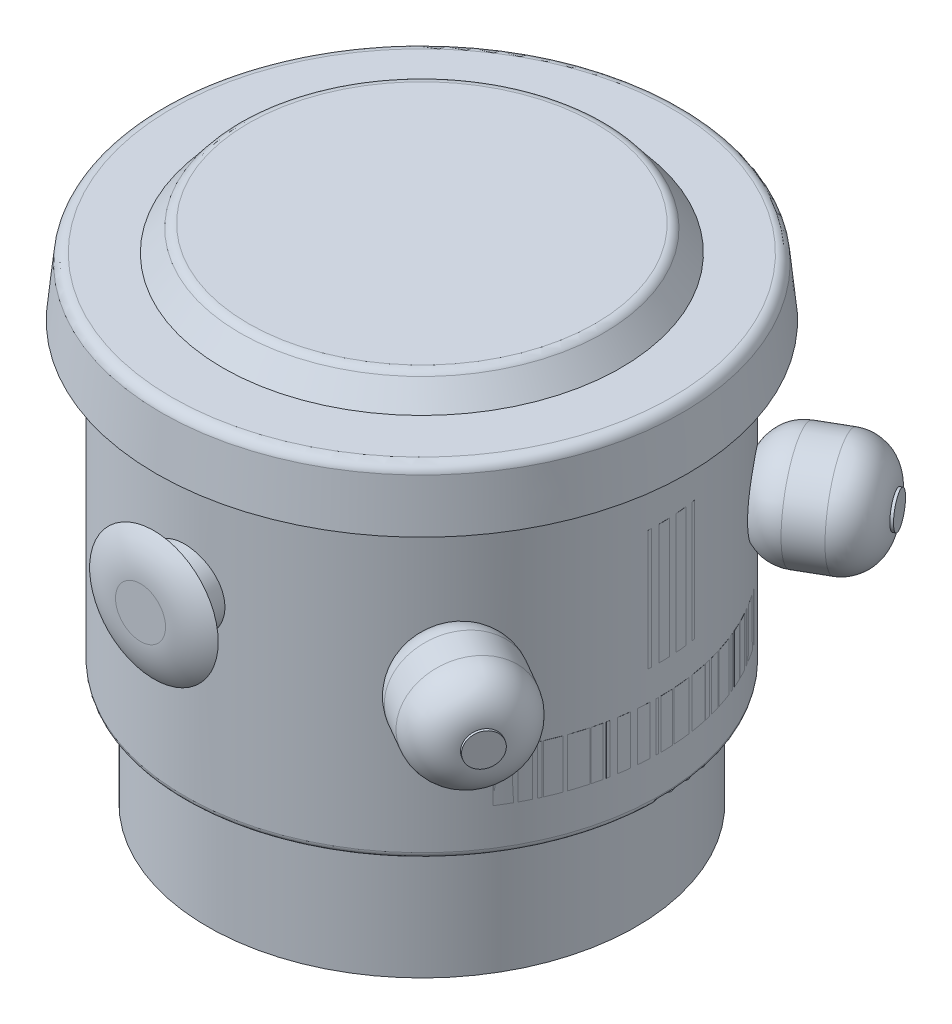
ISO-10303-21;
HEADER;
FILE_DESCRIPTION(('STEP AP214'),'2;1');
FILE_NAME('part.step','',(''),(''),'','','');
FILE_SCHEMA(('AUTOMOTIVE_DESIGN { 1 0 10303 214 1 1 1 1 }'));
ENDSEC;
DATA;
#1=APPLICATION_CONTEXT('core data for automotive mechanical design processes');
#2=APPLICATION_PROTOCOL_DEFINITION('international standard','automotive_design',2000,#1);
#3=PRODUCT_CONTEXT('',#1,'mechanical');
#4=PRODUCT('Part','Part','',(#3));
#5=PRODUCT_RELATED_PRODUCT_CATEGORY('part','',(#4));
#6=PRODUCT_DEFINITION_FORMATION('','',#4);
#7=PRODUCT_DEFINITION_CONTEXT('part definition',#1,'design');
#8=PRODUCT_DEFINITION('design','',#6,#7);
#9=PRODUCT_DEFINITION_SHAPE('','',#8);
#10=(LENGTH_UNIT() NAMED_UNIT(*) SI_UNIT(.MILLI.,.METRE.));
#11=(NAMED_UNIT(*) PLANE_ANGLE_UNIT() SI_UNIT($,.RADIAN.));
#12=(NAMED_UNIT(*) SI_UNIT($,.STERADIAN.) SOLID_ANGLE_UNIT());
#13=UNCERTAINTY_MEASURE_WITH_UNIT(LENGTH_MEASURE(1.E-05),#10,'distance_accuracy_value','');
#14=(GEOMETRIC_REPRESENTATION_CONTEXT(3) GLOBAL_UNCERTAINTY_ASSIGNED_CONTEXT((#13)) GLOBAL_UNIT_ASSIGNED_CONTEXT((#10,
#11,#12)) REPRESENTATION_CONTEXT('',''));
#15=CARTESIAN_POINT('',(0.,0.,0.));
#16=DIRECTION('',(0.,0.,1.));
#17=DIRECTION('',(1.,0.,0.));
#18=AXIS2_PLACEMENT_3D('',#15,#16,#17);
#19=CARTESIAN_POINT('',(10.4734050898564,4.0104303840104,3.04890271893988));
#20=DIRECTION('',(0.,0.,1.));
#21=DIRECTION('',(1.,0.,0.));
#22=AXIS2_PLACEMENT_3D('',#19,#20,#21);
#23=PLANE('',#22);
#24=DIRECTION('',(0.,-1.,0.));
#25=VECTOR('',#24,1.);
#26=CARTESIAN_POINT('',(8.32072744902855,0.,3.04890271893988));
#27=LINE('',#26,#25);
#28=CARTESIAN_POINT('',(8.32072744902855,4.0104303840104,3.04890271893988));
#29=VERTEX_POINT('',#28);
#30=CARTESIAN_POINT('',(8.32072744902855,5.82949175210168,3.04890271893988));
#31=VERTEX_POINT('',#30);
#32=EDGE_CURVE('E87',#29,#31,#27,.F.);
#33=ORIENTED_EDGE('',*,*,#32,.F.);
#34=DIRECTION('',(-1.,0.,0.));
#35=VECTOR('',#34,1.);
#36=CARTESIAN_POINT('',(10.4734050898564,4.0104303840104,3.04890271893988));
#37=LINE('',#36,#35);
#38=CARTESIAN_POINT('',(0.,4.0104303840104,3.04890271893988));
#39=VERTEX_POINT('',#38);
#40=EDGE_CURVE('E41',#29,#39,#37,.T.);
#41=ORIENTED_EDGE('',*,*,#40,.T.);
#42=DIRECTION('',(0.,1.,0.));
#43=VECTOR('',#42,1.);
#44=CARTESIAN_POINT('',(0.,4.0104303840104,3.04890271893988));
#45=LINE('',#44,#43);
#46=CARTESIAN_POINT('',(0.,5.82949175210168,3.04890271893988));
#47=VERTEX_POINT('',#46);
#48=EDGE_CURVE('E85',#39,#47,#45,.T.);
#49=ORIENTED_EDGE('',*,*,#48,.T.);
#50=DIRECTION('',(-1.,0.,0.));
#51=VECTOR('',#50,1.);
#52=CARTESIAN_POINT('',(10.4734050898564,5.82949175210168,3.04890271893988));
#53=LINE('',#52,#51);
#54=EDGE_CURVE('E76',#31,#47,#53,.T.);
#55=ORIENTED_EDGE('',*,*,#54,.F.);
#56=EDGE_LOOP('',(#33,#41,#49,#55));
#57=FACE_BOUND('',#56,.T.);
#58=ADVANCED_FACE('F37',(#57),#23,.F.);
#59=CARTESIAN_POINT('',(10.4734050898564,5.82949175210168,3.04890271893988));
#60=DIRECTION('',(0.,-1.,0.));
#61=DIRECTION('',(0.,0.,-1.));
#62=AXIS2_PLACEMENT_3D('',#59,#60,#61);
#63=PLANE('',#62);
#64=CARTESIAN_POINT('',(0.,5.82949175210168,0.));
#65=DIRECTION('',(0.,-1.,0.));
#66=DIRECTION('',(0.,0.,-1.));
#67=AXIS2_PLACEMENT_3D('',#64,#65,#66);
#68=CIRCLE('',#67,8.86173307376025);
#69=CARTESIAN_POINT('',(8.04001321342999,5.82949175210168,3.7267278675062));
#70=VERTEX_POINT('',#69);
#71=EDGE_CURVE('E46',#31,#70,#68,.T.);
#72=ORIENTED_EDGE('',*,*,#71,.F.);
#73=ORIENTED_EDGE('',*,*,#54,.T.);
#74=DIRECTION('',(0.,0.,1.));
#75=VECTOR('',#74,1.);
#76=CARTESIAN_POINT('',(0.,5.82949175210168,3.04890271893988));
#77=LINE('',#76,#75);
#78=CARTESIAN_POINT('',(0.,5.82949175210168,3.7267278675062));
#79=VERTEX_POINT('',#78);
#80=EDGE_CURVE('E97',#47,#79,#77,.T.);
#81=ORIENTED_EDGE('',*,*,#80,.T.);
#82=DIRECTION('',(-1.,0.,0.));
#83=VECTOR('',#82,1.);
#84=CARTESIAN_POINT('',(10.4734050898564,5.82949175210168,3.7267278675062));
#85=LINE('',#84,#83);
#86=EDGE_CURVE('E106',#70,#79,#85,.T.);
#87=ORIENTED_EDGE('',*,*,#86,.F.);
#88=EDGE_LOOP('',(#72,#73,#81,#87));
#89=FACE_BOUND('',#88,.T.);
#90=ADVANCED_FACE('F110',(#89),#63,.F.);
#91=CARTESIAN_POINT('',(10.4734050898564,4.0104303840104,3.7267278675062));
#92=DIRECTION('',(0.,0.,-1.));
#93=DIRECTION('',(-1.,0.,0.));
#94=AXIS2_PLACEMENT_3D('',#91,#92,#93);
#95=PLANE('',#94);
#96=DIRECTION('',(0.,-1.,0.));
#97=VECTOR('',#96,1.);
#98=CARTESIAN_POINT('',(8.04001321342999,0.,3.7267278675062));
#99=LINE('',#98,#97);
#100=CARTESIAN_POINT('',(8.04001321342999,4.0104303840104,3.7267278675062));
#101=VERTEX_POINT('',#100);
#102=EDGE_CURVE('E12',#70,#101,#99,.T.);
#103=ORIENTED_EDGE('',*,*,#102,.F.);
#104=ORIENTED_EDGE('',*,*,#86,.T.);
#105=DIRECTION('',(0.,-1.,0.));
#106=VECTOR('',#105,1.);
#107=CARTESIAN_POINT('',(0.,4.0104303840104,3.7267278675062));
#108=LINE('',#107,#106);
#109=CARTESIAN_POINT('',(0.,4.0104303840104,3.7267278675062));
#110=VERTEX_POINT('',#109);
#111=EDGE_CURVE('E107',#79,#110,#108,.T.);
#112=ORIENTED_EDGE('',*,*,#111,.T.);
#113=DIRECTION('',(-1.,0.,0.));
#114=VECTOR('',#113,1.);
#115=CARTESIAN_POINT('',(10.4734050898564,4.0104303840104,3.7267278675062));
#116=LINE('',#115,#114);
#117=EDGE_CURVE('E59',#101,#110,#116,.T.);
#118=ORIENTED_EDGE('',*,*,#117,.F.);
#119=EDGE_LOOP('',(#103,#104,#112,#118));
#120=FACE_BOUND('',#119,.T.);
#121=ADVANCED_FACE('F109',(#120),#95,.F.);
#122=CARTESIAN_POINT('',(10.4734050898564,4.0104303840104,3.04890271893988));
#123=DIRECTION('',(0.,1.,0.));
#124=DIRECTION('',(0.,0.,1.));
#125=AXIS2_PLACEMENT_3D('',#122,#123,#124);
#126=PLANE('',#125);
#127=CARTESIAN_POINT('',(0.,4.0104303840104,0.));
#128=DIRECTION('',(0.,1.,0.));
#129=DIRECTION('',(0.,0.,1.));
#130=AXIS2_PLACEMENT_3D('',#127,#128,#129);
#131=CIRCLE('',#130,8.86173307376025);
#132=EDGE_CURVE('E94',#101,#29,#131,.T.);
#133=ORIENTED_EDGE('',*,*,#132,.F.);
#134=ORIENTED_EDGE('',*,*,#117,.T.);
#135=DIRECTION('',(0.,0.,-1.));
#136=VECTOR('',#135,1.);
#137=CARTESIAN_POINT('',(0.,4.0104303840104,3.04890271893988));
#138=LINE('',#137,#136);
#139=EDGE_CURVE('E90',#110,#39,#138,.T.);
#140=ORIENTED_EDGE('',*,*,#139,.T.);
#141=ORIENTED_EDGE('',*,*,#40,.F.);
#142=EDGE_LOOP('',(#133,#134,#140,#141));
#143=FACE_BOUND('',#142,.T.);
#144=ADVANCED_FACE('F91',(#143),#126,.F.);
#145=CARTESIAN_POINT('',(0.,5.82949175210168,3.04890271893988));
#146=DIRECTION('',(1.,0.,0.));
#147=DIRECTION('',(0.,0.,-1.));
#148=AXIS2_PLACEMENT_3D('',#145,#146,#147);
#149=PLANE('',#148);
#150=ORIENTED_EDGE('',*,*,#48,.F.);
#151=ORIENTED_EDGE('',*,*,#139,.F.);
#152=ORIENTED_EDGE('',*,*,#111,.F.);
#153=ORIENTED_EDGE('',*,*,#80,.F.);
#154=EDGE_LOOP('',(#150,#151,#152,#153));
#155=FACE_BOUND('',#154,.T.);
#156=ADVANCED_FACE('F96',(#155),#149,.F.);
#157=CARTESIAN_POINT('',(0.,0.,0.));
#158=DIRECTION('',(0.,-1.,0.));
#159=DIRECTION('',(0.,0.,-1.));
#160=AXIS2_PLACEMENT_3D('',#157,#158,#159);
#161=CYLINDRICAL_SURFACE('',#160,8.86173307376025);
#162=ORIENTED_EDGE('',*,*,#132,.T.);
#163=ORIENTED_EDGE('',*,*,#32,.T.);
#164=ORIENTED_EDGE('',*,*,#71,.T.);
#165=ORIENTED_EDGE('',*,*,#102,.T.);
#166=EDGE_LOOP('',(#162,#163,#164,#165));
#167=FACE_BOUND('',#166,.T.);
#168=ADVANCED_FACE('F39',(#167),#161,.T.);
#169=CLOSED_SHELL('',(#58,#90,#121,#144,#156,#168));
#170=MANIFOLD_SOLID_BREP('B2',#169);
#171=CARTESIAN_POINT('',(10.4734050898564,5.82949175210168,1.89383333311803));
#172=DIRECTION('',(0.,0.,1.));
#173=DIRECTION('',(0.,-1.,0.));
#174=AXIS2_PLACEMENT_3D('',#171,#172,#173);
#175=PLANE('',#174);
#176=DIRECTION('',(0.,-1.,0.));
#177=VECTOR('',#176,1.);
#178=CARTESIAN_POINT('',(8.65700342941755,0.,1.89383333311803));
#179=LINE('',#178,#177);
#180=CARTESIAN_POINT('',(8.65700342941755,4.0104303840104,1.89383333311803));
#181=VERTEX_POINT('',#180);
#182=CARTESIAN_POINT('',(8.65700342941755,5.82949175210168,1.89383333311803));
#183=VERTEX_POINT('',#182);
#184=EDGE_CURVE('E208',#181,#183,#179,.F.);
#185=ORIENTED_EDGE('',*,*,#184,.F.);
#186=DIRECTION('',(-1.,0.,0.));
#187=VECTOR('',#186,1.);
#188=CARTESIAN_POINT('',(10.4734050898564,4.0104303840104,1.89383333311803));
#189=LINE('',#188,#187);
#190=CARTESIAN_POINT('',(0.,4.0104303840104,1.89383333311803));
#191=VERTEX_POINT('',#190);
#192=EDGE_CURVE('E162',#181,#191,#189,.T.);
#193=ORIENTED_EDGE('',*,*,#192,.T.);
#194=DIRECTION('',(0.,1.,0.));
#195=VECTOR('',#194,1.);
#196=CARTESIAN_POINT('',(0.,5.82949175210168,1.89383333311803));
#197=LINE('',#196,#195);
#198=CARTESIAN_POINT('',(0.,5.82949175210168,1.89383333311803));
#199=VERTEX_POINT('',#198);
#200=EDGE_CURVE('E206',#191,#199,#197,.T.);
#201=ORIENTED_EDGE('',*,*,#200,.T.);
#202=DIRECTION('',(-1.,0.,0.));
#203=VECTOR('',#202,1.);
#204=CARTESIAN_POINT('',(10.4734050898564,5.82949175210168,1.89383333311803));
#205=LINE('',#204,#203);
#206=EDGE_CURVE('E197',#183,#199,#205,.T.);
#207=ORIENTED_EDGE('',*,*,#206,.F.);
#208=EDGE_LOOP('',(#185,#193,#201,#207));
#209=FACE_BOUND('',#208,.T.);
#210=ADVANCED_FACE('F158',(#209),#175,.F.);
#211=CARTESIAN_POINT('',(10.4734050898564,5.82949175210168,1.89383333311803));
#212=DIRECTION('',(0.,-1.,0.));
#213=DIRECTION('',(0.,0.,-1.));
#214=AXIS2_PLACEMENT_3D('',#211,#212,#213);
#215=PLANE('',#214);
#216=CARTESIAN_POINT('',(0.,5.82949175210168,0.));
#217=DIRECTION('',(0.,-1.,0.));
#218=DIRECTION('',(0.,0.,-1.));
#219=AXIS2_PLACEMENT_3D('',#216,#217,#218);
#220=CIRCLE('',#219,8.86173307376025);
#221=CARTESIAN_POINT('',(8.3647300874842,5.82949175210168,2.92602181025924));
#222=VERTEX_POINT('',#221);
#223=EDGE_CURVE('E167',#183,#222,#220,.T.);
#224=ORIENTED_EDGE('',*,*,#223,.F.);
#225=ORIENTED_EDGE('',*,*,#206,.T.);
#226=DIRECTION('',(0.,0.,1.));
#227=VECTOR('',#226,1.);
#228=CARTESIAN_POINT('',(0.,5.82949175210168,1.89383333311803));
#229=LINE('',#228,#227);
#230=CARTESIAN_POINT('',(0.,5.82949175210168,2.92602181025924));
#231=VERTEX_POINT('',#230);
#232=EDGE_CURVE('E218',#199,#231,#229,.T.);
#233=ORIENTED_EDGE('',*,*,#232,.T.);
#234=DIRECTION('',(-1.,0.,0.));
#235=VECTOR('',#234,1.);
#236=CARTESIAN_POINT('',(10.4734050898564,5.82949175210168,2.92602181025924));
#237=LINE('',#236,#235);
#238=EDGE_CURVE('E227',#222,#231,#237,.T.);
#239=ORIENTED_EDGE('',*,*,#238,.F.);
#240=EDGE_LOOP('',(#224,#225,#233,#239));
#241=FACE_BOUND('',#240,.T.);
#242=ADVANCED_FACE('F231',(#241),#215,.F.);
#243=CARTESIAN_POINT('',(10.4734050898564,5.82949175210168,2.92602181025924));
#244=DIRECTION('',(0.,0.,-1.));
#245=DIRECTION('',(-1.,0.,0.));
#246=AXIS2_PLACEMENT_3D('',#243,#244,#245);
#247=PLANE('',#246);
#248=DIRECTION('',(0.,-1.,0.));
#249=VECTOR('',#248,1.);
#250=CARTESIAN_POINT('',(8.3647300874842,0.,2.92602181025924));
#251=LINE('',#250,#249);
#252=CARTESIAN_POINT('',(8.3647300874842,4.0104303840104,2.92602181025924));
#253=VERTEX_POINT('',#252);
#254=EDGE_CURVE('E35',#222,#253,#251,.T.);
#255=ORIENTED_EDGE('',*,*,#254,.F.);
#256=ORIENTED_EDGE('',*,*,#238,.T.);
#257=DIRECTION('',(0.,-1.,0.));
#258=VECTOR('',#257,1.);
#259=CARTESIAN_POINT('',(0.,5.82949175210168,2.92602181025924));
#260=LINE('',#259,#258);
#261=CARTESIAN_POINT('',(0.,4.0104303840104,2.92602181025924));
#262=VERTEX_POINT('',#261);
#263=EDGE_CURVE('E228',#231,#262,#260,.T.);
#264=ORIENTED_EDGE('',*,*,#263,.T.);
#265=DIRECTION('',(-1.,0.,0.));
#266=VECTOR('',#265,1.);
#267=CARTESIAN_POINT('',(10.4734050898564,4.0104303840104,2.92602181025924));
#268=LINE('',#267,#266);
#269=EDGE_CURVE('E180',#253,#262,#268,.T.);
#270=ORIENTED_EDGE('',*,*,#269,.F.);
#271=EDGE_LOOP('',(#255,#256,#264,#270));
#272=FACE_BOUND('',#271,.T.);
#273=ADVANCED_FACE('F230',(#272),#247,.F.);
#274=CARTESIAN_POINT('',(10.4734050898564,4.0104303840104,1.89383333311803));
#275=DIRECTION('',(0.,1.,0.));
#276=DIRECTION('',(0.,0.,1.));
#277=AXIS2_PLACEMENT_3D('',#274,#275,#276);
#278=PLANE('',#277);
#279=CARTESIAN_POINT('',(0.,4.0104303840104,0.));
#280=DIRECTION('',(0.,1.,0.));
#281=DIRECTION('',(0.,0.,1.));
#282=AXIS2_PLACEMENT_3D('',#279,#280,#281);
#283=CIRCLE('',#282,8.86173307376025);
#284=EDGE_CURVE('E215',#253,#181,#283,.T.);
#285=ORIENTED_EDGE('',*,*,#284,.F.);
#286=ORIENTED_EDGE('',*,*,#269,.T.);
#287=DIRECTION('',(0.,0.,-1.));
#288=VECTOR('',#287,1.);
#289=CARTESIAN_POINT('',(0.,4.0104303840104,1.89383333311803));
#290=LINE('',#289,#288);
#291=EDGE_CURVE('E211',#262,#191,#290,.T.);
#292=ORIENTED_EDGE('',*,*,#291,.T.);
#293=ORIENTED_EDGE('',*,*,#192,.F.);
#294=EDGE_LOOP('',(#285,#286,#292,#293));
#295=FACE_BOUND('',#294,.T.);
#296=ADVANCED_FACE('F212',(#295),#278,.F.);
#297=CARTESIAN_POINT('',(0.,4.0104303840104,1.89383333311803));
#298=DIRECTION('',(-1.,0.,0.));
#299=DIRECTION('',(0.,0.,1.));
#300=AXIS2_PLACEMENT_3D('',#297,#298,#299);
#301=PLANE('',#300);
#302=ORIENTED_EDGE('',*,*,#200,.F.);
#303=ORIENTED_EDGE('',*,*,#291,.F.);
#304=ORIENTED_EDGE('',*,*,#263,.F.);
#305=ORIENTED_EDGE('',*,*,#232,.F.);
#306=EDGE_LOOP('',(#302,#303,#304,#305));
#307=FACE_BOUND('',#306,.T.);
#308=ADVANCED_FACE('F217',(#307),#301,.T.);
#309=CARTESIAN_POINT('',(0.,0.,0.));
#310=DIRECTION('',(0.,-1.,0.));
#311=DIRECTION('',(0.,0.,-1.));
#312=AXIS2_PLACEMENT_3D('',#309,#310,#311);
#313=CYLINDRICAL_SURFACE('',#312,8.86173307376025);
#314=ORIENTED_EDGE('',*,*,#284,.T.);
#315=ORIENTED_EDGE('',*,*,#184,.T.);
#316=ORIENTED_EDGE('',*,*,#223,.T.);
#317=ORIENTED_EDGE('',*,*,#254,.T.);
#318=EDGE_LOOP('',(#314,#315,#316,#317));
#319=FACE_BOUND('',#318,.T.);
#320=ADVANCED_FACE('F160',(#319),#313,.T.);
#321=CLOSED_SHELL('',(#210,#242,#273,#296,#308,#320));
#322=MANIFOLD_SOLID_BREP('B6',#321);
#323=CARTESIAN_POINT('',(10.4734050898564,4.0104303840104,0.0332724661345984));
#324=DIRECTION('',(0.,0.,1.));
#325=DIRECTION('',(1.,0.,0.));
#326=AXIS2_PLACEMENT_3D('',#323,#324,#325);
#327=PLANE('',#326);
#328=DIRECTION('',(0.,-1.,0.));
#329=VECTOR('',#328,1.);
#330=CARTESIAN_POINT('',(8.86167061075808,0.,0.0332724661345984));
#331=LINE('',#330,#329);
#332=CARTESIAN_POINT('',(8.86167061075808,4.0104303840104,0.0332724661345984));
#333=VERTEX_POINT('',#332);
#334=CARTESIAN_POINT('',(8.86167061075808,5.82949175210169,0.0332724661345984));
#335=VERTEX_POINT('',#334);
#336=EDGE_CURVE('E329',#333,#335,#331,.F.);
#337=ORIENTED_EDGE('',*,*,#336,.F.);
#338=DIRECTION('',(-1.,0.,0.));
#339=VECTOR('',#338,1.);
#340=CARTESIAN_POINT('',(10.4734050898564,4.0104303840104,0.0332724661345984));
#341=LINE('',#340,#339);
#342=CARTESIAN_POINT('',(0.,4.0104303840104,0.0332724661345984));
#343=VERTEX_POINT('',#342);
#344=EDGE_CURVE('E283',#333,#343,#341,.T.);
#345=ORIENTED_EDGE('',*,*,#344,.T.);
#346=DIRECTION('',(0.,1.,0.));
#347=VECTOR('',#346,1.);
#348=CARTESIAN_POINT('',(0.,4.0104303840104,0.0332724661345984));
#349=LINE('',#348,#347);
#350=CARTESIAN_POINT('',(0.,5.82949175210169,0.0332724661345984));
#351=VERTEX_POINT('',#350);
#352=EDGE_CURVE('E327',#343,#351,#349,.T.);
#353=ORIENTED_EDGE('',*,*,#352,.T.);
#354=DIRECTION('',(-1.,0.,0.));
#355=VECTOR('',#354,1.);
#356=CARTESIAN_POINT('',(10.4734050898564,5.82949175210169,0.0332724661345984));
#357=LINE('',#356,#355);
#358=EDGE_CURVE('E318',#335,#351,#357,.T.);
#359=ORIENTED_EDGE('',*,*,#358,.F.);
#360=EDGE_LOOP('',(#337,#345,#353,#359));
#361=FACE_BOUND('',#360,.T.);
#362=ADVANCED_FACE('F279',(#361),#327,.F.);
#363=CARTESIAN_POINT('',(10.4734050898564,5.82949175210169,0.0332724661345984));
#364=DIRECTION('',(0.,-1.,0.));
#365=DIRECTION('',(0.,0.,-1.));
#366=AXIS2_PLACEMENT_3D('',#363,#364,#365);
#367=PLANE('',#366);
#368=CARTESIAN_POINT('',(0.,5.82949175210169,0.));
#369=DIRECTION('',(0.,-1.,0.));
#370=DIRECTION('',(0.,0.,-1.));
#371=AXIS2_PLACEMENT_3D('',#368,#369,#370);
#372=CIRCLE('',#371,8.86173307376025);
#373=CARTESIAN_POINT('',(8.67779385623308,5.82949175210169,1.79616448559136));
#374=VERTEX_POINT('',#373);
#375=EDGE_CURVE('E288',#335,#374,#372,.T.);
#376=ORIENTED_EDGE('',*,*,#375,.F.);
#377=ORIENTED_EDGE('',*,*,#358,.T.);
#378=DIRECTION('',(0.,0.,1.));
#379=VECTOR('',#378,1.);
#380=CARTESIAN_POINT('',(0.,5.82949175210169,0.0332724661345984));
#381=LINE('',#380,#379);
#382=CARTESIAN_POINT('',(0.,5.82949175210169,1.79616448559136));
#383=VERTEX_POINT('',#382);
#384=EDGE_CURVE('E339',#351,#383,#381,.T.);
#385=ORIENTED_EDGE('',*,*,#384,.T.);
#386=DIRECTION('',(-1.,0.,0.));
#387=VECTOR('',#386,1.);
#388=CARTESIAN_POINT('',(10.4734050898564,5.82949175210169,1.79616448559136));
#389=LINE('',#388,#387);
#390=EDGE_CURVE('E348',#374,#383,#389,.T.);
#391=ORIENTED_EDGE('',*,*,#390,.F.);
#392=EDGE_LOOP('',(#376,#377,#385,#391));
#393=FACE_BOUND('',#392,.T.);
#394=ADVANCED_FACE('F352',(#393),#367,.F.);
#395=CARTESIAN_POINT('',(10.4734050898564,4.0104303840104,1.79616448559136));
#396=DIRECTION('',(0.,0.,-1.));
#397=DIRECTION('',(-1.,0.,0.));
#398=AXIS2_PLACEMENT_3D('',#395,#396,#397);
#399=PLANE('',#398);
#400=DIRECTION('',(0.,-1.,0.));
#401=VECTOR('',#400,1.);
#402=CARTESIAN_POINT('',(8.67779385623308,0.,1.79616448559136));
#403=LINE('',#402,#401);
#404=CARTESIAN_POINT('',(8.67779385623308,4.0104303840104,1.79616448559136));
#405=VERTEX_POINT('',#404);
#406=EDGE_CURVE('E156',#374,#405,#403,.T.);
#407=ORIENTED_EDGE('',*,*,#406,.F.);
#408=ORIENTED_EDGE('',*,*,#390,.T.);
#409=DIRECTION('',(0.,-1.,0.));
#410=VECTOR('',#409,1.);
#411=CARTESIAN_POINT('',(0.,4.0104303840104,1.79616448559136));
#412=LINE('',#411,#410);
#413=CARTESIAN_POINT('',(0.,4.0104303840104,1.79616448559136));
#414=VERTEX_POINT('',#413);
#415=EDGE_CURVE('E349',#383,#414,#412,.T.);
#416=ORIENTED_EDGE('',*,*,#415,.T.);
#417=DIRECTION('',(-1.,0.,0.));
#418=VECTOR('',#417,1.);
#419=CARTESIAN_POINT('',(10.4734050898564,4.0104303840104,1.79616448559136));
#420=LINE('',#419,#418);
#421=EDGE_CURVE('E301',#405,#414,#420,.T.);
#422=ORIENTED_EDGE('',*,*,#421,.F.);
#423=EDGE_LOOP('',(#407,#408,#416,#422));
#424=FACE_BOUND('',#423,.T.);
#425=ADVANCED_FACE('F351',(#424),#399,.F.);
#426=CARTESIAN_POINT('',(10.4734050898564,4.0104303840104,0.0332724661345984));
#427=DIRECTION('',(0.,1.,0.));
#428=DIRECTION('',(0.,0.,1.));
#429=AXIS2_PLACEMENT_3D('',#426,#427,#428);
#430=PLANE('',#429);
#431=CARTESIAN_POINT('',(0.,4.0104303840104,0.));
#432=DIRECTION('',(0.,1.,0.));
#433=DIRECTION('',(0.,0.,1.));
#434=AXIS2_PLACEMENT_3D('',#431,#432,#433);
#435=CIRCLE('',#434,8.86173307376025);
#436=EDGE_CURVE('E336',#405,#333,#435,.T.);
#437=ORIENTED_EDGE('',*,*,#436,.F.);
#438=ORIENTED_EDGE('',*,*,#421,.T.);
#439=DIRECTION('',(0.,0.,-1.));
#440=VECTOR('',#439,1.);
#441=CARTESIAN_POINT('',(0.,4.0104303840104,0.0332724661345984));
#442=LINE('',#441,#440);
#443=EDGE_CURVE('E332',#414,#343,#442,.T.);
#444=ORIENTED_EDGE('',*,*,#443,.T.);
#445=ORIENTED_EDGE('',*,*,#344,.F.);
#446=EDGE_LOOP('',(#437,#438,#444,#445));
#447=FACE_BOUND('',#446,.T.);
#448=ADVANCED_FACE('F333',(#447),#430,.F.);
#449=CARTESIAN_POINT('',(0.,5.82949175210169,0.0332724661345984));
#450=DIRECTION('',(1.,0.,0.));
#451=DIRECTION('',(0.,0.,-1.));
#452=AXIS2_PLACEMENT_3D('',#449,#450,#451);
#453=PLANE('',#452);
#454=ORIENTED_EDGE('',*,*,#352,.F.);
#455=ORIENTED_EDGE('',*,*,#443,.F.);
#456=ORIENTED_EDGE('',*,*,#415,.F.);
#457=ORIENTED_EDGE('',*,*,#384,.F.);
#458=EDGE_LOOP('',(#454,#455,#456,#457));
#459=FACE_BOUND('',#458,.T.);
#460=ADVANCED_FACE('F338',(#459),#453,.F.);
#461=CARTESIAN_POINT('',(0.,0.,0.));
#462=DIRECTION('',(0.,-1.,0.));
#463=DIRECTION('',(0.,0.,-1.));
#464=AXIS2_PLACEMENT_3D('',#461,#462,#463);
#465=CYLINDRICAL_SURFACE('',#464,8.86173307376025);
#466=ORIENTED_EDGE('',*,*,#436,.T.);
#467=ORIENTED_EDGE('',*,*,#336,.T.);
#468=ORIENTED_EDGE('',*,*,#375,.T.);
#469=ORIENTED_EDGE('',*,*,#406,.T.);
#470=EDGE_LOOP('',(#466,#467,#468,#469));
#471=FACE_BOUND('',#470,.T.);
#472=ADVANCED_FACE('F281',(#471),#465,.T.);
#473=CLOSED_SHELL('',(#362,#394,#425,#448,#460,#472));
#474=MANIFOLD_SOLID_BREP('B29',#473);
#475=CARTESIAN_POINT('',(10.4734050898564,4.0104303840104,-1.1978793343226));
#476=DIRECTION('',(0.,0.,1.));
#477=DIRECTION('',(1.,0.,0.));
#478=AXIS2_PLACEMENT_3D('',#475,#476,#477);
#479=PLANE('',#478);
#480=DIRECTION('',(0.,-1.,0.));
#481=VECTOR('',#480,1.);
#482=CARTESIAN_POINT('',(8.78039852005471,0.,-1.1978793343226));
#483=LINE('',#482,#481);
#484=CARTESIAN_POINT('',(8.78039852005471,4.0104303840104,-1.1978793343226));
#485=VERTEX_POINT('',#484);
#486=CARTESIAN_POINT('',(8.78039852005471,5.82949175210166,-1.1978793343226));
#487=VERTEX_POINT('',#486);
#488=EDGE_CURVE('E450',#485,#487,#483,.F.);
#489=ORIENTED_EDGE('',*,*,#488,.F.);
#490=DIRECTION('',(-1.,0.,0.));
#491=VECTOR('',#490,1.);
#492=CARTESIAN_POINT('',(10.4734050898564,4.0104303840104,-1.1978793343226));
#493=LINE('',#492,#491);
#494=CARTESIAN_POINT('',(0.,4.0104303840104,-1.1978793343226));
#495=VERTEX_POINT('',#494);
#496=EDGE_CURVE('E404',#485,#495,#493,.T.);
#497=ORIENTED_EDGE('',*,*,#496,.T.);
#498=DIRECTION('',(0.,1.,0.));
#499=VECTOR('',#498,1.);
#500=CARTESIAN_POINT('',(0.,4.0104303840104,-1.1978793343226));
#501=LINE('',#500,#499);
#502=CARTESIAN_POINT('',(0.,5.82949175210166,-1.1978793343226));
#503=VERTEX_POINT('',#502);
#504=EDGE_CURVE('E448',#495,#503,#501,.T.);
#505=ORIENTED_EDGE('',*,*,#504,.T.);
#506=DIRECTION('',(-1.,0.,0.));
#507=VECTOR('',#506,1.);
#508=CARTESIAN_POINT('',(10.4734050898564,5.82949175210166,-1.1978793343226));
#509=LINE('',#508,#507);
#510=EDGE_CURVE('E439',#487,#503,#509,.T.);
#511=ORIENTED_EDGE('',*,*,#510,.F.);
#512=EDGE_LOOP('',(#489,#497,#505,#511));
#513=FACE_BOUND('',#512,.T.);
#514=ADVANCED_FACE('F400',(#513),#479,.F.);
#515=CARTESIAN_POINT('',(10.4734050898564,5.82949175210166,-1.1978793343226));
#516=DIRECTION('',(0.,-1.,0.));
#517=DIRECTION('',(0.,0.,-1.));
#518=AXIS2_PLACEMENT_3D('',#515,#516,#517);
#519=PLANE('',#518);
#520=CARTESIAN_POINT('',(0.,5.82949175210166,0.));
#521=DIRECTION('',(0.,-1.,0.));
#522=DIRECTION('',(0.,0.,-1.));
#523=AXIS2_PLACEMENT_3D('',#520,#521,#522);
#524=CIRCLE('',#523,8.86173307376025);
#525=CARTESIAN_POINT('',(8.86145282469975,5.82949175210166,-0.0704762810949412));
#526=VERTEX_POINT('',#525);
#527=EDGE_CURVE('E409',#487,#526,#524,.T.);
#528=ORIENTED_EDGE('',*,*,#527,.F.);
#529=ORIENTED_EDGE('',*,*,#510,.T.);
#530=DIRECTION('',(0.,0.,1.));
#531=VECTOR('',#530,1.);
#532=CARTESIAN_POINT('',(0.,5.82949175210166,-1.1978793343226));
#533=LINE('',#532,#531);
#534=CARTESIAN_POINT('',(0.,5.82949175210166,-0.0704762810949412));
#535=VERTEX_POINT('',#534);
#536=EDGE_CURVE('E460',#503,#535,#533,.T.);
#537=ORIENTED_EDGE('',*,*,#536,.T.);
#538=DIRECTION('',(-1.,0.,0.));
#539=VECTOR('',#538,1.);
#540=CARTESIAN_POINT('',(10.4734050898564,5.82949175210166,-0.0704762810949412));
#541=LINE('',#540,#539);
#542=EDGE_CURVE('E469',#526,#535,#541,.T.);
#543=ORIENTED_EDGE('',*,*,#542,.F.);
#544=EDGE_LOOP('',(#528,#529,#537,#543));
#545=FACE_BOUND('',#544,.T.);
#546=ADVANCED_FACE('F473',(#545),#519,.F.);
#547=CARTESIAN_POINT('',(10.4734050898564,4.0104303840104,-0.0704762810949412));
#548=DIRECTION('',(0.,0.,-1.));
#549=DIRECTION('',(-1.,0.,0.));
#550=AXIS2_PLACEMENT_3D('',#547,#548,#549);
#551=PLANE('',#550);
#552=DIRECTION('',(0.,-1.,0.));
#553=VECTOR('',#552,1.);
#554=CARTESIAN_POINT('',(8.86145282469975,0.,-0.0704762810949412));
#555=LINE('',#554,#553);
#556=CARTESIAN_POINT('',(8.86145282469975,4.0104303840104,-0.0704762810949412));
#557=VERTEX_POINT('',#556);
#558=EDGE_CURVE('E277',#526,#557,#555,.T.);
#559=ORIENTED_EDGE('',*,*,#558,.F.);
#560=ORIENTED_EDGE('',*,*,#542,.T.);
#561=DIRECTION('',(0.,-1.,0.));
#562=VECTOR('',#561,1.);
#563=CARTESIAN_POINT('',(0.,4.0104303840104,-0.0704762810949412));
#564=LINE('',#563,#562);
#565=CARTESIAN_POINT('',(0.,4.0104303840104,-0.0704762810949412));
#566=VERTEX_POINT('',#565);
#567=EDGE_CURVE('E470',#535,#566,#564,.T.);
#568=ORIENTED_EDGE('',*,*,#567,.T.);
#569=DIRECTION('',(-1.,0.,0.));
#570=VECTOR('',#569,1.);
#571=CARTESIAN_POINT('',(10.4734050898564,4.0104303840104,-0.0704762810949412));
#572=LINE('',#571,#570);
#573=EDGE_CURVE('E422',#557,#566,#572,.T.);
#574=ORIENTED_EDGE('',*,*,#573,.F.);
#575=EDGE_LOOP('',(#559,#560,#568,#574));
#576=FACE_BOUND('',#575,.T.);
#577=ADVANCED_FACE('F472',(#576),#551,.F.);
#578=CARTESIAN_POINT('',(10.4734050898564,4.0104303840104,-1.1978793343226));
#579=DIRECTION('',(0.,1.,0.));
#580=DIRECTION('',(0.,0.,1.));
#581=AXIS2_PLACEMENT_3D('',#578,#579,#580);
#582=PLANE('',#581);
#583=CARTESIAN_POINT('',(0.,4.0104303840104,0.));
#584=DIRECTION('',(0.,1.,0.));
#585=DIRECTION('',(0.,0.,1.));
#586=AXIS2_PLACEMENT_3D('',#583,#584,#585);
#587=CIRCLE('',#586,8.86173307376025);
#588=EDGE_CURVE('E457',#557,#485,#587,.T.);
#589=ORIENTED_EDGE('',*,*,#588,.F.);
#590=ORIENTED_EDGE('',*,*,#573,.T.);
#591=DIRECTION('',(0.,0.,-1.));
#592=VECTOR('',#591,1.);
#593=CARTESIAN_POINT('',(0.,4.0104303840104,-1.1978793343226));
#594=LINE('',#593,#592);
#595=EDGE_CURVE('E453',#566,#495,#594,.T.);
#596=ORIENTED_EDGE('',*,*,#595,.T.);
#597=ORIENTED_EDGE('',*,*,#496,.F.);
#598=EDGE_LOOP('',(#589,#590,#596,#597));
#599=FACE_BOUND('',#598,.T.);
#600=ADVANCED_FACE('F454',(#599),#582,.F.);
#601=CARTESIAN_POINT('',(0.,5.82949175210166,-1.1978793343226));
#602=DIRECTION('',(1.,0.,0.));
#603=DIRECTION('',(0.,0.,-1.));
#604=AXIS2_PLACEMENT_3D('',#601,#602,#603);
#605=PLANE('',#604);
#606=ORIENTED_EDGE('',*,*,#504,.F.);
#607=ORIENTED_EDGE('',*,*,#595,.F.);
#608=ORIENTED_EDGE('',*,*,#567,.F.);
#609=ORIENTED_EDGE('',*,*,#536,.F.);
#610=EDGE_LOOP('',(#606,#607,#608,#609));
#611=FACE_BOUND('',#610,.T.);
#612=ADVANCED_FACE('F459',(#611),#605,.F.);
#613=CARTESIAN_POINT('',(0.,0.,0.));
#614=DIRECTION('',(0.,-1.,0.));
#615=DIRECTION('',(0.,0.,-1.));
#616=AXIS2_PLACEMENT_3D('',#613,#614,#615);
#617=CYLINDRICAL_SURFACE('',#616,8.86173307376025);
#618=ORIENTED_EDGE('',*,*,#588,.T.);
#619=ORIENTED_EDGE('',*,*,#488,.T.);
#620=ORIENTED_EDGE('',*,*,#527,.T.);
#621=ORIENTED_EDGE('',*,*,#558,.T.);
#622=EDGE_LOOP('',(#618,#619,#620,#621));
#623=FACE_BOUND('',#622,.T.);
#624=ADVANCED_FACE('F402',(#623),#617,.T.);
#625=CLOSED_SHELL('',(#514,#546,#577,#600,#612,#624));
#626=MANIFOLD_SOLID_BREP('B150',#625);
#627=CARTESIAN_POINT('',(10.4734050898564,5.82949175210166,-2.13161805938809));
#628=DIRECTION('',(0.,0.,1.));
#629=DIRECTION('',(1.,0.,0.));
#630=AXIS2_PLACEMENT_3D('',#627,#628,#629);
#631=PLANE('',#630);
#632=DIRECTION('',(0.,-1.,0.));
#633=VECTOR('',#632,1.);
#634=CARTESIAN_POINT('',(8.60154157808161,0.,-2.13161805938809));
#635=LINE('',#634,#633);
#636=CARTESIAN_POINT('',(8.60154157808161,4.01043038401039,-2.13161805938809));
#637=VERTEX_POINT('',#636);
#638=CARTESIAN_POINT('',(8.60154157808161,5.82949175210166,-2.13161805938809));
#639=VERTEX_POINT('',#638);
#640=EDGE_CURVE('E571',#637,#639,#635,.F.);
#641=ORIENTED_EDGE('',*,*,#640,.F.);
#642=DIRECTION('',(-1.,0.,0.));
#643=VECTOR('',#642,1.);
#644=CARTESIAN_POINT('',(10.4734050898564,4.01043038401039,-2.13161805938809));
#645=LINE('',#644,#643);
#646=CARTESIAN_POINT('',(0.,4.01043038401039,-2.13161805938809));
#647=VERTEX_POINT('',#646);
#648=EDGE_CURVE('E525',#637,#647,#645,.T.);
#649=ORIENTED_EDGE('',*,*,#648,.T.);
#650=DIRECTION('',(0.,1.,0.));
#651=VECTOR('',#650,1.);
#652=CARTESIAN_POINT('',(0.,5.82949175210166,-2.13161805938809));
#653=LINE('',#652,#651);
#654=CARTESIAN_POINT('',(0.,5.82949175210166,-2.13161805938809));
#655=VERTEX_POINT('',#654);
#656=EDGE_CURVE('E569',#647,#655,#653,.T.);
#657=ORIENTED_EDGE('',*,*,#656,.T.);
#658=DIRECTION('',(-1.,0.,0.));
#659=VECTOR('',#658,1.);
#660=CARTESIAN_POINT('',(10.4734050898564,5.82949175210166,-2.13161805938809));
#661=LINE('',#660,#659);
#662=EDGE_CURVE('E560',#639,#655,#661,.T.);
#663=ORIENTED_EDGE('',*,*,#662,.F.);
#664=EDGE_LOOP('',(#641,#649,#657,#663));
#665=FACE_BOUND('',#664,.T.);
#666=ADVANCED_FACE('F521',(#665),#631,.F.);
#667=CARTESIAN_POINT('',(10.4734050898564,5.82949175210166,-2.13161805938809));
#668=DIRECTION('',(0.,-1.,0.));
#669=DIRECTION('',(0.,0.,-1.));
#670=AXIS2_PLACEMENT_3D('',#667,#668,#669);
#671=PLANE('',#670);
#672=CARTESIAN_POINT('',(0.,5.82949175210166,0.));
#673=DIRECTION('',(0.,-1.,0.));
#674=DIRECTION('',(0.,0.,-1.));
#675=AXIS2_PLACEMENT_3D('',#672,#673,#674);
#676=CIRCLE('',#675,8.86173307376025);
#677=CARTESIAN_POINT('',(8.76146616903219,5.82949175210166,-1.32929441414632));
#678=VERTEX_POINT('',#677);
#679=EDGE_CURVE('E530',#639,#678,#676,.T.);
#680=ORIENTED_EDGE('',*,*,#679,.F.);
#681=ORIENTED_EDGE('',*,*,#662,.T.);
#682=DIRECTION('',(0.,0.,1.));
#683=VECTOR('',#682,1.);
#684=CARTESIAN_POINT('',(0.,5.82949175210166,-2.13161805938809));
#685=LINE('',#684,#683);
#686=CARTESIAN_POINT('',(0.,5.82949175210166,-1.32929441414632));
#687=VERTEX_POINT('',#686);
#688=EDGE_CURVE('E581',#655,#687,#685,.T.);
#689=ORIENTED_EDGE('',*,*,#688,.T.);
#690=DIRECTION('',(-1.,0.,0.));
#691=VECTOR('',#690,1.);
#692=CARTESIAN_POINT('',(10.4734050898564,5.82949175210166,-1.32929441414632));
#693=LINE('',#692,#691);
#694=EDGE_CURVE('E590',#678,#687,#693,.T.);
#695=ORIENTED_EDGE('',*,*,#694,.F.);
#696=EDGE_LOOP('',(#680,#681,#689,#695));
#697=FACE_BOUND('',#696,.T.);
#698=ADVANCED_FACE('F594',(#697),#671,.F.);
#699=CARTESIAN_POINT('',(10.4734050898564,5.82949175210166,-1.32929441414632));
#700=DIRECTION('',(0.,0.,-1.));
#701=DIRECTION('',(0.,1.,0.));
#702=AXIS2_PLACEMENT_3D('',#699,#700,#701);
#703=PLANE('',#702);
#704=DIRECTION('',(0.,-1.,0.));
#705=VECTOR('',#704,1.);
#706=CARTESIAN_POINT('',(8.76146616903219,0.,-1.32929441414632));
#707=LINE('',#706,#705);
#708=CARTESIAN_POINT('',(8.76146616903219,4.01043038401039,-1.32929441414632));
#709=VERTEX_POINT('',#708);
#710=EDGE_CURVE('E398',#678,#709,#707,.T.);
#711=ORIENTED_EDGE('',*,*,#710,.F.);
#712=ORIENTED_EDGE('',*,*,#694,.T.);
#713=DIRECTION('',(0.,-1.,0.));
#714=VECTOR('',#713,1.);
#715=CARTESIAN_POINT('',(0.,5.82949175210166,-1.32929441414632));
#716=LINE('',#715,#714);
#717=CARTESIAN_POINT('',(0.,4.01043038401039,-1.32929441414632));
#718=VERTEX_POINT('',#717);
#719=EDGE_CURVE('E591',#687,#718,#716,.T.);
#720=ORIENTED_EDGE('',*,*,#719,.T.);
#721=DIRECTION('',(-1.,0.,0.));
#722=VECTOR('',#721,1.);
#723=CARTESIAN_POINT('',(10.4734050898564,4.01043038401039,-1.32929441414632));
#724=LINE('',#723,#722);
#725=EDGE_CURVE('E543',#709,#718,#724,.T.);
#726=ORIENTED_EDGE('',*,*,#725,.F.);
#727=EDGE_LOOP('',(#711,#712,#720,#726));
#728=FACE_BOUND('',#727,.T.);
#729=ADVANCED_FACE('F593',(#728),#703,.F.);
#730=CARTESIAN_POINT('',(10.4734050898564,4.01043038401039,-2.13161805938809));
#731=DIRECTION('',(0.,1.,0.));
#732=DIRECTION('',(0.,0.,1.));
#733=AXIS2_PLACEMENT_3D('',#730,#731,#732);
#734=PLANE('',#733);
#735=CARTESIAN_POINT('',(0.,4.01043038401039,0.));
#736=DIRECTION('',(0.,1.,0.));
#737=DIRECTION('',(0.,0.,1.));
#738=AXIS2_PLACEMENT_3D('',#735,#736,#737);
#739=CIRCLE('',#738,8.86173307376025);
#740=EDGE_CURVE('E578',#709,#637,#739,.T.);
#741=ORIENTED_EDGE('',*,*,#740,.F.);
#742=ORIENTED_EDGE('',*,*,#725,.T.);
#743=DIRECTION('',(0.,0.,-1.));
#744=VECTOR('',#743,1.);
#745=CARTESIAN_POINT('',(0.,4.01043038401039,-2.13161805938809));
#746=LINE('',#745,#744);
#747=EDGE_CURVE('E574',#718,#647,#746,.T.);
#748=ORIENTED_EDGE('',*,*,#747,.T.);
#749=ORIENTED_EDGE('',*,*,#648,.F.);
#750=EDGE_LOOP('',(#741,#742,#748,#749));
#751=FACE_BOUND('',#750,.T.);
#752=ADVANCED_FACE('F575',(#751),#734,.F.);
#753=CARTESIAN_POINT('',(0.,4.01043038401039,-2.13161805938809));
#754=DIRECTION('',(-1.,0.,0.));
#755=DIRECTION('',(0.,0.,1.));
#756=AXIS2_PLACEMENT_3D('',#753,#754,#755);
#757=PLANE('',#756);
#758=ORIENTED_EDGE('',*,*,#656,.F.);
#759=ORIENTED_EDGE('',*,*,#747,.F.);
#760=ORIENTED_EDGE('',*,*,#719,.F.);
#761=ORIENTED_EDGE('',*,*,#688,.F.);
#762=EDGE_LOOP('',(#758,#759,#760,#761));
#763=FACE_BOUND('',#762,.T.);
#764=ADVANCED_FACE('F580',(#763),#757,.T.);
#765=CARTESIAN_POINT('',(0.,0.,0.));
#766=DIRECTION('',(0.,-1.,0.));
#767=DIRECTION('',(0.,0.,-1.));
#768=AXIS2_PLACEMENT_3D('',#765,#766,#767);
#769=CYLINDRICAL_SURFACE('',#768,8.86173307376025);
#770=ORIENTED_EDGE('',*,*,#740,.T.);
#771=ORIENTED_EDGE('',*,*,#640,.T.);
#772=ORIENTED_EDGE('',*,*,#679,.T.);
#773=ORIENTED_EDGE('',*,*,#710,.T.);
#774=EDGE_LOOP('',(#770,#771,#772,#773));
#775=FACE_BOUND('',#774,.T.);
#776=ADVANCED_FACE('F523',(#775),#769,.T.);
#777=CLOSED_SHELL('',(#666,#698,#729,#752,#764,#776));
#778=MANIFOLD_SOLID_BREP('B271',#777);
#779=CARTESIAN_POINT('',(10.4734050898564,4.0104303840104,-3.41810252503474));
#780=DIRECTION('',(0.,0.,1.));
#781=DIRECTION('',(1.,0.,0.));
#782=AXIS2_PLACEMENT_3D('',#779,#780,#781);
#783=PLANE('',#782);
#784=DIRECTION('',(0.,-1.,0.));
#785=VECTOR('',#784,1.);
#786=CARTESIAN_POINT('',(8.17599463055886,0.,-3.41810252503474));
#787=LINE('',#786,#785);
#788=CARTESIAN_POINT('',(8.17599463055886,4.0104303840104,-3.41810252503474));
#789=VERTEX_POINT('',#788);
#790=CARTESIAN_POINT('',(8.17599463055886,5.82949175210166,-3.41810252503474));
#791=VERTEX_POINT('',#790);
#792=EDGE_CURVE('E692',#789,#791,#787,.F.);
#793=ORIENTED_EDGE('',*,*,#792,.F.);
#794=DIRECTION('',(-1.,0.,0.));
#795=VECTOR('',#794,1.);
#796=CARTESIAN_POINT('',(10.4734050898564,4.0104303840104,-3.41810252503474));
#797=LINE('',#796,#795);
#798=CARTESIAN_POINT('',(0.,4.0104303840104,-3.41810252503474));
#799=VERTEX_POINT('',#798);
#800=EDGE_CURVE('E646',#789,#799,#797,.T.);
#801=ORIENTED_EDGE('',*,*,#800,.T.);
#802=DIRECTION('',(0.,1.,0.));
#803=VECTOR('',#802,1.);
#804=CARTESIAN_POINT('',(0.,4.0104303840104,-3.41810252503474));
#805=LINE('',#804,#803);
#806=CARTESIAN_POINT('',(0.,5.82949175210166,-3.41810252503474));
#807=VERTEX_POINT('',#806);
#808=EDGE_CURVE('E690',#799,#807,#805,.T.);
#809=ORIENTED_EDGE('',*,*,#808,.T.);
#810=DIRECTION('',(-1.,0.,0.));
#811=VECTOR('',#810,1.);
#812=CARTESIAN_POINT('',(10.4734050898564,5.82949175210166,-3.41810252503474));
#813=LINE('',#812,#811);
#814=EDGE_CURVE('E681',#791,#807,#813,.T.);
#815=ORIENTED_EDGE('',*,*,#814,.F.);
#816=EDGE_LOOP('',(#793,#801,#809,#815));
#817=FACE_BOUND('',#816,.T.);
#818=ADVANCED_FACE('F642',(#817),#783,.F.);
#819=CARTESIAN_POINT('',(10.4734050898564,5.82949175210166,-3.41810252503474));
#820=DIRECTION('',(0.,-1.,0.));
#821=DIRECTION('',(0.,0.,-1.));
#822=AXIS2_PLACEMENT_3D('',#819,#820,#821);
#823=PLANE('',#822);
#824=CARTESIAN_POINT('',(0.,5.82949175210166,0.));
#825=DIRECTION('',(0.,-1.,0.));
#826=DIRECTION('',(0.,0.,-1.));
#827=AXIS2_PLACEMENT_3D('',#824,#825,#826);
#828=CIRCLE('',#827,8.86173307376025);
#829=CARTESIAN_POINT('',(8.57516462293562,5.82949175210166,-2.235366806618));
#830=VERTEX_POINT('',#829);
#831=EDGE_CURVE('E651',#791,#830,#828,.T.);
#832=ORIENTED_EDGE('',*,*,#831,.F.);
#833=ORIENTED_EDGE('',*,*,#814,.T.);
#834=DIRECTION('',(0.,0.,1.));
#835=VECTOR('',#834,1.);
#836=CARTESIAN_POINT('',(0.,5.82949175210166,-3.41810252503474));
#837=LINE('',#836,#835);
#838=CARTESIAN_POINT('',(0.,5.82949175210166,-2.235366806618));
#839=VERTEX_POINT('',#838);
#840=EDGE_CURVE('E702',#807,#839,#837,.T.);
#841=ORIENTED_EDGE('',*,*,#840,.T.);
#842=DIRECTION('',(-1.,0.,0.));
#843=VECTOR('',#842,1.);
#844=CARTESIAN_POINT('',(10.4734050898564,5.82949175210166,-2.235366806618));
#845=LINE('',#844,#843);
#846=EDGE_CURVE('E711',#830,#839,#845,.T.);
#847=ORIENTED_EDGE('',*,*,#846,.F.);
#848=EDGE_LOOP('',(#832,#833,#841,#847));
#849=FACE_BOUND('',#848,.T.);
#850=ADVANCED_FACE('F715',(#849),#823,.F.);
#851=CARTESIAN_POINT('',(10.4734050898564,4.0104303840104,-2.235366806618));
#852=DIRECTION('',(0.,0.,-1.));
#853=DIRECTION('',(-1.,0.,0.));
#854=AXIS2_PLACEMENT_3D('',#851,#852,#853);
#855=PLANE('',#854);
#856=DIRECTION('',(0.,-1.,0.));
#857=VECTOR('',#856,1.);
#858=CARTESIAN_POINT('',(8.57516462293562,0.,-2.235366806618));
#859=LINE('',#858,#857);
#860=CARTESIAN_POINT('',(8.57516462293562,4.0104303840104,-2.235366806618));
#861=VERTEX_POINT('',#860);
#862=EDGE_CURVE('E519',#830,#861,#859,.T.);
#863=ORIENTED_EDGE('',*,*,#862,.F.);
#864=ORIENTED_EDGE('',*,*,#846,.T.);
#865=DIRECTION('',(0.,-1.,0.));
#866=VECTOR('',#865,1.);
#867=CARTESIAN_POINT('',(0.,4.0104303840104,-2.235366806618));
#868=LINE('',#867,#866);
#869=CARTESIAN_POINT('',(0.,4.0104303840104,-2.235366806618));
#870=VERTEX_POINT('',#869);
#871=EDGE_CURVE('E712',#839,#870,#868,.T.);
#872=ORIENTED_EDGE('',*,*,#871,.T.);
#873=DIRECTION('',(-1.,0.,0.));
#874=VECTOR('',#873,1.);
#875=CARTESIAN_POINT('',(10.4734050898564,4.0104303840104,-2.235366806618));
#876=LINE('',#875,#874);
#877=EDGE_CURVE('E664',#861,#870,#876,.T.);
#878=ORIENTED_EDGE('',*,*,#877,.F.);
#879=EDGE_LOOP('',(#863,#864,#872,#878));
#880=FACE_BOUND('',#879,.T.);
#881=ADVANCED_FACE('F714',(#880),#855,.F.);
#882=CARTESIAN_POINT('',(10.4734050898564,4.0104303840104,-3.41810252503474));
#883=DIRECTION('',(0.,1.,0.));
#884=DIRECTION('',(0.,0.,1.));
#885=AXIS2_PLACEMENT_3D('',#882,#883,#884);
#886=PLANE('',#885);
#887=CARTESIAN_POINT('',(0.,4.0104303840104,0.));
#888=DIRECTION('',(0.,1.,0.));
#889=DIRECTION('',(0.,0.,1.));
#890=AXIS2_PLACEMENT_3D('',#887,#888,#889);
#891=CIRCLE('',#890,8.86173307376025);
#892=EDGE_CURVE('E699',#861,#789,#891,.T.);
#893=ORIENTED_EDGE('',*,*,#892,.F.);
#894=ORIENTED_EDGE('',*,*,#877,.T.);
#895=DIRECTION('',(0.,0.,-1.));
#896=VECTOR('',#895,1.);
#897=CARTESIAN_POINT('',(0.,4.0104303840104,-3.41810252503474));
#898=LINE('',#897,#896);
#899=EDGE_CURVE('E695',#870,#799,#898,.T.);
#900=ORIENTED_EDGE('',*,*,#899,.T.);
#901=ORIENTED_EDGE('',*,*,#800,.F.);
#902=EDGE_LOOP('',(#893,#894,#900,#901));
#903=FACE_BOUND('',#902,.T.);
#904=ADVANCED_FACE('F696',(#903),#886,.F.);
#905=CARTESIAN_POINT('',(0.,5.82949175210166,-3.41810252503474));
#906=DIRECTION('',(1.,0.,0.));
#907=DIRECTION('',(0.,0.,-1.));
#908=AXIS2_PLACEMENT_3D('',#905,#906,#907);
#909=PLANE('',#908);
#910=ORIENTED_EDGE('',*,*,#808,.F.);
#911=ORIENTED_EDGE('',*,*,#899,.F.);
#912=ORIENTED_EDGE('',*,*,#871,.F.);
#913=ORIENTED_EDGE('',*,*,#840,.F.);
#914=EDGE_LOOP('',(#910,#911,#912,#913));
#915=FACE_BOUND('',#914,.T.);
#916=ADVANCED_FACE('F701',(#915),#909,.F.);
#917=CARTESIAN_POINT('',(0.,0.,0.));
#918=DIRECTION('',(0.,-1.,0.));
#919=DIRECTION('',(0.,0.,-1.));
#920=AXIS2_PLACEMENT_3D('',#917,#918,#919);
#921=CYLINDRICAL_SURFACE('',#920,8.86173307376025);
#922=ORIENTED_EDGE('',*,*,#892,.T.);
#923=ORIENTED_EDGE('',*,*,#792,.T.);
#924=ORIENTED_EDGE('',*,*,#831,.T.);
#925=ORIENTED_EDGE('',*,*,#862,.T.);
#926=EDGE_LOOP('',(#922,#923,#924,#925));
#927=FACE_BOUND('',#926,.T.);
#928=ADVANCED_FACE('F644',(#927),#921,.T.);
#929=CLOSED_SHELL('',(#818,#850,#881,#904,#916,#928));
#930=MANIFOLD_SOLID_BREP('B392',#929);
#931=CARTESIAN_POINT('',(10.4734050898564,5.84410971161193,-4.4311503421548));
#932=DIRECTION('',(0.,0.,-1.));
#933=DIRECTION('',(-1.,0.,0.));
#934=AXIS2_PLACEMENT_3D('',#931,#932,#933);
#935=PLANE('',#934);
#936=DIRECTION('',(0.,-1.,0.));
#937=VECTOR('',#936,1.);
#938=CARTESIAN_POINT('',(7.67432210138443,0.,-4.4311503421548));
#939=LINE('',#938,#937);
#940=CARTESIAN_POINT('',(7.67432210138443,5.84410971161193,-4.4311503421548));
#941=VERTEX_POINT('',#940);
#942=CARTESIAN_POINT('',(7.67432210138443,4.02504834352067,-4.4311503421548));
#943=VERTEX_POINT('',#942);
#944=EDGE_CURVE('E813',#941,#943,#939,.T.);
#945=ORIENTED_EDGE('',*,*,#944,.F.);
#946=DIRECTION('',(-1.,0.,0.));
#947=VECTOR('',#946,1.);
#948=CARTESIAN_POINT('',(10.4734050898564,5.84410971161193,-4.4311503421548));
#949=LINE('',#948,#947);
#950=CARTESIAN_POINT('',(0.,5.84410971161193,-4.4311503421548));
#951=VERTEX_POINT('',#950);
#952=EDGE_CURVE('E767',#941,#951,#949,.T.);
#953=ORIENTED_EDGE('',*,*,#952,.T.);
#954=DIRECTION('',(0.,-1.,0.));
#955=VECTOR('',#954,1.);
#956=CARTESIAN_POINT('',(0.,5.84410971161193,-4.4311503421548));
#957=LINE('',#956,#955);
#958=CARTESIAN_POINT('',(0.,4.02504834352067,-4.4311503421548));
#959=VERTEX_POINT('',#958);
#960=EDGE_CURVE('E811',#951,#959,#957,.T.);
#961=ORIENTED_EDGE('',*,*,#960,.T.);
#962=DIRECTION('',(-1.,0.,0.));
#963=VECTOR('',#962,1.);
#964=CARTESIAN_POINT('',(10.4734050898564,4.02504834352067,-4.4311503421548));
#965=LINE('',#964,#963);
#966=EDGE_CURVE('E802',#943,#959,#965,.T.);
#967=ORIENTED_EDGE('',*,*,#966,.F.);
#968=EDGE_LOOP('',(#945,#953,#961,#967));
#969=FACE_BOUND('',#968,.T.);
#970=ADVANCED_FACE('F763',(#969),#935,.F.);
#971=CARTESIAN_POINT('',(10.4734050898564,4.02504834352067,-4.4311503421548));
#972=DIRECTION('',(0.,1.,0.));
#973=DIRECTION('',(0.,0.,1.));
#974=AXIS2_PLACEMENT_3D('',#971,#972,#973);
#975=PLANE('',#974);
#976=CARTESIAN_POINT('',(0.,4.02504834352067,0.));
#977=DIRECTION('',(0.,1.,0.));
#978=DIRECTION('',(0.,0.,1.));
#979=AXIS2_PLACEMENT_3D('',#976,#977,#978);
#980=CIRCLE('',#979,8.86173307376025);
#981=CARTESIAN_POINT('',(7.12393866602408,4.02504834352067,-5.27065564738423));
#982=VERTEX_POINT('',#981);
#983=EDGE_CURVE('E772',#943,#982,#980,.T.);
#984=ORIENTED_EDGE('',*,*,#983,.F.);
#985=ORIENTED_EDGE('',*,*,#966,.T.);
#986=DIRECTION('',(0.,0.,-1.));
#987=VECTOR('',#986,1.);
#988=CARTESIAN_POINT('',(0.,4.02504834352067,-4.4311503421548));
#989=LINE('',#988,#987);
#990=CARTESIAN_POINT('',(0.,4.02504834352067,-5.27065564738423));
#991=VERTEX_POINT('',#990);
#992=EDGE_CURVE('E823',#959,#991,#989,.T.);
#993=ORIENTED_EDGE('',*,*,#992,.T.);
#994=DIRECTION('',(-1.,0.,0.));
#995=VECTOR('',#994,1.);
#996=CARTESIAN_POINT('',(10.4734050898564,4.02504834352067,-5.27065564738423));
#997=LINE('',#996,#995);
#998=EDGE_CURVE('E832',#982,#991,#997,.T.);
#999=ORIENTED_EDGE('',*,*,#998,.F.);
#1000=EDGE_LOOP('',(#984,#985,#993,#999));
#1001=FACE_BOUND('',#1000,.T.);
#1002=ADVANCED_FACE('F836',(#1001),#975,.F.);
#1003=CARTESIAN_POINT('',(10.4734050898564,5.84410971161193,-5.27065564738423));
#1004=DIRECTION('',(0.,0.,1.));
#1005=DIRECTION('',(1.,0.,0.));
#1006=AXIS2_PLACEMENT_3D('',#1003,#1004,#1005);
#1007=PLANE('',#1006);
#1008=DIRECTION('',(0.,-1.,0.));
#1009=VECTOR('',#1008,1.);
#1010=CARTESIAN_POINT('',(7.12393866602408,0.,-5.27065564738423));
#1011=LINE('',#1010,#1009);
#1012=CARTESIAN_POINT('',(7.12393866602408,5.84410971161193,-5.27065564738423));
#1013=VERTEX_POINT('',#1012);
#1014=EDGE_CURVE('E640',#982,#1013,#1011,.F.);
#1015=ORIENTED_EDGE('',*,*,#1014,.F.);
#1016=ORIENTED_EDGE('',*,*,#998,.T.);
#1017=DIRECTION('',(0.,1.,0.));
#1018=VECTOR('',#1017,1.);
#1019=CARTESIAN_POINT('',(0.,5.84410971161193,-5.27065564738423));
#1020=LINE('',#1019,#1018);
#1021=CARTESIAN_POINT('',(0.,5.84410971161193,-5.27065564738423));
#1022=VERTEX_POINT('',#1021);
#1023=EDGE_CURVE('E833',#991,#1022,#1020,.T.);
#1024=ORIENTED_EDGE('',*,*,#1023,.T.);
#1025=DIRECTION('',(-1.,0.,0.));
#1026=VECTOR('',#1025,1.);
#1027=CARTESIAN_POINT('',(10.4734050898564,5.84410971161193,-5.27065564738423));
#1028=LINE('',#1027,#1026);
#1029=EDGE_CURVE('E785',#1013,#1022,#1028,.T.);
#1030=ORIENTED_EDGE('',*,*,#1029,.F.);
#1031=EDGE_LOOP('',(#1015,#1016,#1024,#1030));
#1032=FACE_BOUND('',#1031,.T.);
#1033=ADVANCED_FACE('F835',(#1032),#1007,.F.);
#1034=CARTESIAN_POINT('',(10.4734050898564,5.84410971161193,-4.4311503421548));
#1035=DIRECTION('',(0.,-1.,0.));
#1036=DIRECTION('',(0.,0.,-1.));
#1037=AXIS2_PLACEMENT_3D('',#1034,#1035,#1036);
#1038=PLANE('',#1037);
#1039=CARTESIAN_POINT('',(0.,5.84410971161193,0.));
#1040=DIRECTION('',(0.,-1.,0.));
#1041=DIRECTION('',(0.,0.,-1.));
#1042=AXIS2_PLACEMENT_3D('',#1039,#1040,#1041);
#1043=CIRCLE('',#1042,8.86173307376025);
#1044=EDGE_CURVE('E820',#1013,#941,#1043,.T.);
#1045=ORIENTED_EDGE('',*,*,#1044,.F.);
#1046=ORIENTED_EDGE('',*,*,#1029,.T.);
#1047=DIRECTION('',(0.,0.,1.));
#1048=VECTOR('',#1047,1.);
#1049=CARTESIAN_POINT('',(0.,5.84410971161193,-4.4311503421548));
#1050=LINE('',#1049,#1048);
#1051=EDGE_CURVE('E816',#1022,#951,#1050,.T.);
#1052=ORIENTED_EDGE('',*,*,#1051,.T.);
#1053=ORIENTED_EDGE('',*,*,#952,.F.);
#1054=EDGE_LOOP('',(#1045,#1046,#1052,#1053));
#1055=FACE_BOUND('',#1054,.T.);
#1056=ADVANCED_FACE('F817',(#1055),#1038,.F.);
#1057=CARTESIAN_POINT('',(0.,4.02504834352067,-4.4311503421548));
#1058=DIRECTION('',(1.,0.,0.));
#1059=DIRECTION('',(0.,0.,-1.));
#1060=AXIS2_PLACEMENT_3D('',#1057,#1058,#1059);
#1061=PLANE('',#1060);
#1062=ORIENTED_EDGE('',*,*,#960,.F.);
#1063=ORIENTED_EDGE('',*,*,#1051,.F.);
#1064=ORIENTED_EDGE('',*,*,#1023,.F.);
#1065=ORIENTED_EDGE('',*,*,#992,.F.);
#1066=EDGE_LOOP('',(#1062,#1063,#1064,#1065));
#1067=FACE_BOUND('',#1066,.T.);
#1068=ADVANCED_FACE('F822',(#1067),#1061,.F.);
#1069=CARTESIAN_POINT('',(0.,0.,0.));
#1070=DIRECTION('',(0.,-1.,0.));
#1071=DIRECTION('',(0.,0.,-1.));
#1072=AXIS2_PLACEMENT_3D('',#1069,#1070,#1071);
#1073=CYLINDRICAL_SURFACE('',#1072,8.86173307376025);
#1074=ORIENTED_EDGE('',*,*,#1044,.T.);
#1075=ORIENTED_EDGE('',*,*,#944,.T.);
#1076=ORIENTED_EDGE('',*,*,#983,.T.);
#1077=ORIENTED_EDGE('',*,*,#1014,.T.);
#1078=EDGE_LOOP('',(#1074,#1075,#1076,#1077));
#1079=FACE_BOUND('',#1078,.T.);
#1080=ADVANCED_FACE('F765',(#1079),#1073,.T.);
#1081=CLOSED_SHELL('',(#970,#1002,#1033,#1056,#1068,#1080));
#1082=MANIFOLD_SOLID_BREP('B513',#1081);
#1083=CARTESIAN_POINT('',(10.4734050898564,5.82949175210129,-3.53534976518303));
#1084=DIRECTION('',(0.,0.,-1.));
#1085=DIRECTION('',(-1.,0.,0.));
#1086=AXIS2_PLACEMENT_3D('',#1083,#1084,#1085);
#1087=PLANE('',#1086);
#1088=DIRECTION('',(0.,-1.,0.));
#1089=VECTOR('',#1088,1.);
#1090=CARTESIAN_POINT('',(8.12598394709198,0.,-3.53534976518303));
#1091=LINE('',#1090,#1089);
#1092=CARTESIAN_POINT('',(8.12598394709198,5.82949175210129,-3.53534976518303));
#1093=VERTEX_POINT('',#1092);
#1094=CARTESIAN_POINT('',(8.12598394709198,4.01043038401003,-3.53534976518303));
#1095=VERTEX_POINT('',#1094);
#1096=EDGE_CURVE('E934',#1093,#1095,#1091,.T.);
#1097=ORIENTED_EDGE('',*,*,#1096,.F.);
#1098=DIRECTION('',(-1.,0.,0.));
#1099=VECTOR('',#1098,1.);
#1100=CARTESIAN_POINT('',(10.4734050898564,5.82949175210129,-3.53534976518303));
#1101=LINE('',#1100,#1099);
#1102=CARTESIAN_POINT('',(0.,5.82949175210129,-3.53534976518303));
#1103=VERTEX_POINT('',#1102);
#1104=EDGE_CURVE('E888',#1093,#1103,#1101,.T.);
#1105=ORIENTED_EDGE('',*,*,#1104,.T.);
#1106=DIRECTION('',(0.,-1.,0.));
#1107=VECTOR('',#1106,1.);
#1108=CARTESIAN_POINT('',(0.,5.82949175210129,-3.53534976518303));
#1109=LINE('',#1108,#1107);
#1110=CARTESIAN_POINT('',(0.,4.01043038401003,-3.53534976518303));
#1111=VERTEX_POINT('',#1110);
#1112=EDGE_CURVE('E932',#1103,#1111,#1109,.T.);
#1113=ORIENTED_EDGE('',*,*,#1112,.T.);
#1114=DIRECTION('',(-1.,0.,0.));
#1115=VECTOR('',#1114,1.);
#1116=CARTESIAN_POINT('',(10.4734050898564,4.01043038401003,-3.53534976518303));
#1117=LINE('',#1116,#1115);
#1118=EDGE_CURVE('E923',#1095,#1111,#1117,.T.);
#1119=ORIENTED_EDGE('',*,*,#1118,.F.);
#1120=EDGE_LOOP('',(#1097,#1105,#1113,#1119));
#1121=FACE_BOUND('',#1120,.T.);
#1122=ADVANCED_FACE('F884',(#1121),#1087,.F.);
#1123=CARTESIAN_POINT('',(10.4734050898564,4.01043038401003,-3.53534976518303));
#1124=DIRECTION('',(0.,1.,0.));
#1125=DIRECTION('',(0.,0.,1.));
#1126=AXIS2_PLACEMENT_3D('',#1123,#1124,#1125);
#1127=PLANE('',#1126);
#1128=CARTESIAN_POINT('',(0.,4.01043038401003,0.));
#1129=DIRECTION('',(0.,1.,0.));
#1130=DIRECTION('',(0.,0.,1.));
#1131=AXIS2_PLACEMENT_3D('',#1128,#1129,#1130);
#1132=CIRCLE('',#1131,8.86173307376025);
#1133=CARTESIAN_POINT('',(7.74666669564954,4.01043038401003,-4.30342516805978));
#1134=VERTEX_POINT('',#1133);
#1135=EDGE_CURVE('E893',#1095,#1134,#1132,.T.);
#1136=ORIENTED_EDGE('',*,*,#1135,.F.);
#1137=ORIENTED_EDGE('',*,*,#1118,.T.);
#1138=DIRECTION('',(0.,0.,-1.));
#1139=VECTOR('',#1138,1.);
#1140=CARTESIAN_POINT('',(0.,4.01043038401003,-3.53534976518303));
#1141=LINE('',#1140,#1139);
#1142=CARTESIAN_POINT('',(0.,4.01043038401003,-4.30342516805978));
#1143=VERTEX_POINT('',#1142);
#1144=EDGE_CURVE('E944',#1111,#1143,#1141,.T.);
#1145=ORIENTED_EDGE('',*,*,#1144,.T.);
#1146=DIRECTION('',(-1.,0.,0.));
#1147=VECTOR('',#1146,1.);
#1148=CARTESIAN_POINT('',(10.4734050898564,4.01043038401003,-4.30342516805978));
#1149=LINE('',#1148,#1147);
#1150=EDGE_CURVE('E953',#1134,#1143,#1149,.T.);
#1151=ORIENTED_EDGE('',*,*,#1150,.F.);
#1152=EDGE_LOOP('',(#1136,#1137,#1145,#1151));
#1153=FACE_BOUND('',#1152,.T.);
#1154=ADVANCED_FACE('F957',(#1153),#1127,.F.);
#1155=CARTESIAN_POINT('',(10.4734050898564,5.82949175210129,-4.30342516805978));
#1156=DIRECTION('',(0.,0.,1.));
#1157=DIRECTION('',(1.,0.,0.));
#1158=AXIS2_PLACEMENT_3D('',#1155,#1156,#1157);
#1159=PLANE('',#1158);
#1160=DIRECTION('',(0.,-1.,0.));
#1161=VECTOR('',#1160,1.);
#1162=CARTESIAN_POINT('',(7.74666669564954,0.,-4.30342516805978));
#1163=LINE('',#1162,#1161);
#1164=CARTESIAN_POINT('',(7.74666669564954,5.82949175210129,-4.30342516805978));
#1165=VERTEX_POINT('',#1164);
#1166=EDGE_CURVE('E761',#1134,#1165,#1163,.F.);
#1167=ORIENTED_EDGE('',*,*,#1166,.F.);
#1168=ORIENTED_EDGE('',*,*,#1150,.T.);
#1169=DIRECTION('',(0.,1.,0.));
#1170=VECTOR('',#1169,1.);
#1171=CARTESIAN_POINT('',(0.,5.82949175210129,-4.30342516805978));
#1172=LINE('',#1171,#1170);
#1173=CARTESIAN_POINT('',(0.,5.82949175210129,-4.30342516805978));
#1174=VERTEX_POINT('',#1173);
#1175=EDGE_CURVE('E954',#1143,#1174,#1172,.T.);
#1176=ORIENTED_EDGE('',*,*,#1175,.T.);
#1177=DIRECTION('',(-1.,0.,0.));
#1178=VECTOR('',#1177,1.);
#1179=CARTESIAN_POINT('',(10.4734050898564,5.82949175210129,-4.30342516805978));
#1180=LINE('',#1179,#1178);
#1181=EDGE_CURVE('E906',#1165,#1174,#1180,.T.);
#1182=ORIENTED_EDGE('',*,*,#1181,.F.);
#1183=EDGE_LOOP('',(#1167,#1168,#1176,#1182));
#1184=FACE_BOUND('',#1183,.T.);
#1185=ADVANCED_FACE('F956',(#1184),#1159,.F.);
#1186=CARTESIAN_POINT('',(10.4734050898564,5.82949175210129,-3.53534976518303));
#1187=DIRECTION('',(0.,-1.,0.));
#1188=DIRECTION('',(0.,0.,-1.));
#1189=AXIS2_PLACEMENT_3D('',#1186,#1187,#1188);
#1190=PLANE('',#1189);
#1191=CARTESIAN_POINT('',(0.,5.82949175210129,0.));
#1192=DIRECTION('',(0.,-1.,0.));
#1193=DIRECTION('',(0.,0.,-1.));
#1194=AXIS2_PLACEMENT_3D('',#1191,#1192,#1193);
#1195=CIRCLE('',#1194,8.86173307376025);
#1196=EDGE_CURVE('E941',#1165,#1093,#1195,.T.);
#1197=ORIENTED_EDGE('',*,*,#1196,.F.);
#1198=ORIENTED_EDGE('',*,*,#1181,.T.);
#1199=DIRECTION('',(0.,0.,1.));
#1200=VECTOR('',#1199,1.);
#1201=CARTESIAN_POINT('',(0.,5.82949175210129,-3.53534976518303));
#1202=LINE('',#1201,#1200);
#1203=EDGE_CURVE('E937',#1174,#1103,#1202,.T.);
#1204=ORIENTED_EDGE('',*,*,#1203,.T.);
#1205=ORIENTED_EDGE('',*,*,#1104,.F.);
#1206=EDGE_LOOP('',(#1197,#1198,#1204,#1205));
#1207=FACE_BOUND('',#1206,.T.);
#1208=ADVANCED_FACE('F938',(#1207),#1190,.F.);
#1209=CARTESIAN_POINT('',(0.,4.01043038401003,-3.53534976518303));
#1210=DIRECTION('',(1.,0.,0.));
#1211=DIRECTION('',(0.,0.,-1.));
#1212=AXIS2_PLACEMENT_3D('',#1209,#1210,#1211);
#1213=PLANE('',#1212);
#1214=ORIENTED_EDGE('',*,*,#1112,.F.);
#1215=ORIENTED_EDGE('',*,*,#1203,.F.);
#1216=ORIENTED_EDGE('',*,*,#1175,.F.);
#1217=ORIENTED_EDGE('',*,*,#1144,.F.);
#1218=EDGE_LOOP('',(#1214,#1215,#1216,#1217));
#1219=FACE_BOUND('',#1218,.T.);
#1220=ADVANCED_FACE('F943',(#1219),#1213,.F.);
#1221=CARTESIAN_POINT('',(0.,0.,0.));
#1222=DIRECTION('',(0.,-1.,0.));
#1223=DIRECTION('',(0.,0.,-1.));
#1224=AXIS2_PLACEMENT_3D('',#1221,#1222,#1223);
#1225=CYLINDRICAL_SURFACE('',#1224,8.86173307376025);
#1226=ORIENTED_EDGE('',*,*,#1196,.T.);
#1227=ORIENTED_EDGE('',*,*,#1096,.T.);
#1228=ORIENTED_EDGE('',*,*,#1135,.T.);
#1229=ORIENTED_EDGE('',*,*,#1166,.T.);
#1230=EDGE_LOOP('',(#1226,#1227,#1228,#1229));
#1231=FACE_BOUND('',#1230,.T.);
#1232=ADVANCED_FACE('F886',(#1231),#1225,.T.);
#1233=CLOSED_SHELL('',(#1122,#1154,#1185,#1208,#1220,#1232));
#1234=MANIFOLD_SOLID_BREP('B634',#1233);
#1235=CARTESIAN_POINT('',(10.4734050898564,5.82949175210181,3.85582374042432));
#1236=DIRECTION('',(0.,0.,1.));
#1237=DIRECTION('',(0.,-1.,0.));
#1238=AXIS2_PLACEMENT_3D('',#1235,#1236,#1237);
#1239=PLANE('',#1238);
#1240=DIRECTION('',(0.,-1.,0.));
#1241=VECTOR('',#1240,1.);
#1242=CARTESIAN_POINT('',(7.97890571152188,0.,3.85582374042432));
#1243=LINE('',#1242,#1241);
#1244=CARTESIAN_POINT('',(7.97890571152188,4.01043038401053,3.85582374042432));
#1245=VERTEX_POINT('',#1244);
#1246=CARTESIAN_POINT('',(7.97890571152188,5.82949175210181,3.85582374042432));
#1247=VERTEX_POINT('',#1246);
#1248=EDGE_CURVE('E1055',#1245,#1247,#1243,.F.);
#1249=ORIENTED_EDGE('',*,*,#1248,.F.);
#1250=DIRECTION('',(-1.,0.,0.));
#1251=VECTOR('',#1250,1.);
#1252=CARTESIAN_POINT('',(10.4734050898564,4.01043038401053,3.85582374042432));
#1253=LINE('',#1252,#1251);
#1254=CARTESIAN_POINT('',(0.,4.01043038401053,3.85582374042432));
#1255=VERTEX_POINT('',#1254);
#1256=EDGE_CURVE('E1009',#1245,#1255,#1253,.T.);
#1257=ORIENTED_EDGE('',*,*,#1256,.T.);
#1258=DIRECTION('',(0.,1.,0.));
#1259=VECTOR('',#1258,1.);
#1260=CARTESIAN_POINT('',(0.,5.82949175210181,3.85582374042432));
#1261=LINE('',#1260,#1259);
#1262=CARTESIAN_POINT('',(0.,5.82949175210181,3.85582374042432));
#1263=VERTEX_POINT('',#1262);
#1264=EDGE_CURVE('E1053',#1255,#1263,#1261,.T.);
#1265=ORIENTED_EDGE('',*,*,#1264,.T.);
#1266=DIRECTION('',(-1.,0.,0.));
#1267=VECTOR('',#1266,1.);
#1268=CARTESIAN_POINT('',(10.4734050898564,5.82949175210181,3.85582374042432));
#1269=LINE('',#1268,#1267);
#1270=EDGE_CURVE('E1044',#1247,#1263,#1269,.T.);
#1271=ORIENTED_EDGE('',*,*,#1270,.F.);
#1272=EDGE_LOOP('',(#1249,#1257,#1265,#1271));
#1273=FACE_BOUND('',#1272,.T.);
#1274=ADVANCED_FACE('F1005',(#1273),#1239,.F.);
#1275=CARTESIAN_POINT('',(10.4734050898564,5.82949175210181,3.85582374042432));
#1276=DIRECTION('',(0.,-1.,0.));
#1277=DIRECTION('',(0.,0.,-1.));
#1278=AXIS2_PLACEMENT_3D('',#1275,#1276,#1277);
#1279=PLANE('',#1278);
#1280=CARTESIAN_POINT('',(0.,5.82949175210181,0.));
#1281=DIRECTION('',(0.,-1.,0.));
#1282=DIRECTION('',(0.,0.,-1.));
#1283=AXIS2_PLACEMENT_3D('',#1280,#1281,#1282);
#1284=CIRCLE('',#1283,8.86173307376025);
#1285=CARTESIAN_POINT('',(7.45171313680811,5.82949175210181,4.79606968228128));
#1286=VERTEX_POINT('',#1285);
#1287=EDGE_CURVE('E1014',#1247,#1286,#1284,.T.);
#1288=ORIENTED_EDGE('',*,*,#1287,.F.);
#1289=ORIENTED_EDGE('',*,*,#1270,.T.);
#1290=DIRECTION('',(0.,0.,1.));
#1291=VECTOR('',#1290,1.);
#1292=CARTESIAN_POINT('',(0.,5.82949175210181,3.85582374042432));
#1293=LINE('',#1292,#1291);
#1294=CARTESIAN_POINT('',(0.,5.82949175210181,4.79606968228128));
#1295=VERTEX_POINT('',#1294);
#1296=EDGE_CURVE('E1065',#1263,#1295,#1293,.T.);
#1297=ORIENTED_EDGE('',*,*,#1296,.T.);
#1298=DIRECTION('',(-1.,0.,0.));
#1299=VECTOR('',#1298,1.);
#1300=CARTESIAN_POINT('',(10.4734050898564,5.82949175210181,4.79606968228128));
#1301=LINE('',#1300,#1299);
#1302=EDGE_CURVE('E1074',#1286,#1295,#1301,.T.);
#1303=ORIENTED_EDGE('',*,*,#1302,.F.);
#1304=EDGE_LOOP('',(#1288,#1289,#1297,#1303));
#1305=FACE_BOUND('',#1304,.T.);
#1306=ADVANCED_FACE('F1078',(#1305),#1279,.F.);
#1307=CARTESIAN_POINT('',(10.4734050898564,5.82949175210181,4.79606968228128));
#1308=DIRECTION('',(0.,0.,-1.));
#1309=DIRECTION('',(-1.,0.,0.));
#1310=AXIS2_PLACEMENT_3D('',#1307,#1308,#1309);
#1311=PLANE('',#1310);
#1312=DIRECTION('',(0.,-1.,0.));
#1313=VECTOR('',#1312,1.);
#1314=CARTESIAN_POINT('',(7.45171313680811,0.,4.79606968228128));
#1315=LINE('',#1314,#1313);
#1316=CARTESIAN_POINT('',(7.45171313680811,4.01043038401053,4.79606968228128));
#1317=VERTEX_POINT('',#1316);
#1318=EDGE_CURVE('E882',#1286,#1317,#1315,.T.);
#1319=ORIENTED_EDGE('',*,*,#1318,.F.);
#1320=ORIENTED_EDGE('',*,*,#1302,.T.);
#1321=DIRECTION('',(0.,-1.,0.));
#1322=VECTOR('',#1321,1.);
#1323=CARTESIAN_POINT('',(0.,5.82949175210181,4.79606968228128));
#1324=LINE('',#1323,#1322);
#1325=CARTESIAN_POINT('',(0.,4.01043038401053,4.79606968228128));
#1326=VERTEX_POINT('',#1325);
#1327=EDGE_CURVE('E1075',#1295,#1326,#1324,.T.);
#1328=ORIENTED_EDGE('',*,*,#1327,.T.);
#1329=DIRECTION('',(-1.,0.,0.));
#1330=VECTOR('',#1329,1.);
#1331=CARTESIAN_POINT('',(10.4734050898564,4.01043038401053,4.79606968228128));
#1332=LINE('',#1331,#1330);
#1333=EDGE_CURVE('E1027',#1317,#1326,#1332,.T.);
#1334=ORIENTED_EDGE('',*,*,#1333,.F.);
#1335=EDGE_LOOP('',(#1319,#1320,#1328,#1334));
#1336=FACE_BOUND('',#1335,.T.);
#1337=ADVANCED_FACE('F1077',(#1336),#1311,.F.);
#1338=CARTESIAN_POINT('',(10.4734050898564,4.01043038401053,3.85582374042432));
#1339=DIRECTION('',(0.,1.,0.));
#1340=DIRECTION('',(0.,0.,1.));
#1341=AXIS2_PLACEMENT_3D('',#1338,#1339,#1340);
#1342=PLANE('',#1341);
#1343=CARTESIAN_POINT('',(0.,4.01043038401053,0.));
#1344=DIRECTION('',(0.,1.,0.));
#1345=DIRECTION('',(0.,0.,1.));
#1346=AXIS2_PLACEMENT_3D('',#1343,#1344,#1345);
#1347=CIRCLE('',#1346,8.86173307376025);
#1348=EDGE_CURVE('E1062',#1317,#1245,#1347,.T.);
#1349=ORIENTED_EDGE('',*,*,#1348,.F.);
#1350=ORIENTED_EDGE('',*,*,#1333,.T.);
#1351=DIRECTION('',(0.,0.,-1.));
#1352=VECTOR('',#1351,1.);
#1353=CARTESIAN_POINT('',(0.,4.01043038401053,3.85582374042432));
#1354=LINE('',#1353,#1352);
#1355=EDGE_CURVE('E1058',#1326,#1255,#1354,.T.);
#1356=ORIENTED_EDGE('',*,*,#1355,.T.);
#1357=ORIENTED_EDGE('',*,*,#1256,.F.);
#1358=EDGE_LOOP('',(#1349,#1350,#1356,#1357));
#1359=FACE_BOUND('',#1358,.T.);
#1360=ADVANCED_FACE('F1059',(#1359),#1342,.F.);
#1361=CARTESIAN_POINT('',(0.,4.01043038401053,3.85582374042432));
#1362=DIRECTION('',(-1.,0.,0.));
#1363=DIRECTION('',(0.,0.,1.));
#1364=AXIS2_PLACEMENT_3D('',#1361,#1362,#1363);
#1365=PLANE('',#1364);
#1366=ORIENTED_EDGE('',*,*,#1264,.F.);
#1367=ORIENTED_EDGE('',*,*,#1355,.F.);
#1368=ORIENTED_EDGE('',*,*,#1327,.F.);
#1369=ORIENTED_EDGE('',*,*,#1296,.F.);
#1370=EDGE_LOOP('',(#1366,#1367,#1368,#1369));
#1371=FACE_BOUND('',#1370,.T.);
#1372=ADVANCED_FACE('F1064',(#1371),#1365,.T.);
#1373=CARTESIAN_POINT('',(0.,0.,0.));
#1374=DIRECTION('',(0.,-1.,0.));
#1375=DIRECTION('',(0.,0.,-1.));
#1376=AXIS2_PLACEMENT_3D('',#1373,#1374,#1375);
#1377=CYLINDRICAL_SURFACE('',#1376,8.86173307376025);
#1378=ORIENTED_EDGE('',*,*,#1348,.T.);
#1379=ORIENTED_EDGE('',*,*,#1248,.T.);
#1380=ORIENTED_EDGE('',*,*,#1287,.T.);
#1381=ORIENTED_EDGE('',*,*,#1318,.T.);
#1382=EDGE_LOOP('',(#1378,#1379,#1380,#1381));
#1383=FACE_BOUND('',#1382,.T.);
#1384=ADVANCED_FACE('F1007',(#1383),#1377,.T.);
#1385=CLOSED_SHELL('',(#1274,#1306,#1337,#1360,#1372,#1384));
#1386=MANIFOLD_SOLID_BREP('B755',#1385);
#1387=CARTESIAN_POINT('',(10.4734050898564,11.4176280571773,0.406042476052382));
#1388=DIRECTION('',(0.,0.,-1.));
#1389=DIRECTION('',(-1.,0.,0.));
#1390=AXIS2_PLACEMENT_3D('',#1387,#1388,#1389);
#1391=PLANE('',#1390);
#1392=DIRECTION('',(0.,-1.,0.));
#1393=VECTOR('',#1392,1.);
#1394=CARTESIAN_POINT('',(8.8524258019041,0.,0.406042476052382));
#1395=LINE('',#1394,#1393);
#1396=CARTESIAN_POINT('',(8.8524258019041,11.4176280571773,0.406042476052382));
#1397=VERTEX_POINT('',#1396);
#1398=CARTESIAN_POINT('',(8.8524258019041,6.93350679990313,0.406042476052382));
#1399=VERTEX_POINT('',#1398);
#1400=EDGE_CURVE('E1174',#1397,#1399,#1395,.T.);
#1401=ORIENTED_EDGE('',*,*,#1400,.F.);
#1402=DIRECTION('',(-1.,0.,0.));
#1403=VECTOR('',#1402,1.);
#1404=CARTESIAN_POINT('',(10.4734050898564,11.4176280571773,0.406042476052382));
#1405=LINE('',#1404,#1403);
#1406=CARTESIAN_POINT('',(0.,11.4176280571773,0.406042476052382));
#1407=VERTEX_POINT('',#1406);
#1408=EDGE_CURVE('E1128',#1397,#1407,#1405,.T.);
#1409=ORIENTED_EDGE('',*,*,#1408,.T.);
#1410=DIRECTION('',(0.,-1.,0.));
#1411=VECTOR('',#1410,1.);
#1412=CARTESIAN_POINT('',(0.,11.4176280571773,0.406042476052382));
#1413=LINE('',#1412,#1411);
#1414=CARTESIAN_POINT('',(0.,6.93350679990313,0.406042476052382));
#1415=VERTEX_POINT('',#1414);
#1416=EDGE_CURVE('E1172',#1407,#1415,#1413,.T.);
#1417=ORIENTED_EDGE('',*,*,#1416,.T.);
#1418=DIRECTION('',(-1.,0.,0.));
#1419=VECTOR('',#1418,1.);
#1420=CARTESIAN_POINT('',(10.4734050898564,6.93350679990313,0.406042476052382));
#1421=LINE('',#1420,#1419);
#1422=EDGE_CURVE('E1163',#1399,#1415,#1421,.T.);
#1423=ORIENTED_EDGE('',*,*,#1422,.F.);
#1424=EDGE_LOOP('',(#1401,#1409,#1417,#1423));
#1425=FACE_BOUND('',#1424,.T.);
#1426=ADVANCED_FACE('F1124',(#1425),#1391,.F.);
#1427=CARTESIAN_POINT('',(10.4734050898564,6.93350679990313,0.406042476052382));
#1428=DIRECTION('',(0.,1.,0.));
#1429=DIRECTION('',(0.,0.,1.));
#1430=AXIS2_PLACEMENT_3D('',#1427,#1428,#1429);
#1431=PLANE('',#1430);
#1432=CARTESIAN_POINT('',(0.,6.93350679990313,0.));
#1433=DIRECTION('',(0.,1.,0.));
#1434=DIRECTION('',(0.,0.,1.));
#1435=AXIS2_PLACEMENT_3D('',#1432,#1433,#1434);
#1436=CIRCLE('',#1435,8.86173307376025);
#1437=CARTESIAN_POINT('',(8.74559790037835,6.93350679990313,-1.4299756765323));
#1438=VERTEX_POINT('',#1437);
#1439=EDGE_CURVE('E1133',#1399,#1438,#1436,.T.);
#1440=ORIENTED_EDGE('',*,*,#1439,.F.);
#1441=ORIENTED_EDGE('',*,*,#1422,.T.);
#1442=DIRECTION('',(0.,0.,-1.));
#1443=VECTOR('',#1442,1.);
#1444=CARTESIAN_POINT('',(0.,6.93350679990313,0.406042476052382));
#1445=LINE('',#1444,#1443);
#1446=CARTESIAN_POINT('',(0.,6.93350679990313,-1.4299756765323));
#1447=VERTEX_POINT('',#1446);
#1448=EDGE_CURVE('E1184',#1415,#1447,#1445,.T.);
#1449=ORIENTED_EDGE('',*,*,#1448,.T.);
#1450=DIRECTION('',(-1.,0.,0.));
#1451=VECTOR('',#1450,1.);
#1452=CARTESIAN_POINT('',(10.4734050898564,6.93350679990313,-1.4299756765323));
#1453=LINE('',#1452,#1451);
#1454=EDGE_CURVE('E1193',#1438,#1447,#1453,.T.);
#1455=ORIENTED_EDGE('',*,*,#1454,.F.);
#1456=EDGE_LOOP('',(#1440,#1441,#1449,#1455));
#1457=FACE_BOUND('',#1456,.T.);
#1458=ADVANCED_FACE('F1197',(#1457),#1431,.F.);
#1459=CARTESIAN_POINT('',(10.4734050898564,11.4176280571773,-1.4299756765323));
#1460=DIRECTION('',(0.,0.,1.));
#1461=DIRECTION('',(1.,0.,0.));
#1462=AXIS2_PLACEMENT_3D('',#1459,#1460,#1461);
#1463=PLANE('',#1462);
#1464=DIRECTION('',(0.,-1.,0.));
#1465=VECTOR('',#1464,1.);
#1466=CARTESIAN_POINT('',(8.74559790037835,0.,-1.4299756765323));
#1467=LINE('',#1466,#1465);
#1468=CARTESIAN_POINT('',(8.74559790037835,11.4176280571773,-1.4299756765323));
#1469=VERTEX_POINT('',#1468);
#1470=EDGE_CURVE('E1003',#1438,#1469,#1467,.F.);
#1471=ORIENTED_EDGE('',*,*,#1470,.F.);
#1472=ORIENTED_EDGE('',*,*,#1454,.T.);
#1473=DIRECTION('',(0.,1.,0.));
#1474=VECTOR('',#1473,1.);
#1475=CARTESIAN_POINT('',(0.,11.4176280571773,-1.4299756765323));
#1476=LINE('',#1475,#1474);
#1477=CARTESIAN_POINT('',(0.,11.4176280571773,-1.4299756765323));
#1478=VERTEX_POINT('',#1477);
#1479=EDGE_CURVE('E1194',#1447,#1478,#1476,.T.);
#1480=ORIENTED_EDGE('',*,*,#1479,.T.);
#1481=DIRECTION('',(-1.,0.,0.));
#1482=VECTOR('',#1481,1.);
#1483=CARTESIAN_POINT('',(10.4734050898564,11.4176280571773,-1.4299756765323));
#1484=LINE('',#1483,#1482);
#1485=EDGE_CURVE('E1146',#1469,#1478,#1484,.T.);
#1486=ORIENTED_EDGE('',*,*,#1485,.F.);
#1487=EDGE_LOOP('',(#1471,#1472,#1480,#1486));
#1488=FACE_BOUND('',#1487,.T.);
#1489=ADVANCED_FACE('F1196',(#1488),#1463,.F.);
#1490=CARTESIAN_POINT('',(10.4734050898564,11.4176280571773,0.406042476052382));
#1491=DIRECTION('',(0.,-1.,0.));
#1492=DIRECTION('',(0.,0.,-1.));
#1493=AXIS2_PLACEMENT_3D('',#1490,#1491,#1492);
#1494=PLANE('',#1493);
#1495=CARTESIAN_POINT('',(0.,11.4176280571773,0.));
#1496=DIRECTION('',(0.,-1.,0.));
#1497=DIRECTION('',(0.,0.,-1.));
#1498=AXIS2_PLACEMENT_3D('',#1495,#1496,#1497);
#1499=CIRCLE('',#1498,8.86173307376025);
#1500=EDGE_CURVE('E1181',#1469,#1397,#1499,.T.);
#1501=ORIENTED_EDGE('',*,*,#1500,.F.);
#1502=ORIENTED_EDGE('',*,*,#1485,.T.);
#1503=DIRECTION('',(0.,0.,1.));
#1504=VECTOR('',#1503,1.);
#1505=CARTESIAN_POINT('',(0.,11.4176280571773,0.406042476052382));
#1506=LINE('',#1505,#1504);
#1507=EDGE_CURVE('E1177',#1478,#1407,#1506,.T.);
#1508=ORIENTED_EDGE('',*,*,#1507,.T.);
#1509=ORIENTED_EDGE('',*,*,#1408,.F.);
#1510=EDGE_LOOP('',(#1501,#1502,#1508,#1509));
#1511=FACE_BOUND('',#1510,.T.);
#1512=ADVANCED_FACE('F1178',(#1511),#1494,.F.);
#1513=CARTESIAN_POINT('',(0.,6.93350679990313,0.406042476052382));
#1514=DIRECTION('',(1.,0.,0.));
#1515=DIRECTION('',(0.,0.,-1.));
#1516=AXIS2_PLACEMENT_3D('',#1513,#1514,#1515);
#1517=PLANE('',#1516);
#1518=ORIENTED_EDGE('',*,*,#1416,.F.);
#1519=ORIENTED_EDGE('',*,*,#1507,.F.);
#1520=ORIENTED_EDGE('',*,*,#1479,.F.);
#1521=ORIENTED_EDGE('',*,*,#1448,.F.);
#1522=EDGE_LOOP('',(#1518,#1519,#1520,#1521));
#1523=FACE_BOUND('',#1522,.T.);
#1524=ADVANCED_FACE('F1183',(#1523),#1517,.F.);
#1525=CARTESIAN_POINT('',(0.,0.,0.));
#1526=DIRECTION('',(0.,-1.,0.));
#1527=DIRECTION('',(0.,0.,-1.));
#1528=AXIS2_PLACEMENT_3D('',#1525,#1526,#1527);
#1529=CYLINDRICAL_SURFACE('',#1528,8.86173307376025);
#1530=ORIENTED_EDGE('',*,*,#1500,.T.);
#1531=ORIENTED_EDGE('',*,*,#1400,.T.);
#1532=ORIENTED_EDGE('',*,*,#1439,.T.);
#1533=ORIENTED_EDGE('',*,*,#1470,.T.);
#1534=EDGE_LOOP('',(#1530,#1531,#1532,#1533));
#1535=FACE_BOUND('',#1534,.T.);
#1536=ADVANCED_FACE('F1126',(#1535),#1529,.T.);
#1537=CLOSED_SHELL('',(#1426,#1458,#1489,#1512,#1524,#1536));
#1538=MANIFOLD_SOLID_BREP('B876',#1537);
#1539=CARTESIAN_POINT('',(10.0714431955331,8.60026461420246,7.75574867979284));
#1540=DIRECTION('',(-0.866025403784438,0.,-0.500000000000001));
#1541=DIRECTION('',(-0.500000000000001,0.,0.866025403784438));
#1542=AXIS2_PLACEMENT_3D('',#1539,#1540,#1541);
#1543=CYLINDRICAL_SURFACE('',#1542,0.613126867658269);
#1544=CARTESIAN_POINT('',(10.0714431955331,8.60026461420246,7.75574867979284));
#1545=DIRECTION('',(0.866025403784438,0.,0.500000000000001));
#1546=DIRECTION('',(0.500000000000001,0.,-0.866025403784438));
#1547=AXIS2_PLACEMENT_3D('',#1544,#1545,#1546);
#1548=CIRCLE('',#1547,0.613126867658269);
#1549=CARTESIAN_POINT('',(10.3780066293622,8.60026461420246,7.224765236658));
#1550=VERTEX_POINT('',#1549);
#1551=EDGE_CURVE('E1123',#1550,#1550,#1548,.T.);
#1552=ORIENTED_EDGE('',*,*,#1551,.F.);
#1553=EDGE_LOOP('',(#1552));
#1554=FACE_BOUND('',#1553,.T.);
#1555=CARTESIAN_POINT('',(9.98484065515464,8.60026461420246,7.70574867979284));
#1556=DIRECTION('',(0.866025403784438,0.,0.500000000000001));
#1557=DIRECTION('',(0.500000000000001,0.,-0.866025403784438));
#1558=AXIS2_PLACEMENT_3D('',#1555,#1556,#1557);
#1559=CIRCLE('',#1558,0.613126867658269);
#1560=CARTESIAN_POINT('',(10.2914040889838,8.60026461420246,7.174765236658));
#1561=VERTEX_POINT('',#1560);
#1562=EDGE_CURVE('E1251',#1561,#1561,#1559,.T.);
#1563=ORIENTED_EDGE('',*,*,#1562,.T.);
#1564=EDGE_LOOP('',(#1563));
#1565=FACE_BOUND('',#1564,.T.);
#1566=ADVANCED_FACE('F1245',(#1554,#1565),#1543,.T.);
#1567=CARTESIAN_POINT('',(10.0714431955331,8.60026461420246,7.75574867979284));
#1568=DIRECTION('',(0.866025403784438,0.,0.500000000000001));
#1569=DIRECTION('',(0.500000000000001,0.,-0.866025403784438));
#1570=AXIS2_PLACEMENT_3D('',#1567,#1568,#1569);
#1571=PLANE('',#1570);
#1572=ORIENTED_EDGE('',*,*,#1551,.T.);
#1573=EDGE_LOOP('',(#1572));
#1574=FACE_BOUND('',#1573,.T.);
#1575=ADVANCED_FACE('F1260',(#1574),#1571,.T.);
#1576=CARTESIAN_POINT('',(9.98484065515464,8.60026461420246,7.70574867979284));
#1577=DIRECTION('',(0.866025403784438,0.,0.500000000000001));
#1578=DIRECTION('',(0.500000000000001,0.,-0.866025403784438));
#1579=AXIS2_PLACEMENT_3D('',#1576,#1577,#1578);
#1580=PLANE('',#1579);
#1581=ORIENTED_EDGE('',*,*,#1562,.F.);
#1582=EDGE_LOOP('',(#1581));
#1583=FACE_BOUND('',#1582,.T.);
#1584=ADVANCED_FACE('F1258',(#1583),#1580,.F.);
#1585=CLOSED_SHELL('',(#1566,#1575,#1584));
#1586=MANIFOLD_SOLID_BREP('B997',#1585);
#1587=CARTESIAN_POINT('',(0.,0.,0.));
#1588=DIRECTION('',(0.,-1.,0.));
#1589=DIRECTION('',(0.,0.,-1.));
#1590=AXIS2_PLACEMENT_3D('',#1587,#1588,#1589);
#1591=CYLINDRICAL_SURFACE('',#1590,8.66173307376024);
#1592=CARTESIAN_POINT('',(6.87049353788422,7.66190462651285,5.27465054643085));
#1593=CARTESIAN_POINT('',(6.85174056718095,7.65664483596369,5.29907729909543));
#1594=CARTESIAN_POINT('',(6.8326171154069,7.65366641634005,5.32371495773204));
#1595=CARTESIAN_POINT('',(6.79403288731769,7.65271177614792,5.3728680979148));
#1596=CARTESIAN_POINT('',(6.77457199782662,7.65473726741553,5.39738353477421));
#1597=CARTESIAN_POINT('',(6.73574754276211,7.66420398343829,5.4457592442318));
#1598=CARTESIAN_POINT('',(6.71638573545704,7.67168478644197,5.46961339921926));
#1599=CARTESIAN_POINT('',(6.6786810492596,7.69237608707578,5.51558870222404));
#1600=CARTESIAN_POINT('',(6.66033657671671,7.70557732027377,5.5377125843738));
#1601=CARTESIAN_POINT('',(6.63088801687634,7.73289920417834,5.5729080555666));
#1602=CARTESIAN_POINT('',(6.61926687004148,7.74554643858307,5.58669963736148));
#1603=CARTESIAN_POINT('',(6.59742854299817,7.77360106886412,5.61247183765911));
#1604=CARTESIAN_POINT('',(6.58720957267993,7.78900488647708,5.62445476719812));
#1605=CARTESIAN_POINT('',(6.57030332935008,7.81947455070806,5.64418931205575));
#1606=CARTESIAN_POINT('',(6.5633109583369,7.83412860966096,5.6523144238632));
#1607=CARTESIAN_POINT('',(6.55096027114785,7.86500563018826,5.6666241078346));
#1608=CARTESIAN_POINT('',(6.54560144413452,7.88122809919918,5.67280928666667));
#1609=CARTESIAN_POINT('',(6.53684371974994,7.91504235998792,5.68289887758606));
#1610=CARTESIAN_POINT('',(6.53346136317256,7.93264434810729,5.68678404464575));
#1611=CARTESIAN_POINT('',(6.52905566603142,7.96851804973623,5.6918418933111));
#1612=CARTESIAN_POINT('',(6.52802956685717,7.98678895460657,5.69301774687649));
#1613=CARTESIAN_POINT('',(6.52840561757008,8.0206881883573,5.69258631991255));
#1614=CARTESIAN_POINT('',(6.52948705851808,8.03632736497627,5.69134662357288));
#1615=CARTESIAN_POINT('',(6.53330538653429,8.06708737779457,5.68696313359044));
#1616=CARTESIAN_POINT('',(6.5360390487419,8.0822091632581,5.68382304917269));
#1617=CARTESIAN_POINT('',(6.54662264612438,8.12812410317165,5.67163670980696));
#1618=CARTESIAN_POINT('',(6.55677956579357,8.15760761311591,5.65990790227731));
#1619=CARTESIAN_POINT('',(6.5793767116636,8.21454196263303,5.63362465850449));
#1620=CARTESIAN_POINT('',(6.59184770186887,8.24195743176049,5.61903197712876));
#1621=CARTESIAN_POINT('',(6.61794199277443,8.30106816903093,5.58828447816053));
#1622=CARTESIAN_POINT('',(6.63149108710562,8.3328380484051,5.57218739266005));
#1623=CARTESIAN_POINT('',(6.65500168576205,8.39915718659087,5.54408846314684));
#1624=CARTESIAN_POINT('',(6.66500340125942,8.4336694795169,5.53204080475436));
#1625=CARTESIAN_POINT('',(6.67689231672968,8.49261759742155,5.51767921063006));
#1626=CARTESIAN_POINT('',(6.68040255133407,8.51623912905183,5.51342479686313));
#1627=CARTESIAN_POINT('',(6.68482024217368,8.56414985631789,5.50806779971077));
#1628=CARTESIAN_POINT('',(6.6857216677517,8.58844046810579,5.50697251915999));
#1629=CARTESIAN_POINT('',(6.68480154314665,8.63688615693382,5.50808937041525));
#1630=CARTESIAN_POINT('',(6.68298041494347,8.66104125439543,5.51030098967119));
#1631=CARTESIAN_POINT('',(6.6768136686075,8.70850018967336,5.51777143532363));
#1632=CARTESIAN_POINT('',(6.6724701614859,8.73180472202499,5.52302771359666));
#1633=CARTESIAN_POINT('',(6.66115728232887,8.779378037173,5.53666752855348));
#1634=CARTESIAN_POINT('',(6.65397297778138,8.80351889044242,5.54530624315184));
#1635=CARTESIAN_POINT('',(6.63781740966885,8.85040282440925,5.56463469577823));
#1636=CARTESIAN_POINT('',(6.62883937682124,8.87314016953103,5.57533219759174));
#1637=CARTESIAN_POINT('',(6.60673360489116,8.9254856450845,5.60152369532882));
#1638=CARTESIAN_POINT('',(6.59325046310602,8.95472517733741,5.61738956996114));
#1639=CARTESIAN_POINT('',(6.56760400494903,9.0146288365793,5.64735140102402));
#1640=CARTESIAN_POINT('',(6.55543132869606,9.04528026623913,5.66146004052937));
#1641=CARTESIAN_POINT('',(6.54174701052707,9.09304089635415,5.67725428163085));
#1642=CARTESIAN_POINT('',(6.53802398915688,9.10855638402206,5.68153874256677));
#1643=CARTESIAN_POINT('',(6.53224261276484,9.14030947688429,5.68818466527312));
#1644=CARTESIAN_POINT('',(6.5301837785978,9.15654687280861,5.69054668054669));
#1645=CARTESIAN_POINT('',(6.52801365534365,9.1894487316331,5.69303619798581));
#1646=CARTESIAN_POINT('',(6.52791608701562,9.20611538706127,5.69314795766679));
#1647=CARTESIAN_POINT('',(6.52974302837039,9.23919926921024,5.69105240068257));
#1648=CARTESIAN_POINT('',(6.53166914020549,9.25561628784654,5.68884324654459));
#1649=CARTESIAN_POINT('',(6.53714594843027,9.28641387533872,5.6825485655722));
#1650=CARTESIAN_POINT('',(6.54055772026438,9.30085327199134,5.67862339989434));
#1651=CARTESIAN_POINT('',(6.54874258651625,9.32878568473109,5.66918241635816));
#1652=CARTESIAN_POINT('',(6.55351571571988,9.34227867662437,5.66366655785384));
#1653=CARTESIAN_POINT('',(6.56484138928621,9.36966437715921,5.65053633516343));
#1654=CARTESIAN_POINT('',(6.57153779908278,9.38341484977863,5.64275071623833));
#1655=CARTESIAN_POINT('',(6.58608222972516,9.409340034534,5.6257680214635));
#1656=CARTESIAN_POINT('',(6.59393089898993,9.42151385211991,5.61657015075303));
#1657=CARTESIAN_POINT('',(6.61209440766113,9.44632768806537,5.59518174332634));
#1658=CARTESIAN_POINT('',(6.62259563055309,9.4586263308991,5.58275353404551));
#1659=CARTESIAN_POINT('',(6.64452557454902,9.48081251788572,5.5566348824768));
#1660=CARTESIAN_POINT('',(6.655954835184,9.49069864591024,5.54294370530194));
#1661=CARTESIAN_POINT('',(6.6815961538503,9.50964133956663,5.5120200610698));
#1662=CARTESIAN_POINT('',(6.69593513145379,9.51821636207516,5.4945975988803));
#1663=CARTESIAN_POINT('',(6.72509434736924,9.53205197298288,5.45886975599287));
#1664=CARTESIAN_POINT('',(6.73991483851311,9.5373107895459,5.44056390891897));
#1665=CARTESIAN_POINT('',(6.77214883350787,9.54523575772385,5.40040603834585));
#1666=CARTESIAN_POINT('',(6.78958957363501,9.54733640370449,5.37846415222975));
#1667=CARTESIAN_POINT('',(6.82425786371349,9.54747697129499,5.33440835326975));
#1668=CARTESIAN_POINT('',(6.84148529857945,9.54551478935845,5.3122943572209));
#1669=CARTESIAN_POINT('',(6.8780258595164,9.53724552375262,5.26492223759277));
#1670=CARTESIAN_POINT('',(6.89725094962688,9.53031508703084,5.23970513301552));
#1671=CARTESIAN_POINT('',(6.93463137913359,9.51197442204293,5.19013238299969));
#1672=CARTESIAN_POINT('',(6.95278615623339,9.50056186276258,5.16577719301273));
#1673=CARTESIAN_POINT('',(6.99054048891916,9.47166900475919,5.1145993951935));
#1674=CARTESIAN_POINT('',(7.00991722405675,9.45351612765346,5.08799235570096));
#1675=CARTESIAN_POINT('',(7.04667472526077,9.41269911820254,5.03696207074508));
#1676=CARTESIAN_POINT('',(7.0640544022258,9.39003254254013,5.0125400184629));
#1677=CARTESIAN_POINT('',(7.09936310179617,9.3368962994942,4.96243394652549));
#1678=CARTESIAN_POINT('',(7.11691746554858,9.30575676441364,4.93719629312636));
#1679=CARTESIAN_POINT('',(7.14907736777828,9.2393920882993,4.89051304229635));
#1680=CARTESIAN_POINT('',(7.16368125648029,9.20416467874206,4.86906956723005));
#1681=CARTESIAN_POINT('',(7.19201765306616,9.12469541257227,4.82713601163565));
#1682=CARTESIAN_POINT('',(7.2052457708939,9.07990952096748,4.80733489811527));
#1683=CARTESIAN_POINT('',(7.22779016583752,8.98732074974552,4.77337243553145));
#1684=CARTESIAN_POINT('',(7.23710430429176,8.93951623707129,4.7592141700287));
#1685=CARTESIAN_POINT('',(7.25284559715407,8.83562278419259,4.73519656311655));
#1686=CARTESIAN_POINT('',(7.25873808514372,8.77926629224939,4.72613828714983));
#1687=CARTESIAN_POINT('',(7.26566482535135,8.66555290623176,4.71548230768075));
#1688=CARTESIAN_POINT('',(7.26669703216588,8.60819560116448,4.71388774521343));
#1689=CARTESIAN_POINT('',(7.26381056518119,8.4897117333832,4.71833515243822));
#1690=CARTESIAN_POINT('',(7.25952714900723,8.42861372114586,4.72493973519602));
#1691=CARTESIAN_POINT('',(7.24531701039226,8.30859197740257,4.74670084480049));
#1692=CARTESIAN_POINT('',(7.23538786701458,8.24966919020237,4.76186104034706));
#1693=CARTESIAN_POINT('',(7.20991561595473,8.13655120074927,4.80033989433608));
#1694=CARTESIAN_POINT('',(7.19443435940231,8.08231177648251,4.8235685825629));
#1695=CARTESIAN_POINT('',(7.15774571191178,7.98002956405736,4.87784402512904));
#1696=CARTESIAN_POINT('',(7.13654644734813,7.93197812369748,4.90887968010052));
#1697=CARTESIAN_POINT('',(7.09487440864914,7.85618800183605,4.96883596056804));
#1698=CARTESIAN_POINT('',(7.07569944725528,7.82644164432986,4.99613538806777));
#1699=CARTESIAN_POINT('',(7.03442857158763,7.77281212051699,5.05407688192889));
#1700=CARTESIAN_POINT('',(7.01233679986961,7.74892077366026,5.08471419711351));
#1701=CARTESIAN_POINT('',(6.9706128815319,7.71266667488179,5.14170600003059));
#1702=CARTESIAN_POINT('',(6.95148109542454,7.69892826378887,5.16755499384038));
#1703=CARTESIAN_POINT('',(6.91188381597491,7.67648372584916,5.22039921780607));
#1704=CARTESIAN_POINT('',(6.89141933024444,7.66777384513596,5.24739357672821));
#1705=CARTESIAN_POINT('',(6.87049353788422,7.66190462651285,5.27465054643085));
#1706=B_SPLINE_CURVE_WITH_KNOTS('',3,(#1592,#1593,#1594,#1595,#1596,#1597,#1598,#1599,#1600,
#1601,#1602,#1603,#1604,#1605,#1606,#1607,#1608,#1609,#1610,#1611,#1612,#1613,#1614,#1615,#1616,
#1617,#1618,#1619,#1620,#1621,#1622,#1623,#1624,#1625,#1626,#1627,#1628,#1629,#1630,#1631,#1632,
#1633,#1634,#1635,#1636,#1637,#1638,#1639,#1640,#1641,#1642,#1643,#1644,#1645,#1646,#1647,#1648,
#1649,#1650,#1651,#1652,#1653,#1654,#1655,#1656,#1657,#1658,#1659,#1660,#1661,#1662,#1663,#1664,
#1665,#1666,#1667,#1668,#1669,#1670,#1671,#1672,#1673,#1674,#1675,#1676,#1677,#1678,#1679,#1680,
#1681,#1682,#1683,#1684,#1685,#1686,#1687,#1688,#1689,#1690,#1691,#1692,#1693,#1694,#1695,#1696,
#1697,#1698,#1699,#1700,#1701,#1702,#1703,#1704,#1705),.UNSPECIFIED.,.T.,.F.,(4,2,2,2,2,2,2,2,2,
2,2,2,2,2,2,2,2,2,2,2,2,2,2,2,2,2,2,2,2,2,2,2,2,2,2,2,2,2,2,2,2,2,2,2,2,2,2,2,2,2,2,2,2,2,2,2,
4),(0.,0.0936279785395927,0.187287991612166,0.281634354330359,0.375828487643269,
0.44166352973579,0.507413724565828,0.561668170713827,0.615905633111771,0.670590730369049,
0.725211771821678,0.7721637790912,0.819024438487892,0.918091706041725,1.01858507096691,
1.13275706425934,1.24559006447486,1.31804091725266,1.39065911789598,1.4632660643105,
1.53581233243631,1.61544006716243,1.69537418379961,1.80317927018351,1.91015458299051,
1.95953560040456,2.00890239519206,2.05861443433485,2.10836586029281,2.15422405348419,
2.20008341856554,2.25137925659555,2.30270407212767,2.36366233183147,2.42465628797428,
2.49679370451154,2.56896963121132,2.65296347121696,2.73700081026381,2.83399727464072,
2.9310442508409,3.04337660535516,3.15576993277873,3.28653691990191,3.41737682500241,
3.56894042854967,3.72058674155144,3.89200273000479,4.06349085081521,4.24742456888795,
4.43143721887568,4.61346056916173,4.79522658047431,4.92879668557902,5.06217909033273,
5.16673347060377,5.27120969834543),.UNSPECIFIED.);
#1707=CARTESIAN_POINT('',(6.52820635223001,9.20007871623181,5.69281491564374));
#1708=VERTEX_POINT('',#1707);
#1709=CARTESIAN_POINT('',(6.52820635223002,8.00045051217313,5.69281491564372));
#1710=VERTEX_POINT('',#1709);
#1711=EDGE_CURVE('E1312',#1708,#1710,#1706,.T.);
#1712=ORIENTED_EDGE('',*,*,#1711,.F.);
#1713=DIRECTION('',(0.,-1.,0.));
#1714=VECTOR('',#1713,1.);
#1715=CARTESIAN_POINT('',(6.52820635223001,0.,5.69281491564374));
#1716=LINE('',#1715,#1714);
#1717=EDGE_CURVE('E1299',#1708,#1710,#1716,.T.);
#1718=ORIENTED_EDGE('',*,*,#1717,.T.);
#1719=EDGE_LOOP('',(#1712,#1718));
#1720=FACE_BOUND('',#1719,.T.);
#1721=CARTESIAN_POINT('',(-1.4,9.37858866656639,-8.54784299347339));
#1722=CARTESIAN_POINT('',(-1.39999683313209,9.30050310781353,-8.54784437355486));
#1723=CARTESIAN_POINT('',(-1.39344500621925,9.22237406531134,-8.54892456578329));
#1724=CARTESIAN_POINT('',(-1.3674208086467,9.06830571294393,-8.5531250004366));
#1725=CARTESIAN_POINT('',(-1.3479363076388,8.99236852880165,-8.55624715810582));
#1726=CARTESIAN_POINT('',(-1.29664949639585,8.84493602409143,-8.56416887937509));
#1727=CARTESIAN_POINT('',(-1.26485721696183,8.77343714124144,-8.56896707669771));
#1728=CARTESIAN_POINT('',(-1.18988188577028,8.63679700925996,-8.5796986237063));
#1729=CARTESIAN_POINT('',(-1.14670020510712,8.57165499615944,-8.58563183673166));
#1730=CARTESIAN_POINT('',(-1.04974437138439,8.44896492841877,-8.59802640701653));
#1731=CARTESIAN_POINT('',(-0.995885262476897,8.39148440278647,-8.60449173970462));
#1732=CARTESIAN_POINT('',(-0.879286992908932,8.28633509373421,-8.61718670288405));
#1733=CARTESIAN_POINT('',(-0.81654731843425,8.23866687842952,-8.62341631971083));
#1734=CARTESIAN_POINT('',(-0.683532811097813,8.15424317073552,-8.6349798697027));
#1735=CARTESIAN_POINT('',(-0.613217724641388,8.11755032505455,-8.64030858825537));
#1736=CARTESIAN_POINT('',(-0.467321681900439,8.05652139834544,-8.64942576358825));
#1737=CARTESIAN_POINT('',(-0.391741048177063,8.03218456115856,-8.65321431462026));
#1738=CARTESIAN_POINT('',(-0.238156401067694,7.99676446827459,-8.65879622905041));
#1739=CARTESIAN_POINT('',(-0.160179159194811,7.98556786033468,-8.66060664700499));
#1740=CARTESIAN_POINT('',(-0.00343318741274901,7.9763937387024,-8.66208686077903));
#1741=CARTESIAN_POINT('',(0.0753354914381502,7.97841537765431,-8.66175679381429));
#1742=CARTESIAN_POINT('',(0.230653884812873,7.99553163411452,-8.65900676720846));
#1743=CARTESIAN_POINT('',(0.307217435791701,8.01050427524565,-8.65660630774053));
#1744=CARTESIAN_POINT('',(0.456730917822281,8.0529056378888,-8.65000694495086));
#1745=CARTESIAN_POINT('',(0.529680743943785,8.08033472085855,-8.64580798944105));
#1746=CARTESIAN_POINT('',(0.670260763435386,8.14699271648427,-8.63605012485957));
#1747=CARTESIAN_POINT('',(0.737866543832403,8.1862722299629,-8.63048540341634));
#1748=CARTESIAN_POINT('',(0.865573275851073,8.27547905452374,-8.61861486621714));
#1749=CARTESIAN_POINT('',(0.925673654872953,8.32540717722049,-8.61230899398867));
#1750=CARTESIAN_POINT('',(1.03738371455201,8.43517141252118,-8.59957311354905));
#1751=CARTESIAN_POINT('',(1.08888866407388,8.49511410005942,-8.59314250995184));
#1752=CARTESIAN_POINT('',(1.18112598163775,8.62284588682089,-8.58095172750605));
#1753=CARTESIAN_POINT('',(1.22185826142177,8.69063505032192,-8.57519155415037));
#1754=CARTESIAN_POINT('',(1.29141256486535,8.83225311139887,-8.56499365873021));
#1755=CARTESIAN_POINT('',(1.32022255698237,8.90608802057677,-8.56055727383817));
#1756=CARTESIAN_POINT('',(1.36500239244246,9.05763674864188,-8.55353184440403));
#1757=CARTESIAN_POINT('',(1.38097329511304,9.13535024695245,-8.55094264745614));
#1758=CARTESIAN_POINT('',(1.39947532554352,9.2915147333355,-8.54793406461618));
#1759=CARTESIAN_POINT('',(1.40215548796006,9.36994761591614,-8.54749061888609));
#1760=CARTESIAN_POINT('',(1.39439658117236,9.52614164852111,-8.54875972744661));
#1761=CARTESIAN_POINT('',(1.38395798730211,9.60390282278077,-8.55047220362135));
#1762=CARTESIAN_POINT('',(1.35038474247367,9.75607633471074,-8.55583801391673));
#1763=CARTESIAN_POINT('',(1.32732544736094,9.83050573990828,-8.55947982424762));
#1764=CARTESIAN_POINT('',(1.26924419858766,9.97444355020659,-8.56828434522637));
#1765=CARTESIAN_POINT('',(1.23422156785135,10.0439516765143,-8.57344714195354));
#1766=CARTESIAN_POINT('',(1.15285409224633,10.1767386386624,-8.58476806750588));
#1767=CARTESIAN_POINT('',(1.10641343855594,10.239958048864,-8.59093446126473));
#1768=CARTESIAN_POINT('',(1.003660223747,10.3577597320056,-8.60354338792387));
#1769=CARTESIAN_POINT('',(0.947347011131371,10.4123414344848,-8.60998593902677));
#1770=CARTESIAN_POINT('',(0.825788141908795,10.5118597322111,-8.6224970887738));
#1771=CARTESIAN_POINT('',(0.760460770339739,10.556697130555,-8.6285614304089));
#1772=CARTESIAN_POINT('',(0.62311429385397,10.6347603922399,-8.63956526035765));
#1773=CARTESIAN_POINT('',(0.551095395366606,10.6679866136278,-8.64450478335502));
#1774=CARTESIAN_POINT('',(0.402709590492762,10.7217286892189,-8.65268387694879));
#1775=CARTESIAN_POINT('',(0.326362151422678,10.7422971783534,-8.65593047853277));
#1776=CARTESIAN_POINT('',(0.171240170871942,10.770309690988,-8.66038758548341));
#1777=CARTESIAN_POINT('',(0.0924658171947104,10.7777547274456,-8.6615982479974));
#1778=CARTESIAN_POINT('',(-0.0643150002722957,10.779281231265,-8.66184504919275));
#1779=CARTESIAN_POINT('',(-0.14231999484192,10.7735138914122,-8.66090579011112));
#1780=CARTESIAN_POINT('',(-0.296234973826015,10.7491054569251,-8.65700831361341));
#1781=CARTESIAN_POINT('',(-0.372144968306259,10.7304644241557,-8.65405010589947));
#1782=CARTESIAN_POINT('',(-0.519662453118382,10.6808944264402,-8.6464458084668));
#1783=CARTESIAN_POINT('',(-0.591274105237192,10.6499775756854,-8.64180138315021));
#1784=CARTESIAN_POINT('',(-0.72831705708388,10.5767501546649,-8.63133262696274));
#1785=CARTESIAN_POINT('',(-0.793748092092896,10.5344390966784,-8.62550824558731));
#1786=CARTESIAN_POINT('',(-0.91733577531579,10.4390849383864,-8.61324669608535));
#1787=CARTESIAN_POINT('',(-0.975406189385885,10.3859308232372,-8.60680358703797));
#1788=CARTESIAN_POINT('',(-1.08185707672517,10.2706326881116,-8.59407276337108));
#1789=CARTESIAN_POINT('',(-1.13023527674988,10.208486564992,-8.58778508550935));
#1790=CARTESIAN_POINT('',(-1.21622030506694,10.0764821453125,-8.57603225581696));
#1791=CARTESIAN_POINT('',(-1.25375383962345,10.0065755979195,-8.57057281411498));
#1792=CARTESIAN_POINT('',(-1.31648848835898,9.86139172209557,-8.5611618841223));
#1793=CARTESIAN_POINT('',(-1.34170207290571,9.78611991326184,-8.5572088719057));
#1794=CARTESIAN_POINT('',(-1.37352779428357,9.65521519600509,-8.55214657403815));
#1795=CARTESIAN_POINT('',(-1.38343917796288,9.60038010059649,-8.55054157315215));
#1796=CARTESIAN_POINT('',(-1.39667635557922,9.48990024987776,-8.54838929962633));
#1797=CARTESIAN_POINT('',(-1.4000022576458,9.43425550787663,-8.54784200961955));
#1798=CARTESIAN_POINT('',(-1.4,9.37858866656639,-8.54784299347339));
#1799=B_SPLINE_CURVE_WITH_KNOTS('',3,(#1721,#1722,#1723,#1724,#1725,#1726,#1727,#1728,#1729,
#1730,#1731,#1732,#1733,#1734,#1735,#1736,#1737,#1738,#1739,#1740,#1741,#1742,#1743,#1744,#1745,
#1746,#1747,#1748,#1749,#1750,#1751,#1752,#1753,#1754,#1755,#1756,#1757,#1758,#1759,#1760,#1761,
#1762,#1763,#1764,#1765,#1766,#1767,#1768,#1769,#1770,#1771,#1772,#1773,#1774,#1775,#1776,#1777,
#1778,#1779,#1780,#1781,#1782,#1783,#1784,#1785,#1786,#1787,#1788,#1789,#1790,#1791,#1792,#1793,
#1794,#1795,#1796,#1797,#1798),.UNSPECIFIED.,.T.,.F.,(4,2,2,2,2,2,2,2,2,2,2,2,2,2,2,2,2,2,2,2,2,
2,2,2,2,2,2,2,2,2,2,2,2,2,2,2,2,2,4),(0.,0.234053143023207,0.468326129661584,0.702408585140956,
0.936462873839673,1.1724601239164,1.40847103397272,1.64580444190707,1.88312332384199,
2.11837960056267,2.35362079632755,2.58667025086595,2.81972646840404,3.05379225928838,
3.28787589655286,3.52463109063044,3.76138822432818,3.99838370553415,4.23535963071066,
4.46967214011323,4.70397615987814,4.93689621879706,5.16982946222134,5.40478827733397,
5.63976260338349,5.87702723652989,6.114284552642,6.3505484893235,6.58679418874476,
6.82034998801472,7.05390466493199,7.28722943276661,7.52056418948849,7.75642000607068,
7.99233107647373,8.22980113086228,8.46703031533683,8.63388848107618,8.80074390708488),.UNSPECIFIED.);
#1800=CARTESIAN_POINT('',(-1.4,9.37858866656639,-8.54784299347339));
#1801=VERTEX_POINT('',#1800);
#1802=EDGE_CURVE('E1396',#1801,#1801,#1799,.T.);
#1803=ORIENTED_EDGE('',*,*,#1802,.F.);
#1804=EDGE_LOOP('',(#1803));
#1805=FACE_BOUND('',#1804,.T.);
#1806=CARTESIAN_POINT('',(0.,2.63257488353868,0.));
#1807=DIRECTION('',(0.,-1.,0.));
#1808=DIRECTION('',(0.,0.,-1.));
#1809=AXIS2_PLACEMENT_3D('',#1806,#1807,#1808);
#1810=CIRCLE('',#1809,8.66173307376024);
#1811=CARTESIAN_POINT('',(0.,2.63257488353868,-8.66173307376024));
#1812=VERTEX_POINT('',#1811);
#1813=EDGE_CURVE('E1480',#1812,#1812,#1810,.T.);
#1814=ORIENTED_EDGE('',*,*,#1813,.T.);
#1815=EDGE_LOOP('',(#1814));
#1816=FACE_BOUND('',#1815,.T.);
#1817=CARTESIAN_POINT('',(0.,13.365975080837,0.));
#1818=DIRECTION('',(0.,-1.,0.));
#1819=DIRECTION('',(0.,0.,-1.));
#1820=AXIS2_PLACEMENT_3D('',#1817,#1818,#1819);
#1821=CIRCLE('',#1820,8.66173307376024);
#1822=CARTESIAN_POINT('',(0.,13.365975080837,-8.66173307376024));
#1823=VERTEX_POINT('',#1822);
#1824=EDGE_CURVE('E1483',#1823,#1823,#1821,.T.);
#1825=ORIENTED_EDGE('',*,*,#1824,.F.);
#1826=EDGE_LOOP('',(#1825));
#1827=FACE_BOUND('',#1826,.T.);
#1828=CARTESIAN_POINT('',(-1.4,9.37858866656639,8.54784299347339));
#1829=CARTESIAN_POINT('',(-1.39999683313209,9.45667422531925,8.54784437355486));
#1830=CARTESIAN_POINT('',(-1.39344500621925,9.53480326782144,8.54892456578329));
#1831=CARTESIAN_POINT('',(-1.3674208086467,9.68887162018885,8.5531250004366));
#1832=CARTESIAN_POINT('',(-1.3479363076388,9.76480880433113,8.55624715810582));
#1833=CARTESIAN_POINT('',(-1.29664949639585,9.91224130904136,8.56416887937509));
#1834=CARTESIAN_POINT('',(-1.26485721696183,9.98374019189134,8.56896707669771));
#1835=CARTESIAN_POINT('',(-1.18988188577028,10.1203803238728,8.5796986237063));
#1836=CARTESIAN_POINT('',(-1.14670020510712,10.1855223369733,8.58563183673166));
#1837=CARTESIAN_POINT('',(-1.04974437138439,10.308212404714,8.59802640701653));
#1838=CARTESIAN_POINT('',(-0.995885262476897,10.3656929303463,8.60449173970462));
#1839=CARTESIAN_POINT('',(-0.879286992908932,10.4708422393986,8.61718670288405));
#1840=CARTESIAN_POINT('',(-0.81654731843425,10.5185104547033,8.62341631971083));
#1841=CARTESIAN_POINT('',(-0.683532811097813,10.6029341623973,8.6349798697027));
#1842=CARTESIAN_POINT('',(-0.613217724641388,10.6396270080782,8.64030858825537));
#1843=CARTESIAN_POINT('',(-0.467321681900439,10.7006559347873,8.64942576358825));
#1844=CARTESIAN_POINT('',(-0.391741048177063,10.7249927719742,8.65321431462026));
#1845=CARTESIAN_POINT('',(-0.238156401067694,10.7604128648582,8.65879622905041));
#1846=CARTESIAN_POINT('',(-0.160179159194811,10.7716094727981,8.66060664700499));
#1847=CARTESIAN_POINT('',(-0.00343318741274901,10.7807835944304,8.66208686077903));
#1848=CARTESIAN_POINT('',(0.0753354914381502,10.7787619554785,8.66175679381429));
#1849=CARTESIAN_POINT('',(0.230653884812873,10.7616456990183,8.65900676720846));
#1850=CARTESIAN_POINT('',(0.307217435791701,10.7466730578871,8.65660630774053));
#1851=CARTESIAN_POINT('',(0.456730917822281,10.704271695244,8.65000694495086));
#1852=CARTESIAN_POINT('',(0.529680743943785,10.6768426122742,8.64580798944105));
#1853=CARTESIAN_POINT('',(0.670260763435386,10.6101846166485,8.63605012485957));
#1854=CARTESIAN_POINT('',(0.737866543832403,10.5709051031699,8.63048540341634));
#1855=CARTESIAN_POINT('',(0.865573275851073,10.481698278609,8.61861486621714));
#1856=CARTESIAN_POINT('',(0.925673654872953,10.4317701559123,8.61230899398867));
#1857=CARTESIAN_POINT('',(1.03738371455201,10.3220059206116,8.59957311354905));
#1858=CARTESIAN_POINT('',(1.08888866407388,10.2620632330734,8.59314250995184));
#1859=CARTESIAN_POINT('',(1.18112598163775,10.1343314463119,8.58095172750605));
#1860=CARTESIAN_POINT('',(1.22185826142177,10.0665422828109,8.57519155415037));
#1861=CARTESIAN_POINT('',(1.29141256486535,9.92492422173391,8.56499365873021));
#1862=CARTESIAN_POINT('',(1.32022255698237,9.85108931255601,8.56055727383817));
#1863=CARTESIAN_POINT('',(1.36500239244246,9.6995405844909,8.55353184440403));
#1864=CARTESIAN_POINT('',(1.38097329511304,9.62182708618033,8.55094264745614));
#1865=CARTESIAN_POINT('',(1.39947532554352,9.46566259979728,8.54793406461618));
#1866=CARTESIAN_POINT('',(1.40215548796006,9.38722971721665,8.54749061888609));
#1867=CARTESIAN_POINT('',(1.39439658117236,9.23103568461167,8.54875972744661));
#1868=CARTESIAN_POINT('',(1.38395798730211,9.15327451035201,8.55047220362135));
#1869=CARTESIAN_POINT('',(1.35038474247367,9.00110099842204,8.55583801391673));
#1870=CARTESIAN_POINT('',(1.32732544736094,8.92667159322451,8.55947982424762));
#1871=CARTESIAN_POINT('',(1.26924419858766,8.78273378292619,8.56828434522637));
#1872=CARTESIAN_POINT('',(1.23422156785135,8.71322565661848,8.57344714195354));
#1873=CARTESIAN_POINT('',(1.15285409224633,8.58043869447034,8.58476806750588));
#1874=CARTESIAN_POINT('',(1.10641343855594,8.51721928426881,8.59093446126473));
#1875=CARTESIAN_POINT('',(1.003660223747,8.39941760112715,8.60354338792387));
#1876=CARTESIAN_POINT('',(0.947347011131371,8.34483589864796,8.60998593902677));
#1877=CARTESIAN_POINT('',(0.825788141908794,8.24531760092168,8.6224970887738));
#1878=CARTESIAN_POINT('',(0.760460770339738,8.20048020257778,8.6285614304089));
#1879=CARTESIAN_POINT('',(0.62311429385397,8.12241694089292,8.63956526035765));
#1880=CARTESIAN_POINT('',(0.551095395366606,8.08919071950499,8.64450478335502));
#1881=CARTESIAN_POINT('',(0.402709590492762,8.03544864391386,8.65268387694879));
#1882=CARTESIAN_POINT('',(0.326362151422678,8.01488015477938,8.65593047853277));
#1883=CARTESIAN_POINT('',(0.171240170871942,7.98686764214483,8.66038758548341));
#1884=CARTESIAN_POINT('',(0.0924658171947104,7.9794226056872,8.6615982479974));
#1885=CARTESIAN_POINT('',(-0.0643150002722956,7.97789610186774,8.66184504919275));
#1886=CARTESIAN_POINT('',(-0.14231999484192,7.98366344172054,8.66090579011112));
#1887=CARTESIAN_POINT('',(-0.296234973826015,8.00807187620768,8.65700831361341));
#1888=CARTESIAN_POINT('',(-0.372144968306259,8.02671290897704,8.65405010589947));
#1889=CARTESIAN_POINT('',(-0.519662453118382,8.0762829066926,8.6464458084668));
#1890=CARTESIAN_POINT('',(-0.591274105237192,8.10719975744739,8.64180138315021));
#1891=CARTESIAN_POINT('',(-0.72831705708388,8.18042717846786,8.63133262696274));
#1892=CARTESIAN_POINT('',(-0.793748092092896,8.22273823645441,8.62550824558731));
#1893=CARTESIAN_POINT('',(-0.91733577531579,8.31809239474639,8.61324669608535));
#1894=CARTESIAN_POINT('',(-0.975406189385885,8.37124650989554,8.60680358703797));
#1895=CARTESIAN_POINT('',(-1.08185707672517,8.48654464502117,8.59407276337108));
#1896=CARTESIAN_POINT('',(-1.13023527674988,8.54869076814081,8.58778508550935));
#1897=CARTESIAN_POINT('',(-1.21622030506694,8.68069518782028,8.57603225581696));
#1898=CARTESIAN_POINT('',(-1.25375383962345,8.75060173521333,8.57057281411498));
#1899=CARTESIAN_POINT('',(-1.31648848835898,8.89578561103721,8.5611618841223));
#1900=CARTESIAN_POINT('',(-1.34170207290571,8.97105741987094,8.5572088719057));
#1901=CARTESIAN_POINT('',(-1.37352779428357,9.10196213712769,8.55214657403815));
#1902=CARTESIAN_POINT('',(-1.38343917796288,9.15679723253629,8.55054157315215));
#1903=CARTESIAN_POINT('',(-1.39667635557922,9.26727708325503,8.54838929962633));
#1904=CARTESIAN_POINT('',(-1.4000022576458,9.32292182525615,8.54784200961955));
#1905=CARTESIAN_POINT('',(-1.4,9.37858866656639,8.54784299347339));
#1906=B_SPLINE_CURVE_WITH_KNOTS('',3,(#1828,#1829,#1830,#1831,#1832,#1833,#1834,#1835,#1836,
#1837,#1838,#1839,#1840,#1841,#1842,#1843,#1844,#1845,#1846,#1847,#1848,#1849,#1850,#1851,#1852,
#1853,#1854,#1855,#1856,#1857,#1858,#1859,#1860,#1861,#1862,#1863,#1864,#1865,#1866,#1867,#1868,
#1869,#1870,#1871,#1872,#1873,#1874,#1875,#1876,#1877,#1878,#1879,#1880,#1881,#1882,#1883,#1884,
#1885,#1886,#1887,#1888,#1889,#1890,#1891,#1892,#1893,#1894,#1895,#1896,#1897,#1898,#1899,#1900,
#1901,#1902,#1903,#1904,#1905),.UNSPECIFIED.,.T.,.F.,(4,2,2,2,2,2,2,2,2,2,2,2,2,2,2,2,2,2,2,2,2,
2,2,2,2,2,2,2,2,2,2,2,2,2,2,2,2,2,4),(0.,0.234053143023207,0.468326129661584,0.702408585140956,
0.936462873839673,1.1724601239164,1.40847103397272,1.64580444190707,1.88312332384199,
2.11837960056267,2.35362079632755,2.58667025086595,2.81972646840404,3.05379225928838,
3.28787589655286,3.52463109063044,3.76138822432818,3.99838370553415,4.23535963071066,
4.46967214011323,4.70397615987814,4.93689621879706,5.16982946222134,5.40478827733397,
5.63976260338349,5.87702723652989,6.114284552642,6.3505484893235,6.58679418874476,
6.82034998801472,7.05390466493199,7.28722943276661,7.52056418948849,7.75642000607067,
7.99233107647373,8.22980113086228,8.46703031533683,8.63388848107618,8.80074390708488),.UNSPECIFIED.);
#1907=CARTESIAN_POINT('',(-1.4,9.37858866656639,8.54784299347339));
#1908=VERTEX_POINT('',#1907);
#1909=EDGE_CURVE('E1400',#1908,#1908,#1906,.T.);
#1910=ORIENTED_EDGE('',*,*,#1909,.F.);
#1911=EDGE_LOOP('',(#1910));
#1912=FACE_BOUND('',#1911,.T.);
#1913=CARTESIAN_POINT('',(6.87049353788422,7.66190462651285,-5.27465054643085));
#1914=CARTESIAN_POINT('',(6.85174056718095,7.65664483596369,-5.29907729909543));
#1915=CARTESIAN_POINT('',(6.8326171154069,7.65366641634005,-5.32371495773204));
#1916=CARTESIAN_POINT('',(6.79403288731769,7.65271177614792,-5.3728680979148));
#1917=CARTESIAN_POINT('',(6.77457199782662,7.65473726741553,-5.39738353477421));
#1918=CARTESIAN_POINT('',(6.73574754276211,7.66420398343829,-5.4457592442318));
#1919=CARTESIAN_POINT('',(6.71638573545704,7.67168478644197,-5.46961339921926));
#1920=CARTESIAN_POINT('',(6.6786810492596,7.69237608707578,-5.51558870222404));
#1921=CARTESIAN_POINT('',(6.66033657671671,7.70557732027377,-5.5377125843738));
#1922=CARTESIAN_POINT('',(6.63088801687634,7.73289920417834,-5.5729080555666));
#1923=CARTESIAN_POINT('',(6.61926687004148,7.74554643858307,-5.58669963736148));
#1924=CARTESIAN_POINT('',(6.59742854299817,7.77360106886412,-5.61247183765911));
#1925=CARTESIAN_POINT('',(6.58720957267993,7.78900488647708,-5.62445476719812));
#1926=CARTESIAN_POINT('',(6.57030332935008,7.81947455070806,-5.64418931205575));
#1927=CARTESIAN_POINT('',(6.5633109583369,7.83412860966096,-5.6523144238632));
#1928=CARTESIAN_POINT('',(6.55096027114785,7.86500563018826,-5.6666241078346));
#1929=CARTESIAN_POINT('',(6.54560144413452,7.88122809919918,-5.67280928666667));
#1930=CARTESIAN_POINT('',(6.53684371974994,7.91504235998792,-5.68289887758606));
#1931=CARTESIAN_POINT('',(6.53346136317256,7.93264434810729,-5.68678404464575));
#1932=CARTESIAN_POINT('',(6.52905566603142,7.96851804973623,-5.6918418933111));
#1933=CARTESIAN_POINT('',(6.52802956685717,7.98678895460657,-5.69301774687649));
#1934=CARTESIAN_POINT('',(6.52840561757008,8.0206881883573,-5.69258631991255));
#1935=CARTESIAN_POINT('',(6.52948705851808,8.03632736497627,-5.69134662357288));
#1936=CARTESIAN_POINT('',(6.53330538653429,8.06708737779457,-5.68696313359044));
#1937=CARTESIAN_POINT('',(6.5360390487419,8.0822091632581,-5.68382304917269));
#1938=CARTESIAN_POINT('',(6.54662264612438,8.12812410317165,-5.67163670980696));
#1939=CARTESIAN_POINT('',(6.55677956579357,8.15760761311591,-5.65990790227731));
#1940=CARTESIAN_POINT('',(6.5793767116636,8.21454196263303,-5.63362465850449));
#1941=CARTESIAN_POINT('',(6.59184770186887,8.24195743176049,-5.61903197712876));
#1942=CARTESIAN_POINT('',(6.61794199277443,8.30106816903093,-5.58828447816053));
#1943=CARTESIAN_POINT('',(6.63149108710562,8.3328380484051,-5.57218739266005));
#1944=CARTESIAN_POINT('',(6.65500168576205,8.39915718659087,-5.54408846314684));
#1945=CARTESIAN_POINT('',(6.66500340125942,8.4336694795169,-5.53204080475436));
#1946=CARTESIAN_POINT('',(6.67689231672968,8.49261759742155,-5.51767921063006));
#1947=CARTESIAN_POINT('',(6.68040255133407,8.51623912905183,-5.51342479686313));
#1948=CARTESIAN_POINT('',(6.68482024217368,8.56414985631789,-5.50806779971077));
#1949=CARTESIAN_POINT('',(6.6857216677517,8.58844046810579,-5.50697251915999));
#1950=CARTESIAN_POINT('',(6.68480154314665,8.63688615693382,-5.50808937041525));
#1951=CARTESIAN_POINT('',(6.68298041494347,8.66104125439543,-5.51030098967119));
#1952=CARTESIAN_POINT('',(6.6768136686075,8.70850018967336,-5.51777143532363));
#1953=CARTESIAN_POINT('',(6.6724701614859,8.73180472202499,-5.52302771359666));
#1954=CARTESIAN_POINT('',(6.66115728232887,8.779378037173,-5.53666752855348));
#1955=CARTESIAN_POINT('',(6.65397297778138,8.80351889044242,-5.54530624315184));
#1956=CARTESIAN_POINT('',(6.63781740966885,8.85040282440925,-5.56463469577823));
#1957=CARTESIAN_POINT('',(6.62883937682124,8.87314016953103,-5.57533219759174));
#1958=CARTESIAN_POINT('',(6.60673360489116,8.9254856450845,-5.60152369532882));
#1959=CARTESIAN_POINT('',(6.59325046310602,8.95472517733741,-5.61738956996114));
#1960=CARTESIAN_POINT('',(6.56760400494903,9.0146288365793,-5.64735140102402));
#1961=CARTESIAN_POINT('',(6.55543132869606,9.04528026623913,-5.66146004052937));
#1962=CARTESIAN_POINT('',(6.54174701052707,9.09304089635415,-5.67725428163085));
#1963=CARTESIAN_POINT('',(6.53802398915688,9.10855638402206,-5.68153874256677));
#1964=CARTESIAN_POINT('',(6.53224261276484,9.14030947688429,-5.68818466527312));
#1965=CARTESIAN_POINT('',(6.5301837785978,9.15654687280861,-5.69054668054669));
#1966=CARTESIAN_POINT('',(6.52801365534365,9.1894487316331,-5.69303619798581));
#1967=CARTESIAN_POINT('',(6.52791608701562,9.20611538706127,-5.69314795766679));
#1968=CARTESIAN_POINT('',(6.52974302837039,9.23919926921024,-5.69105240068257));
#1969=CARTESIAN_POINT('',(6.53166914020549,9.25561628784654,-5.68884324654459));
#1970=CARTESIAN_POINT('',(6.53714594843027,9.28641387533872,-5.6825485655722));
#1971=CARTESIAN_POINT('',(6.54055772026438,9.30085327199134,-5.67862339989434));
#1972=CARTESIAN_POINT('',(6.54874258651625,9.32878568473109,-5.66918241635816));
#1973=CARTESIAN_POINT('',(6.55351571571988,9.34227867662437,-5.66366655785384));
#1974=CARTESIAN_POINT('',(6.56484138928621,9.36966437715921,-5.65053633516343));
#1975=CARTESIAN_POINT('',(6.57153779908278,9.38341484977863,-5.64275071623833));
#1976=CARTESIAN_POINT('',(6.58608222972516,9.409340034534,-5.6257680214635));
#1977=CARTESIAN_POINT('',(6.59393089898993,9.42151385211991,-5.61657015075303));
#1978=CARTESIAN_POINT('',(6.61209440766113,9.44632768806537,-5.59518174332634));
#1979=CARTESIAN_POINT('',(6.62259563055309,9.4586263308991,-5.58275353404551));
#1980=CARTESIAN_POINT('',(6.64452557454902,9.48081251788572,-5.5566348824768));
#1981=CARTESIAN_POINT('',(6.655954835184,9.49069864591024,-5.54294370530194));
#1982=CARTESIAN_POINT('',(6.6815961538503,9.50964133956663,-5.5120200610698));
#1983=CARTESIAN_POINT('',(6.69593513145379,9.51821636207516,-5.4945975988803));
#1984=CARTESIAN_POINT('',(6.72509434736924,9.53205197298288,-5.45886975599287));
#1985=CARTESIAN_POINT('',(6.73991483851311,9.5373107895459,-5.44056390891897));
#1986=CARTESIAN_POINT('',(6.77214883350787,9.54523575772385,-5.40040603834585));
#1987=CARTESIAN_POINT('',(6.78958957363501,9.54733640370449,-5.37846415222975));
#1988=CARTESIAN_POINT('',(6.82425786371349,9.54747697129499,-5.33440835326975));
#1989=CARTESIAN_POINT('',(6.84148529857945,9.54551478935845,-5.3122943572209));
#1990=CARTESIAN_POINT('',(6.8780258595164,9.53724552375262,-5.26492223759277));
#1991=CARTESIAN_POINT('',(6.89725094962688,9.53031508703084,-5.23970513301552));
#1992=CARTESIAN_POINT('',(6.93463137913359,9.51197442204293,-5.19013238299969));
#1993=CARTESIAN_POINT('',(6.95278615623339,9.50056186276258,-5.16577719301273));
#1994=CARTESIAN_POINT('',(6.99054048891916,9.47166900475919,-5.1145993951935));
#1995=CARTESIAN_POINT('',(7.00991722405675,9.45351612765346,-5.08799235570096));
#1996=CARTESIAN_POINT('',(7.04667472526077,9.41269911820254,-5.03696207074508));
#1997=CARTESIAN_POINT('',(7.0640544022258,9.39003254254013,-5.0125400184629));
#1998=CARTESIAN_POINT('',(7.09936310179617,9.3368962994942,-4.96243394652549));
#1999=CARTESIAN_POINT('',(7.11691746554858,9.30575676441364,-4.93719629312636));
#2000=CARTESIAN_POINT('',(7.14907736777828,9.2393920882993,-4.89051304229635));
#2001=CARTESIAN_POINT('',(7.16368125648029,9.20416467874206,-4.86906956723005));
#2002=CARTESIAN_POINT('',(7.19201765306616,9.12469541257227,-4.82713601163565));
#2003=CARTESIAN_POINT('',(7.2052457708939,9.07990952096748,-4.80733489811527));
#2004=CARTESIAN_POINT('',(7.22779016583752,8.98732074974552,-4.77337243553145));
#2005=CARTESIAN_POINT('',(7.23710430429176,8.93951623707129,-4.7592141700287));
#2006=CARTESIAN_POINT('',(7.25284559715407,8.83562278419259,-4.73519656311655));
#2007=CARTESIAN_POINT('',(7.25873808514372,8.77926629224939,-4.72613828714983));
#2008=CARTESIAN_POINT('',(7.26566482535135,8.66555290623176,-4.71548230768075));
#2009=CARTESIAN_POINT('',(7.26669703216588,8.60819560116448,-4.71388774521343));
#2010=CARTESIAN_POINT('',(7.26381056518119,8.4897117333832,-4.71833515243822));
#2011=CARTESIAN_POINT('',(7.25952714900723,8.42861372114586,-4.72493973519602));
#2012=CARTESIAN_POINT('',(7.24531701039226,8.30859197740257,-4.74670084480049));
#2013=CARTESIAN_POINT('',(7.23538786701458,8.24966919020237,-4.76186104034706));
#2014=CARTESIAN_POINT('',(7.20991561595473,8.13655120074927,-4.80033989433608));
#2015=CARTESIAN_POINT('',(7.19443435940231,8.08231177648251,-4.8235685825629));
#2016=CARTESIAN_POINT('',(7.15774571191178,7.98002956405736,-4.87784402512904));
#2017=CARTESIAN_POINT('',(7.13654644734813,7.93197812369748,-4.90887968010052));
#2018=CARTESIAN_POINT('',(7.09487440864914,7.85618800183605,-4.96883596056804));
#2019=CARTESIAN_POINT('',(7.07569944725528,7.82644164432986,-4.99613538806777));
#2020=CARTESIAN_POINT('',(7.03442857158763,7.77281212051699,-5.05407688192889));
#2021=CARTESIAN_POINT('',(7.01233679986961,7.74892077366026,-5.08471419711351));
#2022=CARTESIAN_POINT('',(6.9706128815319,7.71266667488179,-5.14170600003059));
#2023=CARTESIAN_POINT('',(6.95148109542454,7.69892826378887,-5.16755499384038));
#2024=CARTESIAN_POINT('',(6.91188381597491,7.67648372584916,-5.22039921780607));
#2025=CARTESIAN_POINT('',(6.89141933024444,7.66777384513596,-5.24739357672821));
#2026=CARTESIAN_POINT('',(6.87049353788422,7.66190462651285,-5.27465054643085));
#2027=B_SPLINE_CURVE_WITH_KNOTS('',3,(#1913,#1914,#1915,#1916,#1917,#1918,#1919,#1920,#1921,
#1922,#1923,#1924,#1925,#1926,#1927,#1928,#1929,#1930,#1931,#1932,#1933,#1934,#1935,#1936,#1937,
#1938,#1939,#1940,#1941,#1942,#1943,#1944,#1945,#1946,#1947,#1948,#1949,#1950,#1951,#1952,#1953,
#1954,#1955,#1956,#1957,#1958,#1959,#1960,#1961,#1962,#1963,#1964,#1965,#1966,#1967,#1968,#1969,
#1970,#1971,#1972,#1973,#1974,#1975,#1976,#1977,#1978,#1979,#1980,#1981,#1982,#1983,#1984,#1985,
#1986,#1987,#1988,#1989,#1990,#1991,#1992,#1993,#1994,#1995,#1996,#1997,#1998,#1999,#2000,#2001,
#2002,#2003,#2004,#2005,#2006,#2007,#2008,#2009,#2010,#2011,#2012,#2013,#2014,#2015,#2016,#2017,
#2018,#2019,#2020,#2021,#2022,#2023,#2024,#2025,#2026),.UNSPECIFIED.,.T.,.F.,(4,2,2,2,2,2,2,2,2,
2,2,2,2,2,2,2,2,2,2,2,2,2,2,2,2,2,2,2,2,2,2,2,2,2,2,2,2,2,2,2,2,2,2,2,2,2,2,2,2,2,2,2,2,2,2,2,
4),(0.,0.0936279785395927,0.187287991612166,0.281634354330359,0.375828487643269,
0.44166352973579,0.507413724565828,0.561668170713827,0.615905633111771,0.670590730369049,
0.725211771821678,0.7721637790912,0.819024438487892,0.918091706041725,1.01858507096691,
1.13275706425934,1.24559006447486,1.31804091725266,1.39065911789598,1.4632660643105,
1.53581233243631,1.61544006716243,1.69537418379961,1.80317927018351,1.91015458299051,
1.95953560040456,2.00890239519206,2.05861443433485,2.10836586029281,2.15422405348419,
2.20008341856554,2.25137925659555,2.30270407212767,2.36366233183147,2.42465628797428,
2.49679370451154,2.56896963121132,2.65296347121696,2.73700081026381,2.83399727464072,
2.9310442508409,3.04337660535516,3.15576993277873,3.28653691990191,3.41737682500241,
3.56894042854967,3.72058674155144,3.89200273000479,4.06349085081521,4.24742456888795,
4.43143721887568,4.61346056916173,4.79522658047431,4.92879668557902,5.06217909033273,
5.16673347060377,5.27120969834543),.UNSPECIFIED.);
#2028=CARTESIAN_POINT('',(6.52820635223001,9.20007871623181,-5.69281491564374));
#2029=VERTEX_POINT('',#2028);
#2030=CARTESIAN_POINT('',(6.52820635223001,8.00045051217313,-5.69281491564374));
#2031=VERTEX_POINT('',#2030);
#2032=EDGE_CURVE('E1305',#2029,#2031,#2027,.T.);
#2033=ORIENTED_EDGE('',*,*,#2032,.T.);
#2034=DIRECTION('',(0.,-1.,0.));
#2035=VECTOR('',#2034,1.);
#2036=CARTESIAN_POINT('',(6.52820635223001,0.,-5.69281491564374));
#2037=LINE('',#2036,#2035);
#2038=EDGE_CURVE('E1318',#2029,#2031,#2037,.T.);
#2039=ORIENTED_EDGE('',*,*,#2038,.F.);
#2040=EDGE_LOOP('',(#2033,#2039));
#2041=FACE_BOUND('',#2040,.T.);
#2042=ADVANCED_FACE('F1286',(#1720,#1805,#1816,#1827,#1912,#2041),#1591,.F.);
#2043=CARTESIAN_POINT('',(0.,9.37858866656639,10.));
#2044=DIRECTION('',(0.,0.,-1.));
#2045=DIRECTION('',(-1.,0.,0.));
#2046=AXIS2_PLACEMENT_3D('',#2043,#2044,#2045);
#2047=CYLINDRICAL_SURFACE('',#2046,1.4);
#2048=CARTESIAN_POINT('',(-1.4,9.37858866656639,8.75044644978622));
#2049=CARTESIAN_POINT('',(-1.3999968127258,9.30047833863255,8.75044780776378));
#2050=CARTESIAN_POINT('',(-1.39344085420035,9.22232391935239,8.75150364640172));
#2051=CARTESIAN_POINT('',(-1.36739926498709,9.06820380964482,8.75560959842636));
#2052=CARTESIAN_POINT('',(-1.34790134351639,8.99224027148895,8.75866160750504));
#2053=CARTESIAN_POINT('',(-1.29657682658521,8.84475489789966,8.76640579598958));
#2054=CARTESIAN_POINT('',(-1.26476008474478,8.77322956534,8.77109666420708));
#2055=CARTESIAN_POINT('',(-1.18972493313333,8.63654163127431,8.78158847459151));
#2056=CARTESIAN_POINT('',(-1.14650795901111,8.57137823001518,8.78738927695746));
#2057=CARTESIAN_POINT('',(-1.04949005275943,8.4486770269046,8.79950485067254));
#2058=CARTESIAN_POINT('',(-0.99560786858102,8.39120382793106,8.80582333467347));
#2059=CARTESIAN_POINT('',(-0.878964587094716,8.2860749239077,8.81822927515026));
#2060=CARTESIAN_POINT('',(-0.816202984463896,8.23841977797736,8.82431671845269));
#2061=CARTESIAN_POINT('',(-0.683166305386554,8.15403941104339,8.83561374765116));
#2062=CARTESIAN_POINT('',(-0.612852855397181,8.11737398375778,8.84081846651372));
#2063=CARTESIAN_POINT('',(-0.466969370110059,8.05639785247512,8.84972240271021));
#2064=CARTESIAN_POINT('',(-0.391399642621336,8.03208642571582,8.8534217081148));
#2065=CARTESIAN_POINT('',(-0.237815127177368,7.99670508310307,8.85887180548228));
#2066=CARTESIAN_POINT('',(-0.159825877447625,7.98552680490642,8.86063853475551));
#2067=CARTESIAN_POINT('',(-0.00306004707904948,7.97639236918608,8.8620791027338));
#2068=CARTESIAN_POINT('',(0.0757164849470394,7.97843540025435,8.86175306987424));
#2069=CARTESIAN_POINT('',(0.231080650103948,7.99560054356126,8.85905752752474));
#2070=CARTESIAN_POINT('',(0.307681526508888,8.01060605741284,8.85670623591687));
#2071=CARTESIAN_POINT('',(0.457264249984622,8.05308692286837,8.85024466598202));
#2072=CARTESIAN_POINT('',(0.53024599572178,8.08056262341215,8.84613433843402));
#2073=CARTESIAN_POINT('',(0.67086881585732,8.14732166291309,8.83658535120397));
#2074=CARTESIAN_POINT('',(0.738486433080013,8.18665360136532,8.83114124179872));
#2075=CARTESIAN_POINT('',(0.866205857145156,8.27597308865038,8.81953055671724));
#2076=CARTESIAN_POINT('',(0.926307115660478,8.32596141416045,8.8133639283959));
#2077=CARTESIAN_POINT('',(1.03797582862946,8.43582291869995,8.80091565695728));
#2078=CARTESIAN_POINT('',(1.08944307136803,8.4957979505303,8.79463349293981));
#2079=CARTESIAN_POINT('',(1.18159894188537,8.62358569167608,8.78272752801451));
#2080=CARTESIAN_POINT('',(1.2222874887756,8.69139845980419,8.77710373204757));
#2081=CARTESIAN_POINT('',(1.29174736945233,8.83304664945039,8.76715119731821));
#2082=CARTESIAN_POINT('',(1.32050758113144,8.90688761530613,8.76282366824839));
#2083=CARTESIAN_POINT('',(1.36518922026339,9.05843575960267,8.7559743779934));
#2084=CARTESIAN_POINT('',(1.38111165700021,9.13614263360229,8.75345247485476));
#2085=CARTESIAN_POINT('',(1.39952661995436,9.29232283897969,8.75052715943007));
#2086=CARTESIAN_POINT('',(1.40216157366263,9.37077897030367,8.75010128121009));
#2087=CARTESIAN_POINT('',(1.39430545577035,9.52701185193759,8.75135649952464));
#2088=CARTESIAN_POINT('',(1.38381483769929,9.60478862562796,8.75303752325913));
#2089=CARTESIAN_POINT('',(1.35012646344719,9.75700854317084,8.75829644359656));
#2090=CARTESIAN_POINT('',(1.32700038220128,9.83146795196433,8.76186363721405));
#2091=CARTESIAN_POINT('',(1.26877238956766,9.97545397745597,8.77048406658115));
#2092=CARTESIAN_POINT('',(1.23366982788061,10.044980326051,8.77553738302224));
#2093=CARTESIAN_POINT('',(1.15214593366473,10.1777629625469,8.786613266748));
#2094=CARTESIAN_POINT('',(1.10563283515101,10.2409622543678,8.79264355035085));
#2095=CARTESIAN_POINT('',(1.00273501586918,10.3587093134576,8.80497098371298));
#2096=CARTESIAN_POINT('',(0.946349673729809,10.4132565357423,8.81126815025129));
#2097=CARTESIAN_POINT('',(0.824678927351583,10.5126665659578,8.82349042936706));
#2098=CARTESIAN_POINT('',(0.759315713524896,10.5574347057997,8.8294115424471));
#2099=CARTESIAN_POINT('',(0.621913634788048,10.6353545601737,8.84015149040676));
#2100=CARTESIAN_POINT('',(0.549874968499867,10.6685066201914,8.84497035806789));
#2101=CARTESIAN_POINT('',(0.40145576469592,10.7221038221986,8.85294540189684));
#2102=CARTESIAN_POINT('',(0.325093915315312,10.7425996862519,8.8561082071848));
#2103=CARTESIAN_POINT('',(0.169958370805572,10.7704664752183,8.86044268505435));
#2104=CARTESIAN_POINT('',(0.0911848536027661,10.7778383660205,8.86161450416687));
#2105=CARTESIAN_POINT('',(-0.0656218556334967,10.7792224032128,8.86183322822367));
#2106=CARTESIAN_POINT('',(-0.143653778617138,10.7733790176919,8.86090311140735));
#2107=CARTESIAN_POINT('',(-0.297610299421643,10.7488093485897,8.85706907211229));
#2108=CARTESIAN_POINT('',(-0.37353490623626,10.7300831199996,8.85416515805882));
#2109=CARTESIAN_POINT('',(-0.521074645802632,10.6803325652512,8.84670843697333));
#2110=CARTESIAN_POINT('',(-0.592693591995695,10.6493193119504,8.84215711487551));
#2111=CARTESIAN_POINT('',(-0.729733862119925,10.5758907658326,8.83190404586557));
#2112=CARTESIAN_POINT('',(-0.79515494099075,10.5334750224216,8.82620225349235));
#2113=CARTESIAN_POINT('',(-0.918672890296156,10.4379278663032,8.81420723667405));
#2114=CARTESIAN_POINT('',(-0.97668702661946,10.3846901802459,8.80790850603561));
#2115=CARTESIAN_POINT('',(-1.08301003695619,10.2692338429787,8.79546901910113));
#2116=CARTESIAN_POINT('',(-1.13131663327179,10.2070130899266,8.78932830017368));
#2117=CARTESIAN_POINT('',(-1.21712913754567,10.0748946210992,8.77785858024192));
#2118=CARTESIAN_POINT('',(-1.25456524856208,10.0049511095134,8.77253492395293));
#2119=CARTESIAN_POINT('',(-1.31710104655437,9.85971549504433,8.76336496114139));
#2120=CARTESIAN_POINT('',(-1.34221331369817,9.78442893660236,8.75951714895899));
#2121=CARTESIAN_POINT('',(-1.3738033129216,9.65378537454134,8.75460698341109));
#2122=CARTESIAN_POINT('',(-1.38361170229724,9.59922813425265,8.75305524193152));
#2123=CARTESIAN_POINT('',(-1.39671112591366,9.48931753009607,8.75097450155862));
#2124=CARTESIAN_POINT('',(-1.40000225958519,9.43396417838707,8.75044548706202));
#2125=CARTESIAN_POINT('',(-1.4,9.37858866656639,8.75044644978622));
#2126=B_SPLINE_CURVE_WITH_KNOTS('',3,(#2048,#2049,#2050,#2051,#2052,#2053,#2054,#2055,#2056,
#2057,#2058,#2059,#2060,#2061,#2062,#2063,#2064,#2065,#2066,#2067,#2068,#2069,#2070,#2071,#2072,
#2073,#2074,#2075,#2076,#2077,#2078,#2079,#2080,#2081,#2082,#2083,#2084,#2085,#2086,#2087,#2088,
#2089,#2090,#2091,#2092,#2093,#2094,#2095,#2096,#2097,#2098,#2099,#2100,#2101,#2102,#2103,#2104,
#2105,#2106,#2107,#2108,#2109,#2110,#2111,#2112,#2113,#2114,#2115,#2116,#2117,#2118,#2119,#2120,
#2121,#2122,#2123,#2124,#2125),.UNSPECIFIED.,.T.,.F.,(4,2,2,2,2,2,2,2,2,2,2,2,2,2,2,2,2,2,2,2,2,
2,2,2,2,2,2,2,2,2,2,2,2,2,2,2,2,2,4),(0.,0.234128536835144,0.468479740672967,0.70264387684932,
0.936778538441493,1.17277080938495,1.4087765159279,1.64604391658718,1.88329743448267,
2.11857929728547,2.35384672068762,2.58701967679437,2.82019915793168,3.05434776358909,
3.28851344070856,3.52523277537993,3.76195388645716,3.99889522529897,4.23581793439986,
4.47019560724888,4.70456518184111,4.93761888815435,5.17068525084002,5.40569124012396,
5.64071202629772,5.87791598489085,6.11511288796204,6.35135290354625,6.58757553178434,
6.82122829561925,7.05488006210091,7.28832174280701,7.52177264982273,7.75763763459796,
7.99355789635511,8.23096105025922,8.46812135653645,8.63410690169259,8.80008991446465),.UNSPECIFIED.);
#2127=CARTESIAN_POINT('',(-1.4,9.37858866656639,8.75044644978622));
#2128=VERTEX_POINT('',#2127);
#2129=EDGE_CURVE('E1411',#2128,#2128,#2126,.T.);
#2130=ORIENTED_EDGE('',*,*,#2129,.T.);
#2131=EDGE_LOOP('',(#2130));
#2132=FACE_BOUND('',#2131,.T.);
#2133=CARTESIAN_POINT('',(0.,9.37858866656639,10.));
#2134=DIRECTION('',(0.,0.,1.));
#2135=DIRECTION('',(1.,0.,0.));
#2136=AXIS2_PLACEMENT_3D('',#2133,#2134,#2135);
#2137=CIRCLE('',#2136,1.4);
#2138=CARTESIAN_POINT('',(1.4,9.37858866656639,10.));
#2139=VERTEX_POINT('',#2138);
#2140=EDGE_CURVE('E1504',#2139,#2139,#2137,.T.);
#2141=ORIENTED_EDGE('',*,*,#2140,.F.);
#2142=EDGE_LOOP('',(#2141));
#2143=FACE_BOUND('',#2142,.T.);
#2144=ADVANCED_FACE('F1388',(#2132,#2143),#2047,.T.);
#2145=CARTESIAN_POINT('',(0.,9.37858866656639,10.));
#2146=DIRECTION('',(0.,0.,1.));
#2147=DIRECTION('',(1.,0.,0.));
#2148=AXIS2_PLACEMENT_3D('',#2145,#2146,#2147);
#2149=PLANE('',#2148);
#2150=CARTESIAN_POINT('',(0.,9.37858866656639,10.));
#2151=DIRECTION('',(0.,0.,1.));
#2152=DIRECTION('',(1.,0.,0.));
#2153=AXIS2_PLACEMENT_3D('',#2150,#2151,#2152);
#2154=CIRCLE('',#2153,2.4);
#2155=CARTESIAN_POINT('',(2.4,9.37858866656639,10.));
#2156=VERTEX_POINT('',#2155);
#2157=EDGE_CURVE('E1501',#2156,#2156,#2154,.T.);
#2158=ORIENTED_EDGE('',*,*,#2157,.F.);
#2159=EDGE_LOOP('',(#2158));
#2160=FACE_BOUND('',#2159,.T.);
#2161=ORIENTED_EDGE('',*,*,#2140,.T.);
#2162=EDGE_LOOP('',(#2161));
#2163=FACE_BOUND('',#2162,.T.);
#2164=ADVANCED_FACE('F1738',(#2160,#2163),#2149,.F.);
#2165=CARTESIAN_POINT('',(0.,9.37858866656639,10.5));
#2166=DIRECTION('',(0.,0.,1.));
#2167=DIRECTION('',(1.,0.,0.));
#2168=AXIS2_PLACEMENT_3D('',#2165,#2166,#2167);
#2169=PLANE('',#2168);
#2170=CARTESIAN_POINT('',(0.,9.37858866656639,10.5));
#2171=DIRECTION('',(0.,0.,1.));
#2172=DIRECTION('',(1.,0.,0.));
#2173=AXIS2_PLACEMENT_3D('',#2170,#2171,#2172);
#2174=CIRCLE('',#2173,0.933712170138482);
#2175=CARTESIAN_POINT('',(0.933712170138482,9.37858866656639,10.5));
#2176=VERTEX_POINT('',#2175);
#2177=EDGE_CURVE('E1507',#2176,#2176,#2174,.T.);
#2178=ORIENTED_EDGE('',*,*,#2177,.T.);
#2179=EDGE_LOOP('',(#2178));
#2180=FACE_BOUND('',#2179,.T.);
#2181=ADVANCED_FACE('F1765',(#2180),#2169,.T.);
#2182=CARTESIAN_POINT('',(0.,9.37858866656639,8.1));
#2183=DIRECTION('',(0.,0.,-1.));
#2184=DIRECTION('',(-1.,0.,0.));
#2185=AXIS2_PLACEMENT_3D('',#2182,#2183,#2184);
#2186=DEGENERATE_TOROIDAL_SURFACE('',#2185,0.933712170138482,2.4,.T.);
#2187=ORIENTED_EDGE('',*,*,#2157,.T.);
#2188=EDGE_LOOP('',(#2187));
#2189=FACE_BOUND('',#2188,.T.);
#2190=ORIENTED_EDGE('',*,*,#2177,.F.);
#2191=EDGE_LOOP('',(#2190));
#2192=FACE_BOUND('',#2191,.T.);
#2193=ADVANCED_FACE('F1432',(#2189,#2192),#2186,.T.);
#2194=CARTESIAN_POINT('',(0.,0.,0.));
#2195=DIRECTION('',(0.,-1.,0.));
#2196=DIRECTION('',(0.,0.,-1.));
#2197=AXIS2_PLACEMENT_3D('',#2194,#2195,#2196);
#2198=CYLINDRICAL_SURFACE('',#2197,8.86173307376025);
#2199=CARTESIAN_POINT('',(6.4426039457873,7.48820158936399,-6.08466658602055));
#2200=CARTESIAN_POINT('',(6.40976927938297,7.52961878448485,-6.11943297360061));
#2201=CARTESIAN_POINT('',(6.37913038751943,7.57523269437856,-6.15130941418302));
#2202=CARTESIAN_POINT('',(6.32321063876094,7.67316763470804,-6.20877896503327));
#2203=CARTESIAN_POINT('',(6.2979312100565,7.72549044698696,-6.23437040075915));
#2204=CARTESIAN_POINT('',(6.2531301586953,7.83537489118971,-6.27930655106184));
#2205=CARTESIAN_POINT('',(6.2336390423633,7.89296225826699,-6.29861821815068));
#2206=CARTESIAN_POINT('',(6.20061189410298,8.01147684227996,-6.33113458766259));
#2207=CARTESIAN_POINT('',(6.1870810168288,8.07240689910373,-6.34433400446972));
#2208=CARTESIAN_POINT('',(6.16701067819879,8.18731812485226,-6.36383961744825));
#2209=CARTESIAN_POINT('',(6.15975292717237,8.24106285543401,-6.37085684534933));
#2210=CARTESIAN_POINT('',(6.14866723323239,8.34926760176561,-6.38155647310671));
#2211=CARTESIAN_POINT('',(6.14484296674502,8.4037283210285,-6.38523529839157));
#2212=CARTESIAN_POINT('',(6.14004523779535,8.51307467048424,-6.38984881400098));
#2213=CARTESIAN_POINT('',(6.13908213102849,8.56796112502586,-6.39077353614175));
#2214=CARTESIAN_POINT('',(6.13982763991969,8.67766171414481,-6.39005691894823));
#2215=CARTESIAN_POINT('',(6.14153488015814,8.73247587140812,-6.38841690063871));
#2216=CARTESIAN_POINT('',(6.14965231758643,8.87049586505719,-6.38060762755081));
#2217=CARTESIAN_POINT('',(6.15805906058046,8.95351867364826,-6.37251443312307));
#2218=CARTESIAN_POINT('',(6.18405335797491,9.11644104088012,-6.34729347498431));
#2219=CARTESIAN_POINT('',(6.20159129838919,9.1963549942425,-6.33021452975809));
#2220=CARTESIAN_POINT('',(6.24229529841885,9.33430538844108,-6.29004658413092));
#2221=CARTESIAN_POINT('',(6.26356387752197,9.3934626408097,-6.26891417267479));
#2222=CARTESIAN_POINT('',(6.31248271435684,9.50610621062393,-6.21965277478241));
#2223=CARTESIAN_POINT('',(6.34014093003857,9.55958533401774,-6.1915150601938));
#2224=CARTESIAN_POINT('',(6.40126226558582,9.65898632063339,-6.12830218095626));
#2225=CARTESIAN_POINT('',(6.43474980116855,9.70487474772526,-6.09319774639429));
#2226=CARTESIAN_POINT('',(6.50624626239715,9.78692059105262,-6.01679288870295));
#2227=CARTESIAN_POINT('',(6.54425206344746,9.82308467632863,-5.97549674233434));
#2228=CARTESIAN_POINT('',(6.61987330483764,9.88158796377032,-5.89156191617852));
#2229=CARTESIAN_POINT('',(6.65724393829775,9.9048452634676,-5.8493403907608));
#2230=CARTESIAN_POINT('',(6.73319632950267,9.94123588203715,-5.76174748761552));
#2231=CARTESIAN_POINT('',(6.77177782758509,9.95437135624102,-5.71637678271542));
#2232=CARTESIAN_POINT('',(6.84753921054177,9.96992894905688,-5.62538056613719));
#2233=CARTESIAN_POINT('',(6.88472200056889,9.97270133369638,-5.57981657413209));
#2234=CARTESIAN_POINT('',(6.95795452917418,9.96861877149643,-5.48822565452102));
#2235=CARTESIAN_POINT('',(6.99400424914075,9.96176366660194,-5.44219871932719));
#2236=CARTESIAN_POINT('',(7.06486310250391,9.93862350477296,-5.34990500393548));
#2237=CARTESIAN_POINT('',(7.09962716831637,9.92213325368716,-5.30365543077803));
#2238=CARTESIAN_POINT('',(7.16633642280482,9.88033342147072,-5.21316609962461));
#2239=CARTESIAN_POINT('',(7.19828091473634,9.85502166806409,-5.16892683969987));
#2240=CARTESIAN_POINT('',(7.26088465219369,9.7945651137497,-5.08064856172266));
#2241=CARTESIAN_POINT('',(7.29131503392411,9.75887587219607,-5.03682083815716));
#2242=CARTESIAN_POINT('',(7.34804883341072,9.67979878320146,-4.95368855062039));
#2243=CARTESIAN_POINT('',(7.37435077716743,9.63640819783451,-4.91438560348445));
#2244=CARTESIAN_POINT('',(7.4249340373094,9.53881589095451,-4.83766233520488));
#2245=CARTESIAN_POINT('',(7.44879125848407,9.48398065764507,-4.80076859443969));
#2246=CARTESIAN_POINT('',(7.49130162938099,9.36827420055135,-4.73416070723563));
#2247=CARTESIAN_POINT('',(7.50995265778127,9.30740052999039,-4.70444948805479));
#2248=CARTESIAN_POINT('',(7.5436544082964,9.17501386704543,-4.65023791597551));
#2249=CARTESIAN_POINT('',(7.55817691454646,9.10304220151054,-4.62652788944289));
#2250=CARTESIAN_POINT('',(7.58108909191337,8.95564765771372,-4.58888729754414));
#2251=CARTESIAN_POINT('',(7.58947642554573,8.88022347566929,-4.57496045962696));
#2252=CARTESIAN_POINT('',(7.60058485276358,8.72215679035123,-4.5564847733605));
#2253=CARTESIAN_POINT('',(7.60284393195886,8.63939133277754,-4.55270083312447));
#2254=CARTESIAN_POINT('',(7.60040147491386,8.47423660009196,-4.55677672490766));
#2255=CARTESIAN_POINT('',(7.5956981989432,8.39184742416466,-4.56463946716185));
#2256=CARTESIAN_POINT('',(7.57905963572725,8.22758589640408,-4.59221464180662));
#2257=CARTESIAN_POINT('',(7.5669401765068,8.14578221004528,-4.61222873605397));
#2258=CARTESIAN_POINT('',(7.53518854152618,7.98745927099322,-4.66392135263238));
#2259=CARTESIAN_POINT('',(7.51555668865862,7.9109397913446,-4.69559937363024));
#2260=CARTESIAN_POINT('',(7.46947676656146,7.76836266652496,-4.76854492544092));
#2261=CARTESIAN_POINT('',(7.44328449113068,7.70203690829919,-4.80944785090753));
#2262=CARTESIAN_POINT('',(7.38382340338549,7.57944127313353,-4.90024440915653));
#2263=CARTESIAN_POINT('',(7.35055833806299,7.52316610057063,-4.95013327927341));
#2264=CARTESIAN_POINT('',(7.28049048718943,7.42770901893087,-5.05255113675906));
#2265=CARTESIAN_POINT('',(7.24424815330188,7.38746524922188,-5.10447174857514));
#2266=CARTESIAN_POINT('',(7.16677869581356,7.31960654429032,-5.21267695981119));
#2267=CARTESIAN_POINT('',(7.1255557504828,7.2919811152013,-5.26895788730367));
#2268=CARTESIAN_POINT('',(7.04391870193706,7.25326970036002,-5.37751125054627));
#2269=CARTESIAN_POINT('',(7.00389938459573,7.24071796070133,-5.42955881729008));
#2270=CARTESIAN_POINT('',(6.92194030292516,7.22784993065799,-5.53366339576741));
#2271=CARTESIAN_POINT('',(6.88000155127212,7.22752726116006,-5.58572038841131));
#2272=CARTESIAN_POINT('',(6.79929241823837,7.23891425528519,-5.68362736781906));
#2273=CARTESIAN_POINT('',(6.76055720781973,7.24959905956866,-5.72962785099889));
#2274=CARTESIAN_POINT('',(6.6840125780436,7.28123358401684,-5.81873980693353));
#2275=CARTESIAN_POINT('',(6.64620243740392,7.30217502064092,-5.86185357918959));
#2276=CARTESIAN_POINT('',(6.57981561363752,7.34871826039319,-5.93618880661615));
#2277=CARTESIAN_POINT('',(6.55085227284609,7.37267186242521,-5.96811098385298));
#2278=CARTESIAN_POINT('',(6.49501743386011,7.42630361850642,-6.02882762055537));
#2279=CARTESIAN_POINT('',(6.46814631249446,7.45598280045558,-6.05762151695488));
#2280=CARTESIAN_POINT('',(6.4426039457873,7.48820158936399,-6.08466658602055));
#2281=B_SPLINE_CURVE_WITH_KNOTS('',3,(#2199,#2200,#2201,#2202,#2203,#2204,#2205,#2206,#2207,
#2208,#2209,#2210,#2211,#2212,#2213,#2214,#2215,#2216,#2217,#2218,#2219,#2220,#2221,#2222,#2223,
#2224,#2225,#2226,#2227,#2228,#2229,#2230,#2231,#2232,#2233,#2234,#2235,#2236,#2237,#2238,#2239,
#2240,#2241,#2242,#2243,#2244,#2245,#2246,#2247,#2248,#2249,#2250,#2251,#2252,#2253,#2254,#2255,
#2256,#2257,#2258,#2259,#2260,#2261,#2262,#2263,#2264,#2265,#2266,#2267,#2268,#2269,#2270,#2271,
#2272,#2273,#2274,#2275,#2276,#2277,#2278,#2279,#2280),.UNSPECIFIED.,.T.,.F.,(4,2,2,2,2,2,2,2,2,
2,2,2,2,2,2,2,2,2,2,2,2,2,2,2,2,2,2,2,2,2,2,2,2,2,2,2,2,2,2,2,4),(0.,0.189603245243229,
0.379256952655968,0.569893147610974,0.760693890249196,0.924500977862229,1.08848325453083,
1.25305833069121,1.41754866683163,1.66828634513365,1.91767565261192,2.11581020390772,
2.31419286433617,2.51342735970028,2.7125248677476,2.89458810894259,3.07661257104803,
3.25242601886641,3.42824235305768,3.6079469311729,3.78769579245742,3.97946693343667,
4.17130638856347,4.38122696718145,4.59123295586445,4.82171118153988,5.05227717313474,
5.29979762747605,5.54737994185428,5.80137527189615,6.05535968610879,6.30066664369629,
6.5458439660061,6.76966755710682,6.99330466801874,7.19275263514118,7.3920965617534,
7.57442231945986,7.75660106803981,7.90406854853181,8.05156252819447),.UNSPECIFIED.);
#2282=CARTESIAN_POINT('',(6.4426039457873,7.48820158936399,-6.08466658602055));
#2283=VERTEX_POINT('',#2282);
#2284=EDGE_CURVE('E1243',#2283,#2283,#2281,.T.);
#2285=ORIENTED_EDGE('',*,*,#2284,.F.);
#2286=EDGE_LOOP('',(#2285));
#2287=FACE_BOUND('',#2286,.T.);
#2288=CARTESIAN_POINT('',(7.09884733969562,7.2797083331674,5.30440190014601));
#2289=CARTESIAN_POINT('',(7.13873887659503,7.30054305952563,5.25101378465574));
#2290=CARTESIAN_POINT('',(7.17689367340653,7.32756877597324,5.1986842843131));
#2291=CARTESIAN_POINT('',(7.24882091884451,7.39257569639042,5.09791762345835));
#2292=CARTESIAN_POINT('',(7.28258683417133,7.43057296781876,5.04948630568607));
#2293=CARTESIAN_POINT('',(7.34355696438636,7.51362020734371,4.96036773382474));
#2294=CARTESIAN_POINT('',(7.37101228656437,7.55819632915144,4.91940768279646));
#2295=CARTESIAN_POINT('',(7.42130408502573,7.65423965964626,4.84320613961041));
#2296=CARTESIAN_POINT('',(7.44414190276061,7.70570485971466,4.8079629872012));
#2297=CARTESIAN_POINT('',(7.48734221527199,7.81992056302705,4.74044272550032));
#2298=CARTESIAN_POINT('',(7.50718432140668,7.88328911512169,4.70887800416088));
#2299=CARTESIAN_POINT('',(7.54121386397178,8.01499869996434,4.65418582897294));
#2300=CARTESIAN_POINT('',(7.55539812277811,8.08334250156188,4.63106311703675));
#2301=CARTESIAN_POINT('',(7.57920206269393,8.22955644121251,4.59201307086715));
#2302=CARTESIAN_POINT('',(7.58830185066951,8.30773258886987,4.57691134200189));
#2303=CARTESIAN_POINT('',(7.59996546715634,8.46589666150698,4.55751738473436));
#2304=CARTESIAN_POINT('',(7.60252726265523,8.54588514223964,4.55322851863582));
#2305=CARTESIAN_POINT('',(7.60110213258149,8.70994829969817,4.55560817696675));
#2306=CARTESIAN_POINT('',(7.59675683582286,8.79401219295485,4.56287633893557));
#2307=CARTESIAN_POINT('',(7.58078175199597,8.95954581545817,4.58936790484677));
#2308=CARTESIAN_POINT('',(7.56915096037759,9.04101518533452,4.60859295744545));
#2309=CARTESIAN_POINT('',(7.53851410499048,9.19874964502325,4.6585375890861));
#2310=CARTESIAN_POINT('',(7.51952128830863,9.27502379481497,4.68923651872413));
#2311=CARTESIAN_POINT('',(7.47404542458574,9.41990392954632,4.76138301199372));
#2312=CARTESIAN_POINT('',(7.44756430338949,9.48851187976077,4.80282781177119));
#2313=CARTESIAN_POINT('',(7.38900227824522,9.6113625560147,4.89240590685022));
#2314=CARTESIAN_POINT('',(7.35736566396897,9.66622908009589,4.93997144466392));
#2315=CARTESIAN_POINT('',(7.28779758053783,9.76431466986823,5.04203465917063));
#2316=CARTESIAN_POINT('',(7.24987068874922,9.80754214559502,5.09652728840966));
#2317=CARTESIAN_POINT('',(7.17260760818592,9.87630376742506,5.20460971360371));
#2318=CARTESIAN_POINT('',(7.13381231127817,9.90319536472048,5.25772180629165));
#2319=CARTESIAN_POINT('',(7.05264611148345,9.94422039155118,5.3661028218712));
#2320=CARTESIAN_POINT('',(7.0102780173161,9.95836374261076,5.42137003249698));
#2321=CARTESIAN_POINT('',(6.92779966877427,9.97212324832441,5.5262914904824));
#2322=CARTESIAN_POINT('',(6.88790354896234,9.97308063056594,5.575940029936));
#2323=CARTESIAN_POINT('',(6.80759723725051,9.96359529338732,5.67370487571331));
#2324=CARTESIAN_POINT('',(6.76718728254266,9.95315765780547,5.72182185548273));
#2325=CARTESIAN_POINT('',(6.68984293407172,9.92212690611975,5.81202416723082));
#2326=CARTESIAN_POINT('',(6.65285096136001,9.90222196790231,5.85429848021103));
#2327=CARTESIAN_POINT('',(6.58090094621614,9.85321808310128,5.93506378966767));
#2328=CARTESIAN_POINT('',(6.54594254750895,9.82412075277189,5.97355544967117));
#2329=CARTESIAN_POINT('',(6.47949353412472,9.75798666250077,6.04556545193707));
#2330=CARTESIAN_POINT('',(6.44797516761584,9.72102185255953,6.07912449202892));
#2331=CARTESIAN_POINT('',(6.38898334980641,9.64019568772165,6.14109434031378));
#2332=CARTESIAN_POINT('',(6.3615111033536,9.59633228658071,6.1695036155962));
#2333=CARTESIAN_POINT('',(6.31015254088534,9.50093478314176,6.22203365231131));
#2334=CARTESIAN_POINT('',(6.28648806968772,9.44914138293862,6.24589842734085));
#2335=CARTESIAN_POINT('',(6.24476623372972,9.34114639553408,6.28761336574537));
#2336=CARTESIAN_POINT('',(6.22670535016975,9.28494760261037,6.30546730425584));
#2337=CARTESIAN_POINT('',(6.20019799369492,9.18502330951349,6.33151654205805));
#2338=CARTESIAN_POINT('',(6.19047200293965,9.14195870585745,6.34101778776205));
#2339=CARTESIAN_POINT('',(6.17381536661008,9.05476708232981,6.35723603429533));
#2340=CARTESIAN_POINT('',(6.1668861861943,9.01063951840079,6.36395157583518));
#2341=CARTESIAN_POINT('',(6.14978465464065,8.87694614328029,6.38049650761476));
#2342=CARTESIAN_POINT('',(6.14338804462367,8.78643272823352,6.38663699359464));
#2343=CARTESIAN_POINT('',(6.13936861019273,8.64789302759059,6.39049747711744));
#2344=CARTESIAN_POINT('',(6.13903267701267,8.59993000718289,6.39082101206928));
#2345=CARTESIAN_POINT('',(6.14042564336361,8.50405648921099,6.38948241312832));
#2346=CARTESIAN_POINT('',(6.14215478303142,8.45614599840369,6.38782004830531));
#2347=CARTESIAN_POINT('',(6.15081875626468,8.31313592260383,6.37948613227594));
#2348=CARTESIAN_POINT('',(6.16121359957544,8.21830573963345,6.36948370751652));
#2349=CARTESIAN_POINT('',(6.1899174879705,8.05795694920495,6.34156923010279));
#2350=CARTESIAN_POINT('',(6.20532904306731,7.99144198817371,6.32652477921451));
#2351=CARTESIAN_POINT('',(6.24336875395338,7.86265073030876,6.28898850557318));
#2352=CARTESIAN_POINT('',(6.26599427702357,7.8003728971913,6.26649939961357));
#2353=CARTESIAN_POINT('',(6.31847653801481,7.68191604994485,6.21357858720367));
#2354=CARTESIAN_POINT('',(6.34838394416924,7.62578394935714,6.18309110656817));
#2355=CARTESIAN_POINT('',(6.41446717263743,7.52251497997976,6.11450555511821));
#2356=CARTESIAN_POINT('',(6.45064276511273,7.47537778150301,6.07640776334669));
#2357=CARTESIAN_POINT('',(6.52385277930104,7.39649243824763,5.99768646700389));
#2358=CARTESIAN_POINT('',(6.56042758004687,7.36366809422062,5.95771151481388));
#2359=CARTESIAN_POINT('',(6.63609454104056,7.30825640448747,5.873309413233));
#2360=CARTESIAN_POINT('',(6.67518548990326,7.28566417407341,5.82888440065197));
#2361=CARTESIAN_POINT('',(6.75193522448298,7.25255859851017,5.73976701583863));
#2362=CARTESIAN_POINT('',(6.78953023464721,7.24137700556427,5.69526587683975));
#2363=CARTESIAN_POINT('',(6.86445834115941,7.22891069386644,5.6047274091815));
#2364=CARTESIAN_POINT('',(6.90179160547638,7.22761890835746,5.55869120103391));
#2365=CARTESIAN_POINT('',(6.96618739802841,7.23386782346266,5.47764021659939));
#2366=CARTESIAN_POINT('',(6.99353520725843,7.23933226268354,5.44267429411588));
#2367=CARTESIAN_POINT('',(7.04710801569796,7.25558938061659,5.37312850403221));
#2368=CARTESIAN_POINT('',(7.07333291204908,7.26638254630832,5.33854867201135));
#2369=CARTESIAN_POINT('',(7.09884733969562,7.2797083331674,5.30440190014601));
#2370=B_SPLINE_CURVE_WITH_KNOTS('',3,(#2288,#2289,#2290,#2291,#2292,#2293,#2294,#2295,#2296,
#2297,#2298,#2299,#2300,#2301,#2302,#2303,#2304,#2305,#2306,#2307,#2308,#2309,#2310,#2311,#2312,
#2313,#2314,#2315,#2316,#2317,#2318,#2319,#2320,#2321,#2322,#2323,#2324,#2325,#2326,#2327,#2328,
#2329,#2330,#2331,#2332,#2333,#2334,#2335,#2336,#2337,#2338,#2339,#2340,#2341,#2342,#2343,#2344,
#2345,#2346,#2347,#2348,#2349,#2350,#2351,#2352,#2353,#2354,#2355,#2356,#2357,#2358,#2359,#2360,
#2361,#2362,#2363,#2364,#2365,#2366,#2367,#2368,#2369),.UNSPECIFIED.,.T.,.F.,(4,2,2,2,2,2,2,2,2,
2,2,2,2,2,2,2,2,2,2,2,2,2,2,2,2,2,2,2,2,2,2,2,2,2,2,2,2,2,2,2,4),(0.,0.209290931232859,
0.418889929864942,0.617506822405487,0.816065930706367,1.03571023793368,1.25547773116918,
1.49484457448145,1.73428584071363,1.9865611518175,2.23887125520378,2.49072944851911,
2.74252292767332,2.97883836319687,3.21498258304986,3.42697427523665,3.63880083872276,
3.82890090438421,4.01891619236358,4.19684535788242,4.37474325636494,4.55107923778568,
4.72746762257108,4.91193408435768,5.09628447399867,5.23157237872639,5.36693106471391,
5.63878639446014,5.78262890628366,5.92648814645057,6.21285709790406,6.42184565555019,
6.63075803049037,6.84116781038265,7.05156987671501,7.24062229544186,7.42958436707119,
7.60670427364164,7.7836976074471,7.91754680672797,8.05140824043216),.UNSPECIFIED.);
#2371=CARTESIAN_POINT('',(7.09884733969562,7.2797083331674,5.30440190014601));
#2372=VERTEX_POINT('',#2371);
#2373=EDGE_CURVE('E1370',#2372,#2372,#2370,.T.);
#2374=ORIENTED_EDGE('',*,*,#2373,.F.);
#2375=EDGE_LOOP('',(#2374));
#2376=FACE_BOUND('',#2375,.T.);
#2377=CARTESIAN_POINT('',(-1.4,9.37858866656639,-8.75044644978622));
#2378=CARTESIAN_POINT('',(-1.3999968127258,9.45669899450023,-8.75044780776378));
#2379=CARTESIAN_POINT('',(-1.39344085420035,9.53485341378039,-8.75150364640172));
#2380=CARTESIAN_POINT('',(-1.36739926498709,9.68897352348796,-8.75560959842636));
#2381=CARTESIAN_POINT('',(-1.34790134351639,9.76493706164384,-8.75866160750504));
#2382=CARTESIAN_POINT('',(-1.29657682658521,9.91242243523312,-8.76640579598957));
#2383=CARTESIAN_POINT('',(-1.26476008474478,9.98394776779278,-8.77109666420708));
#2384=CARTESIAN_POINT('',(-1.18972493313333,10.1206357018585,-8.78158847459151));
#2385=CARTESIAN_POINT('',(-1.14650795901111,10.1857991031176,-8.78738927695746));
#2386=CARTESIAN_POINT('',(-1.04949005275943,10.3085003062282,-8.79950485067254));
#2387=CARTESIAN_POINT('',(-0.99560786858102,10.3659735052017,-8.80582333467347));
#2388=CARTESIAN_POINT('',(-0.878964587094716,10.4711024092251,-8.81822927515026));
#2389=CARTESIAN_POINT('',(-0.816202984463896,10.5187575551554,-8.82431671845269));
#2390=CARTESIAN_POINT('',(-0.683166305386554,10.6031379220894,-8.83561374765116));
#2391=CARTESIAN_POINT('',(-0.612852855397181,10.639803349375,-8.84081846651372));
#2392=CARTESIAN_POINT('',(-0.466969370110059,10.7007794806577,-8.84972240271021));
#2393=CARTESIAN_POINT('',(-0.391399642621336,10.725090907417,-8.8534217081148));
#2394=CARTESIAN_POINT('',(-0.237815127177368,10.7604722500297,-8.85887180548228));
#2395=CARTESIAN_POINT('',(-0.159825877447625,10.7716505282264,-8.86063853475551));
#2396=CARTESIAN_POINT('',(-0.00306004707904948,10.7807849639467,-8.8620791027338));
#2397=CARTESIAN_POINT('',(0.0757164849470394,10.7787419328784,-8.86175306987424));
#2398=CARTESIAN_POINT('',(0.231080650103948,10.7615767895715,-8.85905752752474));
#2399=CARTESIAN_POINT('',(0.307681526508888,10.7465712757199,-8.85670623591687));
#2400=CARTESIAN_POINT('',(0.457264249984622,10.7040904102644,-8.85024466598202));
#2401=CARTESIAN_POINT('',(0.53024599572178,10.6766147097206,-8.84613433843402));
#2402=CARTESIAN_POINT('',(0.67086881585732,10.6098556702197,-8.83658535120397));
#2403=CARTESIAN_POINT('',(0.738486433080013,10.5705237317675,-8.83114124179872));
#2404=CARTESIAN_POINT('',(0.866205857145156,10.4812042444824,-8.81953055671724));
#2405=CARTESIAN_POINT('',(0.926307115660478,10.4312159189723,-8.8133639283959));
#2406=CARTESIAN_POINT('',(1.03797582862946,10.3213544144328,-8.80091565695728));
#2407=CARTESIAN_POINT('',(1.08944307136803,10.2613793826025,-8.79463349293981));
#2408=CARTESIAN_POINT('',(1.18159894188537,10.1335916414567,-8.78272752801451));
#2409=CARTESIAN_POINT('',(1.2222874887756,10.0657788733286,-8.77710373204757));
#2410=CARTESIAN_POINT('',(1.29174736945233,9.92413068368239,-8.76715119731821));
#2411=CARTESIAN_POINT('',(1.32050758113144,9.85028971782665,-8.76282366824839));
#2412=CARTESIAN_POINT('',(1.36518922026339,9.69874157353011,-8.7559743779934));
#2413=CARTESIAN_POINT('',(1.38111165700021,9.6210346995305,-8.75345247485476));
#2414=CARTESIAN_POINT('',(1.39952661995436,9.46485449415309,-8.75052715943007));
#2415=CARTESIAN_POINT('',(1.40216157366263,9.38639836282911,-8.75010128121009));
#2416=CARTESIAN_POINT('',(1.39430545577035,9.23016548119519,-8.75135649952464));
#2417=CARTESIAN_POINT('',(1.38381483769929,9.15238870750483,-8.75303752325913));
#2418=CARTESIAN_POINT('',(1.35012646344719,9.00016878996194,-8.75829644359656));
#2419=CARTESIAN_POINT('',(1.32700038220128,8.92570938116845,-8.76186363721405));
#2420=CARTESIAN_POINT('',(1.26877238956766,8.78172335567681,-8.77048406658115));
#2421=CARTESIAN_POINT('',(1.23366982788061,8.71219700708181,-8.77553738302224));
#2422=CARTESIAN_POINT('',(1.15214593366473,8.57941437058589,-8.786613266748));
#2423=CARTESIAN_POINT('',(1.10563283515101,8.51621507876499,-8.79264355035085));
#2424=CARTESIAN_POINT('',(1.00273501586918,8.39846801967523,-8.80497098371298));
#2425=CARTESIAN_POINT('',(0.946349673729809,8.34392079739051,-8.81126815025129));
#2426=CARTESIAN_POINT('',(0.824678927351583,8.24451076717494,-8.82349042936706));
#2427=CARTESIAN_POINT('',(0.759315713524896,8.19974262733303,-8.8294115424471));
#2428=CARTESIAN_POINT('',(0.621913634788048,8.12182277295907,-8.84015149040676));
#2429=CARTESIAN_POINT('',(0.549874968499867,8.08867071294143,-8.84497035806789));
#2430=CARTESIAN_POINT('',(0.40145576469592,8.03507351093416,-8.85294540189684));
#2431=CARTESIAN_POINT('',(0.325093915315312,8.0145776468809,-8.8561082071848));
#2432=CARTESIAN_POINT('',(0.169958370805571,7.98671085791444,-8.86044268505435));
#2433=CARTESIAN_POINT('',(0.0911848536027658,7.97933896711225,-8.86161450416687));
#2434=CARTESIAN_POINT('',(-0.0656218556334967,7.97795492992,-8.86183322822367));
#2435=CARTESIAN_POINT('',(-0.143653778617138,7.98379831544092,-8.86090311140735));
#2436=CARTESIAN_POINT('',(-0.297610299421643,8.00836798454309,-8.85706907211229));
#2437=CARTESIAN_POINT('',(-0.37353490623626,8.02709421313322,-8.85416515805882));
#2438=CARTESIAN_POINT('',(-0.521074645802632,8.07684476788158,-8.84670843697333));
#2439=CARTESIAN_POINT('',(-0.592693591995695,8.10785802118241,-8.84215711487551));
#2440=CARTESIAN_POINT('',(-0.729733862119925,8.18128656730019,-8.83190404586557));
#2441=CARTESIAN_POINT('',(-0.79515494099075,8.22370231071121,-8.82620225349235));
#2442=CARTESIAN_POINT('',(-0.918672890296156,8.3192494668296,-8.81420723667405));
#2443=CARTESIAN_POINT('',(-0.97668702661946,8.37248715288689,-8.80790850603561));
#2444=CARTESIAN_POINT('',(-1.08301003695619,8.4879434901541,-8.79546901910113));
#2445=CARTESIAN_POINT('',(-1.13131663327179,8.55016424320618,-8.78932830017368));
#2446=CARTESIAN_POINT('',(-1.21712913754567,8.68228271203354,-8.77785858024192));
#2447=CARTESIAN_POINT('',(-1.25456524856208,8.75222622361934,-8.77253492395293));
#2448=CARTESIAN_POINT('',(-1.31710104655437,8.89746183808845,-8.76336496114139));
#2449=CARTESIAN_POINT('',(-1.34221331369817,8.97274839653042,-8.75951714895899));
#2450=CARTESIAN_POINT('',(-1.3738033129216,9.10339195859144,-8.75460698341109));
#2451=CARTESIAN_POINT('',(-1.38361170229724,9.15794919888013,-8.75305524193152));
#2452=CARTESIAN_POINT('',(-1.39671112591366,9.26785980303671,-8.75097450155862));
#2453=CARTESIAN_POINT('',(-1.40000225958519,9.32321315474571,-8.75044548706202));
#2454=CARTESIAN_POINT('',(-1.4,9.37858866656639,-8.75044644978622));
#2455=B_SPLINE_CURVE_WITH_KNOTS('',3,(#2377,#2378,#2379,#2380,#2381,#2382,#2383,#2384,#2385,
#2386,#2387,#2388,#2389,#2390,#2391,#2392,#2393,#2394,#2395,#2396,#2397,#2398,#2399,#2400,#2401,
#2402,#2403,#2404,#2405,#2406,#2407,#2408,#2409,#2410,#2411,#2412,#2413,#2414,#2415,#2416,#2417,
#2418,#2419,#2420,#2421,#2422,#2423,#2424,#2425,#2426,#2427,#2428,#2429,#2430,#2431,#2432,#2433,
#2434,#2435,#2436,#2437,#2438,#2439,#2440,#2441,#2442,#2443,#2444,#2445,#2446,#2447,#2448,#2449,
#2450,#2451,#2452,#2453,#2454),.UNSPECIFIED.,.T.,.F.,(4,2,2,2,2,2,2,2,2,2,2,2,2,2,2,2,2,2,2,2,2,
2,2,2,2,2,2,2,2,2,2,2,2,2,2,2,2,2,4),(0.,0.234128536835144,0.468479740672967,0.702643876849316,
0.936778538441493,1.17277080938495,1.4087765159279,1.64604391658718,1.88329743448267,
2.11857929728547,2.35384672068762,2.58701967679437,2.82019915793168,3.05434776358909,
3.28851344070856,3.52523277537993,3.76195388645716,3.99889522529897,4.23581793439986,
4.47019560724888,4.70456518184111,4.93761888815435,5.17068525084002,5.40569124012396,
5.64071202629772,5.87791598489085,6.11511288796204,6.35135290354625,6.58757553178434,
6.82122829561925,7.05488006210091,7.28832174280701,7.52177264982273,7.75763763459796,
7.99355789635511,8.23096105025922,8.46812135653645,8.63410690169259,8.80008991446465),.UNSPECIFIED.);
#2456=CARTESIAN_POINT('',(-1.4,9.37858866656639,-8.75044644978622));
#2457=VERTEX_POINT('',#2456);
#2458=EDGE_CURVE('E1415',#2457,#2457,#2455,.T.);
#2459=ORIENTED_EDGE('',*,*,#2458,.F.);
#2460=EDGE_LOOP('',(#2459));
#2461=FACE_BOUND('',#2460,.T.);
#2462=CARTESIAN_POINT('',(0.,13.3532787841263,0.));
#2463=DIRECTION('',(0.,-1.,0.));
#2464=DIRECTION('',(0.,0.,-1.));
#2465=AXIS2_PLACEMENT_3D('',#2462,#2463,#2464);
#2466=CIRCLE('',#2465,8.86173307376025);
#2467=CARTESIAN_POINT('',(0.,13.3532787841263,-8.86173307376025));
#2468=VERTEX_POINT('',#2467);
#2469=EDGE_CURVE('E1809',#2468,#2468,#2466,.T.);
#2470=ORIENTED_EDGE('',*,*,#2469,.T.);
#2471=EDGE_LOOP('',(#2470));
#2472=FACE_BOUND('',#2471,.T.);
#2473=CARTESIAN_POINT('',(0.,2.63257488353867,0.));
#2474=DIRECTION('',(0.,-1.,0.));
#2475=DIRECTION('',(0.,0.,-1.));
#2476=AXIS2_PLACEMENT_3D('',#2473,#2474,#2475);
#2477=CIRCLE('',#2476,8.86173307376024);
#2478=CARTESIAN_POINT('',(0.,2.63257488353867,-8.86173307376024));
#2479=VERTEX_POINT('',#2478);
#2480=EDGE_CURVE('E1812',#2479,#2479,#2477,.T.);
#2481=ORIENTED_EDGE('',*,*,#2480,.F.);
#2482=EDGE_LOOP('',(#2481));
#2483=FACE_BOUND('',#2482,.T.);
#2484=ORIENTED_EDGE('',*,*,#2129,.F.);
#2485=EDGE_LOOP('',(#2484));
#2486=FACE_BOUND('',#2485,.T.);
#2487=ADVANCED_FACE('F1426',(#2287,#2376,#2461,#2472,#2483,#2486),#2198,.T.);
#2488=CARTESIAN_POINT('',(0.,0.,0.));
#2489=DIRECTION('',(0.,-1.,0.));
#2490=DIRECTION('',(0.,0.,-1.));
#2491=AXIS2_PLACEMENT_3D('',#2488,#2489,#2490);
#2492=CYLINDRICAL_SURFACE('',#2491,9.294956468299);
#2493=CARTESIAN_POINT('',(0.,13.8701317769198,0.));
#2494=DIRECTION('',(0.,-1.,0.));
#2495=DIRECTION('',(0.,0.,-1.));
#2496=AXIS2_PLACEMENT_3D('',#2493,#2494,#2495);
#2497=CIRCLE('',#2496,9.29495646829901);
#2498=CARTESIAN_POINT('',(0.,13.8701317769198,-9.29495646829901));
#2499=VERTEX_POINT('',#2498);
#2500=EDGE_CURVE('E1419',#2499,#2499,#2497,.T.);
#2501=ORIENTED_EDGE('',*,*,#2500,.T.);
#2502=EDGE_LOOP('',(#2501));
#2503=FACE_BOUND('',#2502,.T.);
#2504=CARTESIAN_POINT('',(0.,15.2999999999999,0.));
#2505=DIRECTION('',(0.,-1.,0.));
#2506=DIRECTION('',(0.,0.,-1.));
#2507=AXIS2_PLACEMENT_3D('',#2504,#2505,#2506);
#2508=CIRCLE('',#2507,9.29495646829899);
#2509=CARTESIAN_POINT('',(0.,15.2999999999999,-9.29495646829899));
#2510=VERTEX_POINT('',#2509);
#2511=EDGE_CURVE('E1380',#2510,#2510,#2508,.T.);
#2512=ORIENTED_EDGE('',*,*,#2511,.F.);
#2513=EDGE_LOOP('',(#2512));
#2514=FACE_BOUND('',#2513,.T.);
#2515=ADVANCED_FACE('F1431',(#2503,#2514),#2492,.F.);
#2516=CARTESIAN_POINT('',(0.,13.8701317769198,0.));
#2517=DIRECTION('',(0.,-1.,0.));
#2518=DIRECTION('',(0.,0.,-1.));
#2519=AXIS2_PLACEMENT_3D('',#2516,#2517,#2518);
#2520=TOROIDAL_SURFACE('',#2519,9.19495646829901,0.0999999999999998);
#2521=CARTESIAN_POINT('',(0.,13.7711542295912,0.));
#2522=DIRECTION('',(0.,-1.,0.));
#2523=DIRECTION('',(0.,0.,-1.));
#2524=AXIS2_PLACEMENT_3D('',#2521,#2522,#2523);
#2525=CIRCLE('',#2524,9.20921988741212);
#2526=CARTESIAN_POINT('',(0.,13.7711542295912,-9.20921988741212));
#2527=VERTEX_POINT('',#2526);
#2528=EDGE_CURVE('E1494',#2527,#2527,#2525,.T.);
#2529=ORIENTED_EDGE('',*,*,#2528,.T.);
#2530=EDGE_LOOP('',(#2529));
#2531=FACE_BOUND('',#2530,.T.);
#2532=ORIENTED_EDGE('',*,*,#2500,.F.);
#2533=EDGE_LOOP('',(#2532));
#2534=FACE_BOUND('',#2533,.T.);
#2535=ADVANCED_FACE('F1720',(#2531,#2534),#2520,.F.);
#2536=CARTESIAN_POINT('',(0.,13.7711542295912,0.));
#2537=DIRECTION('',(0.,1.,0.));
#2538=DIRECTION('',(0.,0.,1.));
#2539=AXIS2_PLACEMENT_3D('',#2536,#2537,#2538);
#2540=CONICAL_SURFACE('',#2539,9.20921988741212,1.42767401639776);
#2541=CARTESIAN_POINT('',(0.,13.7307341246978,0.));
#2542=DIRECTION('',(0.,-1.,0.));
#2543=DIRECTION('',(0.,0.,-1.));
#2544=AXIS2_PLACEMENT_3D('',#2541,#2542,#2543);
#2545=CIRCLE('',#2544,8.92873434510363);
#2546=CARTESIAN_POINT('',(0.,13.7307341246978,-8.92873434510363));
#2547=VERTEX_POINT('',#2546);
#2548=EDGE_CURVE('E1491',#2547,#2547,#2545,.T.);
#2549=ORIENTED_EDGE('',*,*,#2548,.T.);
#2550=EDGE_LOOP('',(#2549));
#2551=FACE_BOUND('',#2550,.T.);
#2552=ORIENTED_EDGE('',*,*,#2528,.F.);
#2553=EDGE_LOOP('',(#2552));
#2554=FACE_BOUND('',#2553,.T.);
#2555=ADVANCED_FACE('F1713',(#2551,#2554),#2540,.F.);
#2556=CARTESIAN_POINT('',(0.,13.3532787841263,0.));
#2557=DIRECTION('',(0.,-1.,0.));
#2558=DIRECTION('',(0.,0.,-1.));
#2559=AXIS2_PLACEMENT_3D('',#2556,#2557,#2558);
#2560=TOROIDAL_SURFACE('',#2559,9.06173307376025,0.400201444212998);
#2561=ORIENTED_EDGE('',*,*,#1824,.T.);
#2562=EDGE_LOOP('',(#2561));
#2563=FACE_BOUND('',#2562,.T.);
#2564=ORIENTED_EDGE('',*,*,#2548,.F.);
#2565=EDGE_LOOP('',(#2564));
#2566=FACE_BOUND('',#2565,.T.);
#2567=ADVANCED_FACE('F1391',(#2563,#2566),#2560,.T.);
#2568=CARTESIAN_POINT('',(0.,2.63257488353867,0.));
#2569=DIRECTION('',(0.,-1.,0.));
#2570=DIRECTION('',(0.,0.,-1.));
#2571=AXIS2_PLACEMENT_3D('',#2568,#2569,#2570);
#2572=TOROIDAL_SURFACE('',#2571,8.63896686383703,0.0227662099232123);
#2573=CARTESIAN_POINT('',(0.,2.60980867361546,0.));
#2574=DIRECTION('',(0.,-1.,0.));
#2575=DIRECTION('',(0.,0.,-1.));
#2576=AXIS2_PLACEMENT_3D('',#2573,#2574,#2575);
#2577=CIRCLE('',#2576,8.63896686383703);
#2578=CARTESIAN_POINT('',(0.,2.60980867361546,-8.63896686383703));
#2579=VERTEX_POINT('',#2578);
#2580=EDGE_CURVE('E1479',#2579,#2579,#2577,.T.);
#2581=ORIENTED_EDGE('',*,*,#2580,.T.);
#2582=EDGE_LOOP('',(#2581));
#2583=FACE_BOUND('',#2582,.T.);
#2584=ORIENTED_EDGE('',*,*,#1813,.F.);
#2585=EDGE_LOOP('',(#2584));
#2586=FACE_BOUND('',#2585,.T.);
#2587=ADVANCED_FACE('F1389',(#2583,#2586),#2572,.F.);
#2588=CARTESIAN_POINT('',(0.,2.60980867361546,-8.21858706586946));
#2589=DIRECTION('',(0.,1.,0.));
#2590=DIRECTION('',(0.,0.,1.));
#2591=AXIS2_PLACEMENT_3D('',#2588,#2589,#2590);
#2592=PLANE('',#2591);
#2593=CARTESIAN_POINT('',(0.,2.60980867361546,0.));
#2594=DIRECTION('',(0.,-1.,0.));
#2595=DIRECTION('',(0.,0.,-1.));
#2596=AXIS2_PLACEMENT_3D('',#2593,#2594,#2595);
#2597=CIRCLE('',#2596,8.21858706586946);
#2598=CARTESIAN_POINT('',(0.,2.60980867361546,-8.21858706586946));
#2599=VERTEX_POINT('',#2598);
#2600=EDGE_CURVE('E1476',#2599,#2599,#2597,.T.);
#2601=ORIENTED_EDGE('',*,*,#2600,.T.);
#2602=EDGE_LOOP('',(#2601));
#2603=FACE_BOUND('',#2602,.T.);
#2604=ORIENTED_EDGE('',*,*,#2580,.F.);
#2605=EDGE_LOOP('',(#2604));
#2606=FACE_BOUND('',#2605,.T.);
#2607=ADVANCED_FACE('F1465',(#2603,#2606),#2592,.T.);
#2608=CARTESIAN_POINT('',(0.,2.18704246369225,0.));
#2609=DIRECTION('',(0.,-1.,0.));
#2610=DIRECTION('',(0.,0.,-1.));
#2611=AXIS2_PLACEMENT_3D('',#2608,#2609,#2610);
#2612=TOROIDAL_SURFACE('',#2611,8.21858706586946,0.422766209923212);
#2613=CARTESIAN_POINT('',(0.,2.18704246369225,0.));
#2614=DIRECTION('',(0.,-1.,0.));
#2615=DIRECTION('',(0.,0.,-1.));
#2616=AXIS2_PLACEMENT_3D('',#2613,#2614,#2615);
#2617=CIRCLE('',#2616,7.79582085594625);
#2618=CARTESIAN_POINT('',(0.,2.18704246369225,-7.79582085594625));
#2619=VERTEX_POINT('',#2618);
#2620=EDGE_CURVE('E1485',#2619,#2619,#2617,.T.);
#2621=ORIENTED_EDGE('',*,*,#2620,.T.);
#2622=EDGE_LOOP('',(#2621));
#2623=FACE_BOUND('',#2622,.T.);
#2624=ORIENTED_EDGE('',*,*,#2600,.F.);
#2625=EDGE_LOOP('',(#2624));
#2626=FACE_BOUND('',#2625,.T.);
#2627=ADVANCED_FACE('F1462',(#2623,#2626),#2612,.T.);
#2628=CARTESIAN_POINT('',(0.,0.,0.));
#2629=DIRECTION('',(0.,-1.,0.));
#2630=DIRECTION('',(0.,0.,-1.));
#2631=AXIS2_PLACEMENT_3D('',#2628,#2629,#2630);
#2632=CYLINDRICAL_SURFACE('',#2631,7.79582085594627);
#2633=CARTESIAN_POINT('',(0.,-2.02823582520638,0.));
#2634=DIRECTION('',(0.,-1.,0.));
#2635=DIRECTION('',(0.,0.,-1.));
#2636=AXIS2_PLACEMENT_3D('',#2633,#2634,#2635);
#2637=CIRCLE('',#2636,7.79582085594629);
#2638=CARTESIAN_POINT('',(0.,-2.02823582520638,-7.79582085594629));
#2639=VERTEX_POINT('',#2638);
#2640=EDGE_CURVE('E1827',#2639,#2639,#2637,.T.);
#2641=ORIENTED_EDGE('',*,*,#2640,.T.);
#2642=EDGE_LOOP('',(#2641));
#2643=FACE_BOUND('',#2642,.T.);
#2644=ORIENTED_EDGE('',*,*,#2620,.F.);
#2645=EDGE_LOOP('',(#2644));
#2646=FACE_BOUND('',#2645,.T.);
#2647=ADVANCED_FACE('F1458',(#2643,#2646),#2632,.F.);
#2648=CARTESIAN_POINT('',(0.,-2.02823582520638,-7.99582085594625));
#2649=DIRECTION('',(0.,-1.,0.));
#2650=DIRECTION('',(0.,0.,-1.));
#2651=AXIS2_PLACEMENT_3D('',#2648,#2649,#2650);
#2652=PLANE('',#2651);
#2653=CARTESIAN_POINT('',(0.,-2.02823582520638,0.));
#2654=DIRECTION('',(0.,-1.,0.));
#2655=DIRECTION('',(0.,0.,-1.));
#2656=AXIS2_PLACEMENT_3D('',#2653,#2654,#2655);
#2657=CIRCLE('',#2656,7.99582085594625);
#2658=CARTESIAN_POINT('',(0.,-2.02823582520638,-7.99582085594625));
#2659=VERTEX_POINT('',#2658);
#2660=EDGE_CURVE('E1824',#2659,#2659,#2657,.T.);
#2661=ORIENTED_EDGE('',*,*,#2660,.T.);
#2662=EDGE_LOOP('',(#2661));
#2663=FACE_BOUND('',#2662,.T.);
#2664=ORIENTED_EDGE('',*,*,#2640,.F.);
#2665=EDGE_LOOP('',(#2664));
#2666=FACE_BOUND('',#2665,.T.);
#2667=ADVANCED_FACE('F1454',(#2663,#2666),#2652,.T.);
#2668=CARTESIAN_POINT('',(0.,0.,0.));
#2669=DIRECTION('',(0.,-1.,0.));
#2670=DIRECTION('',(0.,0.,-1.));
#2671=AXIS2_PLACEMENT_3D('',#2668,#2669,#2670);
#2672=CYLINDRICAL_SURFACE('',#2671,7.99582085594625);
#2673=CARTESIAN_POINT('',(0.,2.18704246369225,0.));
#2674=DIRECTION('',(0.,-1.,0.));
#2675=DIRECTION('',(0.,0.,-1.));
#2676=AXIS2_PLACEMENT_3D('',#2673,#2674,#2675);
#2677=CIRCLE('',#2676,7.99582085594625);
#2678=CARTESIAN_POINT('',(0.,2.18704246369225,-7.99582085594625));
#2679=VERTEX_POINT('',#2678);
#2680=EDGE_CURVE('E1821',#2679,#2679,#2677,.T.);
#2681=ORIENTED_EDGE('',*,*,#2680,.T.);
#2682=EDGE_LOOP('',(#2681));
#2683=FACE_BOUND('',#2682,.T.);
#2684=ORIENTED_EDGE('',*,*,#2660,.F.);
#2685=EDGE_LOOP('',(#2684));
#2686=FACE_BOUND('',#2685,.T.);
#2687=ADVANCED_FACE('F1450',(#2683,#2686),#2672,.T.);
#2688=CARTESIAN_POINT('',(0.,2.18704246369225,0.));
#2689=DIRECTION('',(0.,-1.,0.));
#2690=DIRECTION('',(0.,0.,-1.));
#2691=AXIS2_PLACEMENT_3D('',#2688,#2689,#2690);
#2692=TOROIDAL_SURFACE('',#2691,8.21858706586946,0.222766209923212);
#2693=CARTESIAN_POINT('',(0.,2.40980867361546,0.));
#2694=DIRECTION('',(0.,-1.,0.));
#2695=DIRECTION('',(0.,0.,-1.));
#2696=AXIS2_PLACEMENT_3D('',#2693,#2694,#2695);
#2697=CIRCLE('',#2696,8.21858706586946);
#2698=CARTESIAN_POINT('',(0.,2.40980867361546,-8.21858706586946));
#2699=VERTEX_POINT('',#2698);
#2700=EDGE_CURVE('E1818',#2699,#2699,#2697,.T.);
#2701=ORIENTED_EDGE('',*,*,#2700,.T.);
#2702=EDGE_LOOP('',(#2701));
#2703=FACE_BOUND('',#2702,.T.);
#2704=ORIENTED_EDGE('',*,*,#2680,.F.);
#2705=EDGE_LOOP('',(#2704));
#2706=FACE_BOUND('',#2705,.T.);
#2707=ADVANCED_FACE('F1446',(#2703,#2706),#2692,.F.);
#2708=CARTESIAN_POINT('',(0.,2.40980867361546,-8.21858706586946));
#2709=DIRECTION('',(0.,-1.,0.));
#2710=DIRECTION('',(0.,0.,-1.));
#2711=AXIS2_PLACEMENT_3D('',#2708,#2709,#2710);
#2712=PLANE('',#2711);
#2713=CARTESIAN_POINT('',(0.,2.40980867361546,0.));
#2714=DIRECTION('',(0.,-1.,0.));
#2715=DIRECTION('',(0.,0.,-1.));
#2716=AXIS2_PLACEMENT_3D('',#2713,#2714,#2715);
#2717=CIRCLE('',#2716,8.63896686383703);
#2718=CARTESIAN_POINT('',(0.,2.40980867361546,-8.63896686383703));
#2719=VERTEX_POINT('',#2718);
#2720=EDGE_CURVE('E1815',#2719,#2719,#2717,.T.);
#2721=ORIENTED_EDGE('',*,*,#2720,.T.);
#2722=EDGE_LOOP('',(#2721));
#2723=FACE_BOUND('',#2722,.T.);
#2724=ORIENTED_EDGE('',*,*,#2700,.F.);
#2725=EDGE_LOOP('',(#2724));
#2726=FACE_BOUND('',#2725,.T.);
#2727=ADVANCED_FACE('F1442',(#2723,#2726),#2712,.T.);
#2728=CARTESIAN_POINT('',(0.,2.63257488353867,0.));
#2729=DIRECTION('',(0.,-1.,0.));
#2730=DIRECTION('',(0.,0.,-1.));
#2731=AXIS2_PLACEMENT_3D('',#2728,#2729,#2730);
#2732=TOROIDAL_SURFACE('',#2731,8.63896686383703,0.222766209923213);
#2733=ORIENTED_EDGE('',*,*,#2480,.T.);
#2734=EDGE_LOOP('',(#2733));
#2735=FACE_BOUND('',#2734,.T.);
#2736=ORIENTED_EDGE('',*,*,#2720,.F.);
#2737=EDGE_LOOP('',(#2736));
#2738=FACE_BOUND('',#2737,.T.);
#2739=ADVANCED_FACE('F1436',(#2735,#2738),#2732,.T.);
#2740=CARTESIAN_POINT('',(0.,13.3532787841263,0.));
#2741=DIRECTION('',(0.,-1.,0.));
#2742=DIRECTION('',(0.,0.,-1.));
#2743=AXIS2_PLACEMENT_3D('',#2740,#2741,#2742);
#2744=TOROIDAL_SURFACE('',#2743,9.06173307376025,0.200000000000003);
#2745=CARTESIAN_POINT('',(0.,13.5519061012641,0.));
#2746=DIRECTION('',(0.,-1.,0.));
#2747=DIRECTION('',(0.,0.,-1.));
#2748=AXIS2_PLACEMENT_3D('',#2745,#2746,#2747);
#2749=CIRCLE('',#2748,9.03834100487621);
#2750=CARTESIAN_POINT('',(0.,13.5519061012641,-9.03834100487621));
#2751=VERTEX_POINT('',#2750);
#2752=EDGE_CURVE('E1806',#2751,#2751,#2749,.T.);
#2753=ORIENTED_EDGE('',*,*,#2752,.T.);
#2754=EDGE_LOOP('',(#2753));
#2755=FACE_BOUND('',#2754,.T.);
#2756=ORIENTED_EDGE('',*,*,#2469,.F.);
#2757=EDGE_LOOP('',(#2756));
#2758=FACE_BOUND('',#2757,.T.);
#2759=ADVANCED_FACE('F1434',(#2755,#2758),#2744,.F.);
#2760=CARTESIAN_POINT('',(0.,13.5519061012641,0.));
#2761=DIRECTION('',(0.,1.,0.));
#2762=DIRECTION('',(0.,0.,1.));
#2763=AXIS2_PLACEMENT_3D('',#2760,#2761,#2762);
#2764=CONICAL_SURFACE('',#2763,9.03834100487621,1.45356766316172);
#2765=CARTESIAN_POINT('',(0.,13.5848822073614,0.));
#2766=DIRECTION('',(0.,-1.,0.));
#2767=DIRECTION('',(0.,0.,-1.));
#2768=AXIS2_PLACEMENT_3D('',#2765,#2766,#2767);
#2769=CIRCLE('',#2768,9.31834853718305);
#2770=CARTESIAN_POINT('',(0.,13.5848822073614,-9.31834853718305));
#2771=VERTEX_POINT('',#2770);
#2772=EDGE_CURVE('E1801',#2771,#2771,#2769,.T.);
#2773=ORIENTED_EDGE('',*,*,#2772,.T.);
#2774=EDGE_LOOP('',(#2773));
#2775=FACE_BOUND('',#2774,.T.);
#2776=ORIENTED_EDGE('',*,*,#2752,.F.);
#2777=EDGE_LOOP('',(#2776));
#2778=FACE_BOUND('',#2777,.T.);
#2779=ADVANCED_FACE('F1658',(#2775,#2778),#2764,.T.);
#2780=CARTESIAN_POINT('',(0.,13.7835095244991,0.));
#2781=DIRECTION('',(0.,-1.,0.));
#2782=DIRECTION('',(0.,0.,-1.));
#2783=AXIS2_PLACEMENT_3D('',#2780,#2781,#2782);
#2784=TOROIDAL_SURFACE('',#2783,9.29495646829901,0.200000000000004);
#2785=CARTESIAN_POINT('',(0.,13.7835095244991,0.));
#2786=DIRECTION('',(0.,-1.,0.));
#2787=DIRECTION('',(0.,0.,-1.));
#2788=AXIS2_PLACEMENT_3D('',#2785,#2786,#2787);
#2789=CIRCLE('',#2788,9.49495646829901);
#2790=CARTESIAN_POINT('',(0.,13.7835095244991,-9.49495646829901));
#2791=VERTEX_POINT('',#2790);
#2792=EDGE_CURVE('E1798',#2791,#2791,#2789,.T.);
#2793=ORIENTED_EDGE('',*,*,#2792,.T.);
#2794=EDGE_LOOP('',(#2793));
#2795=FACE_BOUND('',#2794,.T.);
#2796=ORIENTED_EDGE('',*,*,#2772,.F.);
#2797=EDGE_LOOP('',(#2796));
#2798=FACE_BOUND('',#2797,.T.);
#2799=ADVANCED_FACE('F1650',(#2795,#2798),#2784,.T.);
#2800=CARTESIAN_POINT('',(0.,0.,0.));
#2801=DIRECTION('',(0.,-1.,0.));
#2802=DIRECTION('',(0.,0.,-1.));
#2803=AXIS2_PLACEMENT_3D('',#2800,#2801,#2802);
#2804=CYLINDRICAL_SURFACE('',#2803,9.49495646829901);
#2805=CARTESIAN_POINT('',(0.,15.2999999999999,0.));
#2806=DIRECTION('',(0.,-1.,0.));
#2807=DIRECTION('',(0.,0.,-1.));
#2808=AXIS2_PLACEMENT_3D('',#2805,#2806,#2807);
#2809=CIRCLE('',#2808,9.49495646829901);
#2810=CARTESIAN_POINT('',(0.,15.2999999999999,-9.49495646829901));
#2811=VERTEX_POINT('',#2810);
#2812=EDGE_CURVE('E1796',#2811,#2811,#2809,.T.);
#2813=ORIENTED_EDGE('',*,*,#2812,.T.);
#2814=EDGE_LOOP('',(#2813));
#2815=FACE_BOUND('',#2814,.T.);
#2816=ORIENTED_EDGE('',*,*,#2792,.F.);
#2817=EDGE_LOOP('',(#2816));
#2818=FACE_BOUND('',#2817,.T.);
#2819=ADVANCED_FACE('F1642',(#2815,#2818),#2804,.T.);
#2820=CARTESIAN_POINT('',(0.,15.2999999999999,-9.29495646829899));
#2821=DIRECTION('',(0.,1.,0.));
#2822=DIRECTION('',(0.,0.,1.));
#2823=AXIS2_PLACEMENT_3D('',#2820,#2821,#2822);
#2824=PLANE('',#2823);
#2825=ORIENTED_EDGE('',*,*,#2511,.T.);
#2826=EDGE_LOOP('',(#2825));
#2827=FACE_BOUND('',#2826,.T.);
#2828=ORIENTED_EDGE('',*,*,#2812,.F.);
#2829=EDGE_LOOP('',(#2828));
#2830=FACE_BOUND('',#2829,.T.);
#2831=ADVANCED_FACE('F1636',(#2827,#2830),#2824,.T.);
#2832=ORIENTED_EDGE('',*,*,#1909,.T.);
#2833=EDGE_LOOP('',(#2832));
#2834=FACE_BOUND('',#2833,.T.);
#2835=ORIENTED_EDGE('',*,*,#1802,.T.);
#2836=EDGE_LOOP('',(#2835));
#2837=FACE_BOUND('',#2836,.T.);
#2838=ADVANCED_FACE('F1629',(#2834,#2837),#2047,.T.);
#2839=CARTESIAN_POINT('',(0.,9.37858866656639,-10.5));
#2840=DIRECTION('',(0.,0.,-1.));
#2841=DIRECTION('',(1.,0.,0.));
#2842=AXIS2_PLACEMENT_3D('',#2839,#2840,#2841);
#2843=PLANE('',#2842);
#2844=CARTESIAN_POINT('',(0.,9.37858866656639,-10.5));
#2845=DIRECTION('',(0.,0.,-1.));
#2846=DIRECTION('',(-1.,0.,0.));
#2847=AXIS2_PLACEMENT_3D('',#2844,#2845,#2846);
#2848=CIRCLE('',#2847,0.933712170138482);
#2849=CARTESIAN_POINT('',(-0.933712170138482,9.37858866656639,-10.5));
#2850=VERTEX_POINT('',#2849);
#2851=EDGE_CURVE('E1509',#2850,#2850,#2848,.T.);
#2852=ORIENTED_EDGE('',*,*,#2851,.T.);
#2853=EDGE_LOOP('',(#2852));
#2854=FACE_BOUND('',#2853,.T.);
#2855=ADVANCED_FACE('F1635',(#2854),#2843,.T.);
#2856=CARTESIAN_POINT('',(0.,9.37858866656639,-8.1));
#2857=DIRECTION('',(0.,0.,1.));
#2858=DIRECTION('',(1.,0.,0.));
#2859=AXIS2_PLACEMENT_3D('',#2856,#2857,#2858);
#2860=DEGENERATE_TOROIDAL_SURFACE('',#2859,0.933712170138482,2.4,.T.);
#2861=ORIENTED_EDGE('',*,*,#2851,.F.);
#2862=EDGE_LOOP('',(#2861));
#2863=FACE_BOUND('',#2862,.T.);
#2864=CARTESIAN_POINT('',(0.,9.37858866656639,-10.));
#2865=DIRECTION('',(0.,0.,1.));
#2866=DIRECTION('',(1.,0.,0.));
#2867=AXIS2_PLACEMENT_3D('',#2864,#2865,#2866);
#2868=CIRCLE('',#2867,2.4);
#2869=CARTESIAN_POINT('',(2.4,9.37858866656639,-10.));
#2870=VERTEX_POINT('',#2869);
#2871=EDGE_CURVE('E1404',#2870,#2870,#2868,.T.);
#2872=ORIENTED_EDGE('',*,*,#2871,.F.);
#2873=EDGE_LOOP('',(#2872));
#2874=FACE_BOUND('',#2873,.T.);
#2875=ADVANCED_FACE('F1742',(#2863,#2874),#2860,.T.);
#2876=CARTESIAN_POINT('',(0.,9.37858866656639,-10.));
#2877=DIRECTION('',(0.,0.,-1.));
#2878=DIRECTION('',(1.,0.,0.));
#2879=AXIS2_PLACEMENT_3D('',#2876,#2877,#2878);
#2880=PLANE('',#2879);
#2881=ORIENTED_EDGE('',*,*,#2871,.T.);
#2882=EDGE_LOOP('',(#2881));
#2883=FACE_BOUND('',#2882,.T.);
#2884=CARTESIAN_POINT('',(0.,9.37858866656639,-10.));
#2885=DIRECTION('',(0.,0.,-1.));
#2886=DIRECTION('',(-1.,0.,0.));
#2887=AXIS2_PLACEMENT_3D('',#2884,#2885,#2886);
#2888=CIRCLE('',#2887,1.4);
#2889=CARTESIAN_POINT('',(-1.4,9.37858866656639,-10.));
#2890=VERTEX_POINT('',#2889);
#2891=EDGE_CURVE('E1408',#2890,#2890,#2888,.T.);
#2892=ORIENTED_EDGE('',*,*,#2891,.T.);
#2893=EDGE_LOOP('',(#2892));
#2894=FACE_BOUND('',#2893,.T.);
#2895=ADVANCED_FACE('F1627',(#2883,#2894),#2880,.F.);
#2896=ORIENTED_EDGE('',*,*,#2458,.T.);
#2897=EDGE_LOOP('',(#2896));
#2898=FACE_BOUND('',#2897,.T.);
#2899=ORIENTED_EDGE('',*,*,#2891,.F.);
#2900=EDGE_LOOP('',(#2899));
#2901=FACE_BOUND('',#2900,.T.);
#2902=ADVANCED_FACE('F1288',(#2898,#2901),#2047,.T.);
#2903=CARTESIAN_POINT('',(8.77240508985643,8.60026461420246,7.00574867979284));
#2904=DIRECTION('',(0.866025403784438,0.,0.500000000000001));
#2905=DIRECTION('',(0.500000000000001,0.,-0.866025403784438));
#2906=AXIS2_PLACEMENT_3D('',#2903,#2904,#2905);
#2907=DEGENERATE_TOROIDAL_SURFACE('',#2906,0.6,1.4,.T.);
#2908=CARTESIAN_POINT('',(8.77240508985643,8.60026461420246,7.00574867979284));
#2909=DIRECTION('',(0.866025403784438,0.,0.500000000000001));
#2910=DIRECTION('',(0.500000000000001,0.,-0.866025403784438));
#2911=AXIS2_PLACEMENT_3D('',#2908,#2909,#2910);
#2912=CIRCLE('',#2911,2.);
#2913=CARTESIAN_POINT('',(9.77240508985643,8.60026461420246,5.27369787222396));
#2914=VERTEX_POINT('',#2913);
#2915=EDGE_CURVE('E1524',#2914,#2914,#2912,.F.);
#2916=ORIENTED_EDGE('',*,*,#2915,.F.);
#2917=EDGE_LOOP('',(#2916));
#2918=FACE_BOUND('',#2917,.T.);
#2919=CARTESIAN_POINT('',(9.98484065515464,8.60026461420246,7.70574867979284));
#2920=DIRECTION('',(0.866025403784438,0.,0.500000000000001));
#2921=DIRECTION('',(0.500000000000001,0.,-0.866025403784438));
#2922=AXIS2_PLACEMENT_3D('',#2919,#2920,#2921);
#2923=CIRCLE('',#2922,0.6);
#2924=CARTESIAN_POINT('',(10.2848406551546,8.60026461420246,7.18613343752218));
#2925=VERTEX_POINT('',#2924);
#2926=EDGE_CURVE('E1381',#2925,#2925,#2923,.T.);
#2927=ORIENTED_EDGE('',*,*,#2926,.F.);
#2928=EDGE_LOOP('',(#2927));
#2929=FACE_BOUND('',#2928,.T.);
#2930=ADVANCED_FACE('F1356',(#2918,#2929),#2907,.T.);
#2931=CARTESIAN_POINT('',(7.7331746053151,8.60026461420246,6.40574867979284));
#2932=DIRECTION('',(0.866025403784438,0.,0.500000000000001));
#2933=DIRECTION('',(0.500000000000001,0.,-0.866025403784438));
#2934=AXIS2_PLACEMENT_3D('',#2931,#2932,#2933);
#2935=DEGENERATE_TOROIDAL_SURFACE('',#2934,0.6,1.4,.T.);
#2936=ORIENTED_EDGE('',*,*,#2373,.T.);
#2937=EDGE_LOOP('',(#2936));
#2938=FACE_BOUND('',#2937,.T.);
#2939=CARTESIAN_POINT('',(7.7331746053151,8.60026461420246,6.40574867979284));
#2940=DIRECTION('',(0.866025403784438,0.,0.500000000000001));
#2941=DIRECTION('',(0.500000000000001,0.,-0.866025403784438));
#2942=AXIS2_PLACEMENT_3D('',#2939,#2940,#2941);
#2943=CIRCLE('',#2942,2.);
#2944=CARTESIAN_POINT('',(8.7331746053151,8.60026461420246,4.67369787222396));
#2945=VERTEX_POINT('',#2944);
#2946=EDGE_CURVE('E1521',#2945,#2945,#2943,.T.);
#2947=ORIENTED_EDGE('',*,*,#2946,.F.);
#2948=EDGE_LOOP('',(#2947));
#2949=FACE_BOUND('',#2948,.T.);
#2950=ADVANCED_FACE('F1359',(#2938,#2949),#2935,.T.);
#2951=CARTESIAN_POINT('',(9.98484065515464,8.60026461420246,7.70574867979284));
#2952=DIRECTION('',(0.866025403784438,0.,0.500000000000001));
#2953=DIRECTION('',(0.500000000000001,0.,-0.866025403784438));
#2954=AXIS2_PLACEMENT_3D('',#2951,#2952,#2953);
#2955=PLANE('',#2954);
#2956=ORIENTED_EDGE('',*,*,#2926,.T.);
#2957=EDGE_LOOP('',(#2956));
#2958=FACE_BOUND('',#2957,.T.);
#2959=ADVANCED_FACE('F1364',(#2958),#2955,.T.);
#2960=CARTESIAN_POINT('',(9.98484065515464,8.60026461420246,7.70574867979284));
#2961=DIRECTION('',(-0.866025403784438,0.,-0.500000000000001));
#2962=DIRECTION('',(-0.500000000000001,0.,0.866025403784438));
#2963=AXIS2_PLACEMENT_3D('',#2960,#2961,#2962);
#2964=CYLINDRICAL_SURFACE('',#2963,2.);
#2965=ORIENTED_EDGE('',*,*,#2946,.T.);
#2966=EDGE_LOOP('',(#2965));
#2967=FACE_BOUND('',#2966,.T.);
#2968=ORIENTED_EDGE('',*,*,#2915,.T.);
#2969=EDGE_LOOP('',(#2968));
#2970=FACE_BOUND('',#2969,.T.);
#2971=ADVANCED_FACE('F1602',(#2967,#2970),#2964,.T.);
#2972=CARTESIAN_POINT('',(6.52073904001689,8.60026461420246,5.70574867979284));
#2973=DIRECTION('',(0.866025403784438,0.,0.500000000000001));
#2974=DIRECTION('',(0.500000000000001,0.,-0.866025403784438));
#2975=AXIS2_PLACEMENT_3D('',#2972,#2973,#2974);
#2976=CIRCLE('',#2975,0.6);
#2977=EDGE_CURVE('E1520',#1708,#1710,#2976,.F.);
#2978=ORIENTED_EDGE('',*,*,#2977,.F.);
#2979=ORIENTED_EDGE('',*,*,#1711,.T.);
#2980=EDGE_LOOP('',(#2978,#2979));
#2981=FACE_BOUND('',#2980,.T.);
#2982=ADVANCED_FACE('F1366',(#2981),#2935,.T.);
#2983=CARTESIAN_POINT('',(6.52073904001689,8.60026461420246,5.70574867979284));
#2984=DIRECTION('',(0.866025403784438,0.,0.500000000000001));
#2985=DIRECTION('',(0.500000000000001,0.,-0.866025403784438));
#2986=AXIS2_PLACEMENT_3D('',#2983,#2984,#2985);
#2987=PLANE('',#2986);
#2988=ORIENTED_EDGE('',*,*,#1717,.F.);
#2989=ORIENTED_EDGE('',*,*,#2977,.T.);
#2990=EDGE_LOOP('',(#2988,#2989));
#2991=FACE_BOUND('',#2990,.T.);
#2992=ADVANCED_FACE('F1354',(#2991),#2987,.F.);
#2993=CARTESIAN_POINT('',(7.7331746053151,8.60026461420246,-6.40574867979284));
#2994=DIRECTION('',(0.866025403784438,0.,-0.500000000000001));
#2995=DIRECTION('',(0.500000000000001,0.,0.866025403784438));
#2996=AXIS2_PLACEMENT_3D('',#2993,#2994,#2995);
#2997=DEGENERATE_TOROIDAL_SURFACE('',#2996,0.6,1.4,.T.);
#2998=ORIENTED_EDGE('',*,*,#2284,.T.);
#2999=EDGE_LOOP('',(#2998));
#3000=FACE_BOUND('',#2999,.T.);
#3001=CARTESIAN_POINT('',(7.7331746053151,8.60026461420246,-6.40574867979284));
#3002=DIRECTION('',(-0.866025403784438,0.,0.500000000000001));
#3003=DIRECTION('',(0.500000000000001,0.,0.866025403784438));
#3004=AXIS2_PLACEMENT_3D('',#3001,#3002,#3003);
#3005=CIRCLE('',#3004,2.);
#3006=CARTESIAN_POINT('',(8.7331746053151,8.60026461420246,-4.67369787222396));
#3007=VERTEX_POINT('',#3006);
#3008=EDGE_CURVE('E1529',#3007,#3007,#3005,.T.);
#3009=ORIENTED_EDGE('',*,*,#3008,.T.);
#3010=EDGE_LOOP('',(#3009));
#3011=FACE_BOUND('',#3010,.T.);
#3012=ADVANCED_FACE('F1349',(#3000,#3011),#2997,.T.);
#3013=CARTESIAN_POINT('',(9.98484065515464,8.60026461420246,-7.70574867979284));
#3014=DIRECTION('',(-0.866025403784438,0.,0.500000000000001));
#3015=DIRECTION('',(-0.500000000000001,0.,-0.866025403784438));
#3016=AXIS2_PLACEMENT_3D('',#3013,#3014,#3015);
#3017=CYLINDRICAL_SURFACE('',#3016,2.);
#3018=ORIENTED_EDGE('',*,*,#3008,.F.);
#3019=EDGE_LOOP('',(#3018));
#3020=FACE_BOUND('',#3019,.T.);
#3021=CARTESIAN_POINT('',(8.77240508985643,8.60026461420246,-7.00574867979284));
#3022=DIRECTION('',(-0.866025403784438,0.,0.500000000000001));
#3023=DIRECTION('',(0.500000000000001,0.,0.866025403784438));
#3024=AXIS2_PLACEMENT_3D('',#3021,#3022,#3023);
#3025=CIRCLE('',#3024,2.);
#3026=CARTESIAN_POINT('',(9.77240508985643,8.60026461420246,-5.27369787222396));
#3027=VERTEX_POINT('',#3026);
#3028=EDGE_CURVE('E1321',#3027,#3027,#3025,.F.);
#3029=ORIENTED_EDGE('',*,*,#3028,.F.);
#3030=EDGE_LOOP('',(#3029));
#3031=FACE_BOUND('',#3030,.T.);
#3032=ADVANCED_FACE('F1346',(#3020,#3031),#3017,.T.);
#3033=CARTESIAN_POINT('',(8.77240508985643,8.60026461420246,-7.00574867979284));
#3034=DIRECTION('',(0.866025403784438,0.,-0.500000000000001));
#3035=DIRECTION('',(0.500000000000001,0.,0.866025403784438));
#3036=AXIS2_PLACEMENT_3D('',#3033,#3034,#3035);
#3037=DEGENERATE_TOROIDAL_SURFACE('',#3036,0.6,1.4,.T.);
#3038=ORIENTED_EDGE('',*,*,#3028,.T.);
#3039=EDGE_LOOP('',(#3038));
#3040=FACE_BOUND('',#3039,.T.);
#3041=CARTESIAN_POINT('',(9.98484065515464,8.60026461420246,-7.70574867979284));
#3042=DIRECTION('',(0.866025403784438,0.,-0.500000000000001));
#3043=DIRECTION('',(-0.500000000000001,0.,-0.866025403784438));
#3044=AXIS2_PLACEMENT_3D('',#3041,#3042,#3043);
#3045=CIRCLE('',#3044,0.6);
#3046=CARTESIAN_POINT('',(9.68484065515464,8.60026461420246,-8.2253639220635));
#3047=VERTEX_POINT('',#3046);
#3048=EDGE_CURVE('E1328',#3047,#3047,#3045,.F.);
#3049=ORIENTED_EDGE('',*,*,#3048,.T.);
#3050=EDGE_LOOP('',(#3049));
#3051=FACE_BOUND('',#3050,.T.);
#3052=ADVANCED_FACE('F1343',(#3040,#3051),#3037,.T.);
#3053=CARTESIAN_POINT('',(6.52073904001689,8.60026461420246,-5.70574867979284));
#3054=DIRECTION('',(0.866025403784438,0.,-0.500000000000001));
#3055=DIRECTION('',(0.500000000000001,0.,0.866025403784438));
#3056=AXIS2_PLACEMENT_3D('',#3053,#3054,#3055);
#3057=PLANE('',#3056);
#3058=ORIENTED_EDGE('',*,*,#2038,.T.);
#3059=CARTESIAN_POINT('',(6.52073904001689,8.60026461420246,-5.70574867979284));
#3060=DIRECTION('',(-0.866025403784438,0.,0.500000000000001));
#3061=DIRECTION('',(0.500000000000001,0.,0.866025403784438));
#3062=AXIS2_PLACEMENT_3D('',#3059,#3060,#3061);
#3063=CIRCLE('',#3062,0.6);
#3064=EDGE_CURVE('E1322',#2029,#2031,#3063,.F.);
#3065=ORIENTED_EDGE('',*,*,#3064,.F.);
#3066=EDGE_LOOP('',(#3058,#3065));
#3067=FACE_BOUND('',#3066,.T.);
#3068=ADVANCED_FACE('F1324',(#3067),#3057,.F.);
#3069=CARTESIAN_POINT('',(7.7331746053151,8.60026461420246,-6.40574867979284));
#3070=DIRECTION('',(0.866025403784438,0.,-0.500000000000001));
#3071=DIRECTION('',(0.500000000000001,0.,0.866025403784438));
#3072=AXIS2_PLACEMENT_3D('',#3069,#3070,#3071);
#3073=DEGENERATE_TOROIDAL_SURFACE('',#3072,0.6,1.4,.T.);
#3074=ORIENTED_EDGE('',*,*,#3064,.T.);
#3075=ORIENTED_EDGE('',*,*,#2032,.F.);
#3076=EDGE_LOOP('',(#3074,#3075));
#3077=FACE_BOUND('',#3076,.T.);
#3078=ADVANCED_FACE('F1327',(#3077),#3073,.T.);
#3079=CARTESIAN_POINT('',(10.0714431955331,8.60026461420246,-7.75574867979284));
#3080=DIRECTION('',(-0.866025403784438,0.,0.500000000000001));
#3081=DIRECTION('',(-0.500000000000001,0.,-0.866025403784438));
#3082=AXIS2_PLACEMENT_3D('',#3079,#3080,#3081);
#3083=CYLINDRICAL_SURFACE('',#3082,0.613126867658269);
#3084=CARTESIAN_POINT('',(10.0714431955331,8.60026461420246,-7.75574867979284));
#3085=DIRECTION('',(-0.866025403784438,0.,0.500000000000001));
#3086=DIRECTION('',(0.500000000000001,0.,0.866025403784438));
#3087=AXIS2_PLACEMENT_3D('',#3084,#3085,#3086);
#3088=CIRCLE('',#3087,0.613126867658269);
#3089=CARTESIAN_POINT('',(10.3780066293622,8.60026461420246,-7.224765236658));
#3090=VERTEX_POINT('',#3089);
#3091=EDGE_CURVE('E1545',#3090,#3090,#3088,.T.);
#3092=ORIENTED_EDGE('',*,*,#3091,.T.);
#3093=EDGE_LOOP('',(#3092));
#3094=FACE_BOUND('',#3093,.T.);
#3095=CARTESIAN_POINT('',(9.98484065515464,8.60026461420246,-7.70574867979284));
#3096=DIRECTION('',(-0.866025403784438,0.,0.500000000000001));
#3097=DIRECTION('',(0.500000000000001,0.,0.866025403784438));
#3098=AXIS2_PLACEMENT_3D('',#3095,#3096,#3097);
#3099=CIRCLE('',#3098,0.613126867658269);
#3100=CARTESIAN_POINT('',(10.2914040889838,8.60026461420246,-7.174765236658));
#3101=VERTEX_POINT('',#3100);
#3102=EDGE_CURVE('E1331',#3101,#3101,#3099,.T.);
#3103=ORIENTED_EDGE('',*,*,#3102,.F.);
#3104=EDGE_LOOP('',(#3103));
#3105=FACE_BOUND('',#3104,.T.);
#3106=ADVANCED_FACE('F1550',(#3094,#3105),#3083,.T.);
#3107=CARTESIAN_POINT('',(10.0714431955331,8.60026461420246,-7.75574867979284));
#3108=DIRECTION('',(0.866025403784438,0.,-0.500000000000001));
#3109=DIRECTION('',(0.500000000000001,0.,0.866025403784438));
#3110=AXIS2_PLACEMENT_3D('',#3107,#3108,#3109);
#3111=PLANE('',#3110);
#3112=ORIENTED_EDGE('',*,*,#3091,.F.);
#3113=EDGE_LOOP('',(#3112));
#3114=FACE_BOUND('',#3113,.T.);
#3115=ADVANCED_FACE('F1541',(#3114),#3111,.T.);
#3116=CARTESIAN_POINT('',(9.98484065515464,8.60026461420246,-7.70574867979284));
#3117=DIRECTION('',(0.866025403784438,0.,-0.500000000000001));
#3118=DIRECTION('',(0.500000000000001,0.,0.866025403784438));
#3119=AXIS2_PLACEMENT_3D('',#3116,#3117,#3118);
#3120=PLANE('',#3119);
#3121=ORIENTED_EDGE('',*,*,#3048,.F.);
#3122=EDGE_LOOP('',(#3121));
#3123=FACE_BOUND('',#3122,.T.);
#3124=ORIENTED_EDGE('',*,*,#3102,.T.);
#3125=EDGE_LOOP('',(#3124));
#3126=FACE_BOUND('',#3125,.T.);
#3127=ADVANCED_FACE('F1538',(#3123,#3126),#3120,.F.);
#3128=CLOSED_SHELL('',(#2042,#2144,#2164,#2181,#2193,#2487,#2515,#2535,#2555,#2567,#2587,#2607,
#2627,#2647,#2667,#2687,#2707,#2727,#2739,#2759,#2779,#2799,#2819,#2831,#2838,#2855,#2875,#2895,
#2902,#2930,#2950,#2959,#2971,#2982,#2992,#3012,#3032,#3052,#3068,#3078,#3106,#3115,#3127));
#3129=MANIFOLD_SOLID_BREP('B1118',#3128);
#3130=CARTESIAN_POINT('',(0.,13.5724079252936,-9.72086641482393));
#3131=DIRECTION('',(0.,1.,0.));
#3132=DIRECTION('',(0.,0.,1.));
#3133=AXIS2_PLACEMENT_3D('',#3130,#3131,#3132);
#3134=PLANE('',#3133);
#3135=CARTESIAN_POINT('',(0.,13.5724079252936,0.));
#3136=DIRECTION('',(0.,1.,0.));
#3137=DIRECTION('',(0.,0.,1.));
#3138=AXIS2_PLACEMENT_3D('',#3135,#3136,#3137);
#3139=CIRCLE('',#3138,9.91371249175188);
#3140=CARTESIAN_POINT('',(0.,13.5724079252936,9.91371249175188));
#3141=VERTEX_POINT('',#3140);
#3142=EDGE_CURVE('E1937',#3141,#3141,#3139,.T.);
#3143=ORIENTED_EDGE('',*,*,#3142,.F.);
#3144=EDGE_LOOP('',(#3143));
#3145=FACE_BOUND('',#3144,.T.);
#3146=CARTESIAN_POINT('',(0.,13.5724079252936,0.));
#3147=DIRECTION('',(0.,1.,0.));
#3148=DIRECTION('',(0.,0.,1.));
#3149=AXIS2_PLACEMENT_3D('',#3146,#3147,#3148);
#3150=CIRCLE('',#3149,9.72086641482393);
#3151=CARTESIAN_POINT('',(0.,13.5724079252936,9.72086641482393));
#3152=VERTEX_POINT('',#3151);
#3153=EDGE_CURVE('E1285',#3152,#3152,#3150,.T.);
#3154=ORIENTED_EDGE('',*,*,#3153,.T.);
#3155=EDGE_LOOP('',(#3154));
#3156=FACE_BOUND('',#3155,.T.);
#3157=ADVANCED_FACE('F1894',(#3145,#3156),#3134,.F.);
#3158=CARTESIAN_POINT('',(0.,15.3867453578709,0.));
#3159=DIRECTION('',(0.,-1.,0.));
#3160=DIRECTION('',(0.,0.,-1.));
#3161=AXIS2_PLACEMENT_3D('',#3158,#3159,#3160);
#3162=CONICAL_SURFACE('',#3161,9.52928519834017,0.105203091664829);
#3163=ORIENTED_EDGE('',*,*,#3153,.F.);
#3164=EDGE_LOOP('',(#3163));
#3165=FACE_BOUND('',#3164,.T.);
#3166=CARTESIAN_POINT('',(0.,15.3867453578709,0.));
#3167=DIRECTION('',(0.,1.,0.));
#3168=DIRECTION('',(0.,0.,1.));
#3169=AXIS2_PLACEMENT_3D('',#3166,#3167,#3168);
#3170=CIRCLE('',#3169,9.52928519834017);
#3171=CARTESIAN_POINT('',(0.,15.3867453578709,9.52928519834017));
#3172=VERTEX_POINT('',#3171);
#3173=EDGE_CURVE('E1900',#3172,#3172,#3170,.T.);
#3174=ORIENTED_EDGE('',*,*,#3173,.T.);
#3175=EDGE_LOOP('',(#3174));
#3176=FACE_BOUND('',#3175,.T.);
#3177=ADVANCED_FACE('F1944',(#3165,#3176),#3162,.F.);
#3178=CARTESIAN_POINT('',(0.,15.3527665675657,0.));
#3179=DIRECTION('',(0.,1.,0.));
#3180=DIRECTION('',(0.,0.,1.));
#3181=AXIS2_PLACEMENT_3D('',#3178,#3179,#3180);
#3182=TOROIDAL_SURFACE('',#3181,9.33219272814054,0.199999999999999);
#3183=ORIENTED_EDGE('',*,*,#3173,.F.);
#3184=EDGE_LOOP('',(#3183));
#3185=FACE_BOUND('',#3184,.T.);
#3186=CARTESIAN_POINT('',(0.,15.5527665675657,0.));
#3187=DIRECTION('',(0.,1.,0.));
#3188=DIRECTION('',(0.,0.,1.));
#3189=AXIS2_PLACEMENT_3D('',#3186,#3187,#3188);
#3190=CIRCLE('',#3189,9.33219272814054);
#3191=CARTESIAN_POINT('',(0.,15.5527665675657,9.33219272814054));
#3192=VERTEX_POINT('',#3191);
#3193=EDGE_CURVE('E1904',#3192,#3192,#3190,.T.);
#3194=ORIENTED_EDGE('',*,*,#3193,.T.);
#3195=EDGE_LOOP('',(#3194));
#3196=FACE_BOUND('',#3195,.T.);
#3197=ADVANCED_FACE('F1948',(#3185,#3196),#3182,.F.);
#3198=CARTESIAN_POINT('',(0.,15.5527665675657,-9.33219272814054));
#3199=DIRECTION('',(0.,1.,0.));
#3200=DIRECTION('',(0.,0.,1.));
#3201=AXIS2_PLACEMENT_3D('',#3198,#3199,#3200);
#3202=PLANE('',#3201);
#3203=ORIENTED_EDGE('',*,*,#3193,.F.);
#3204=EDGE_LOOP('',(#3203));
#3205=FACE_BOUND('',#3204,.T.);
#3206=CARTESIAN_POINT('',(0.,15.5527665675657,0.));
#3207=DIRECTION('',(0.,1.,0.));
#3208=DIRECTION('',(0.,0.,1.));
#3209=AXIS2_PLACEMENT_3D('',#3206,#3207,#3208);
#3210=CIRCLE('',#3209,7.43017225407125);
#3211=CARTESIAN_POINT('',(0.,15.5527665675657,7.43017225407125));
#3212=VERTEX_POINT('',#3211);
#3213=EDGE_CURVE('E1908',#3212,#3212,#3210,.T.);
#3214=ORIENTED_EDGE('',*,*,#3213,.T.);
#3215=EDGE_LOOP('',(#3214));
#3216=FACE_BOUND('',#3215,.T.);
#3217=ADVANCED_FACE('F1953',(#3205,#3216),#3202,.F.);
#3218=CARTESIAN_POINT('',(0.,15.7527665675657,0.));
#3219=DIRECTION('',(0.,1.,0.));
#3220=DIRECTION('',(0.,0.,1.));
#3221=AXIS2_PLACEMENT_3D('',#3218,#3219,#3220);
#3222=TOROIDAL_SURFACE('',#3221,7.43017225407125,0.199999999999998);
#3223=ORIENTED_EDGE('',*,*,#3213,.F.);
#3224=EDGE_LOOP('',(#3223));
#3225=FACE_BOUND('',#3224,.T.);
#3226=CARTESIAN_POINT('',(0.,15.6278878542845,0.));
#3227=DIRECTION('',(0.,1.,0.));
#3228=DIRECTION('',(0.,0.,1.));
#3229=AXIS2_PLACEMENT_3D('',#3226,#3227,#3228);
#3230=CIRCLE('',#3229,7.27395027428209);
#3231=CARTESIAN_POINT('',(0.,15.6278878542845,7.27395027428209));
#3232=VERTEX_POINT('',#3231);
#3233=EDGE_CURVE('E1913',#3232,#3232,#3230,.T.);
#3234=ORIENTED_EDGE('',*,*,#3233,.T.);
#3235=EDGE_LOOP('',(#3234));
#3236=FACE_BOUND('',#3235,.T.);
#3237=ADVANCED_FACE('F1959',(#3225,#3236),#3222,.T.);
#3238=CARTESIAN_POINT('',(0.,16.4322130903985,0.));
#3239=DIRECTION('',(0.,-1.,0.));
#3240=DIRECTION('',(0.,0.,-1.));
#3241=AXIS2_PLACEMENT_3D('',#3238,#3239,#3240);
#3242=CONICAL_SURFACE('',#3241,6.63099913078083,0.674354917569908);
#3243=ORIENTED_EDGE('',*,*,#3233,.F.);
#3244=EDGE_LOOP('',(#3243));
#3245=FACE_BOUND('',#3244,.T.);
#3246=CARTESIAN_POINT('',(0.,16.4322130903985,0.));
#3247=DIRECTION('',(0.,1.,0.));
#3248=DIRECTION('',(0.,0.,1.));
#3249=AXIS2_PLACEMENT_3D('',#3246,#3247,#3248);
#3250=CIRCLE('',#3249,6.63099913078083);
#3251=CARTESIAN_POINT('',(0.,16.4322130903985,6.63099913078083));
#3252=VERTEX_POINT('',#3251);
#3253=EDGE_CURVE('E1916',#3252,#3252,#3250,.T.);
#3254=ORIENTED_EDGE('',*,*,#3253,.T.);
#3255=EDGE_LOOP('',(#3254));
#3256=FACE_BOUND('',#3255,.T.);
#3257=ADVANCED_FACE('F1963',(#3245,#3256),#3242,.F.);
#3258=CARTESIAN_POINT('',(0.,16.3073343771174,0.));
#3259=DIRECTION('',(0.,1.,0.));
#3260=DIRECTION('',(0.,0.,1.));
#3261=AXIS2_PLACEMENT_3D('',#3258,#3259,#3260);
#3262=TOROIDAL_SURFACE('',#3261,6.47477715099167,0.2);
#3263=ORIENTED_EDGE('',*,*,#3253,.F.);
#3264=EDGE_LOOP('',(#3263));
#3265=FACE_BOUND('',#3264,.T.);
#3266=CARTESIAN_POINT('',(0.,16.5073343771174,0.));
#3267=DIRECTION('',(0.,1.,0.));
#3268=DIRECTION('',(0.,0.,1.));
#3269=AXIS2_PLACEMENT_3D('',#3266,#3267,#3268);
#3270=CIRCLE('',#3269,6.47477715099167);
#3271=CARTESIAN_POINT('',(0.,16.5073343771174,6.47477715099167));
#3272=VERTEX_POINT('',#3271);
#3273=EDGE_CURVE('E1919',#3272,#3272,#3270,.T.);
#3274=ORIENTED_EDGE('',*,*,#3273,.T.);
#3275=EDGE_LOOP('',(#3274));
#3276=FACE_BOUND('',#3275,.T.);
#3277=ADVANCED_FACE('F1967',(#3265,#3276),#3262,.F.);
#3278=CARTESIAN_POINT('',(0.,16.5073343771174,-6.47477715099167));
#3279=DIRECTION('',(0.,1.,0.));
#3280=DIRECTION('',(0.,0.,1.));
#3281=AXIS2_PLACEMENT_3D('',#3278,#3279,#3280);
#3282=PLANE('',#3281);
#3283=ORIENTED_EDGE('',*,*,#3273,.F.);
#3284=EDGE_LOOP('',(#3283));
#3285=FACE_BOUND('',#3284,.T.);
#3286=ADVANCED_FACE('F1971',(#3285),#3282,.F.);
#3287=CARTESIAN_POINT('',(0.,16.7073343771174,-6.47477715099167));
#3288=DIRECTION('',(0.,-1.,0.));
#3289=DIRECTION('',(0.,0.,-1.));
#3290=AXIS2_PLACEMENT_3D('',#3287,#3288,#3289);
#3291=PLANE('',#3290);
#3292=CARTESIAN_POINT('',(0.,16.7073343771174,0.));
#3293=DIRECTION('',(0.,1.,0.));
#3294=DIRECTION('',(0.,0.,1.));
#3295=AXIS2_PLACEMENT_3D('',#3292,#3293,#3294);
#3296=CIRCLE('',#3295,6.47477715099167);
#3297=CARTESIAN_POINT('',(0.,16.7073343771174,6.47477715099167));
#3298=VERTEX_POINT('',#3297);
#3299=EDGE_CURVE('E1922',#3298,#3298,#3296,.T.);
#3300=ORIENTED_EDGE('',*,*,#3299,.T.);
#3301=EDGE_LOOP('',(#3300));
#3302=FACE_BOUND('',#3301,.T.);
#3303=ADVANCED_FACE('F1975',(#3302),#3291,.F.);
#3304=CARTESIAN_POINT('',(0.,16.3073343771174,0.));
#3305=DIRECTION('',(0.,1.,0.));
#3306=DIRECTION('',(0.,0.,1.));
#3307=AXIS2_PLACEMENT_3D('',#3304,#3305,#3306);
#3308=TOROIDAL_SURFACE('',#3307,6.47477715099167,0.399999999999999);
#3309=ORIENTED_EDGE('',*,*,#3299,.F.);
#3310=EDGE_LOOP('',(#3309));
#3311=FACE_BOUND('',#3310,.T.);
#3312=CARTESIAN_POINT('',(0.,16.5570918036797,0.));
#3313=DIRECTION('',(0.,1.,0.));
#3314=DIRECTION('',(0.,0.,1.));
#3315=AXIS2_PLACEMENT_3D('',#3312,#3313,#3314);
#3316=CIRCLE('',#3315,6.78722111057);
#3317=CARTESIAN_POINT('',(0.,16.5570918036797,6.78722111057));
#3318=VERTEX_POINT('',#3317);
#3319=EDGE_CURVE('E1925',#3318,#3318,#3316,.T.);
#3320=ORIENTED_EDGE('',*,*,#3319,.T.);
#3321=EDGE_LOOP('',(#3320));
#3322=FACE_BOUND('',#3321,.T.);
#3323=ADVANCED_FACE('F1979',(#3311,#3322),#3308,.T.);
#3324=CARTESIAN_POINT('',(0.,15.7527665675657,0.));
#3325=DIRECTION('',(0.,-1.,0.));
#3326=DIRECTION('',(0.,0.,-1.));
#3327=AXIS2_PLACEMENT_3D('',#3324,#3325,#3326);
#3328=CONICAL_SURFACE('',#3327,7.43017225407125,0.674354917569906);
#3329=ORIENTED_EDGE('',*,*,#3319,.F.);
#3330=EDGE_LOOP('',(#3329));
#3331=FACE_BOUND('',#3330,.T.);
#3332=CARTESIAN_POINT('',(0.,15.7527665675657,0.));
#3333=DIRECTION('',(0.,1.,0.));
#3334=DIRECTION('',(0.,0.,1.));
#3335=AXIS2_PLACEMENT_3D('',#3332,#3333,#3334);
#3336=CIRCLE('',#3335,7.43017225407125);
#3337=CARTESIAN_POINT('',(0.,15.7527665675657,7.43017225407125));
#3338=VERTEX_POINT('',#3337);
#3339=EDGE_CURVE('E1928',#3338,#3338,#3336,.T.);
#3340=ORIENTED_EDGE('',*,*,#3339,.T.);
#3341=EDGE_LOOP('',(#3340));
#3342=FACE_BOUND('',#3341,.T.);
#3343=ADVANCED_FACE('F1983',(#3331,#3342),#3328,.T.);
#3344=CARTESIAN_POINT('',(0.,15.7527665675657,-9.33219272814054));
#3345=DIRECTION('',(0.,-1.,0.));
#3346=DIRECTION('',(0.,0.,-1.));
#3347=AXIS2_PLACEMENT_3D('',#3344,#3345,#3346);
#3348=PLANE('',#3347);
#3349=ORIENTED_EDGE('',*,*,#3339,.F.);
#3350=EDGE_LOOP('',(#3349));
#3351=FACE_BOUND('',#3350,.T.);
#3352=CARTESIAN_POINT('',(0.,15.7527665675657,0.));
#3353=DIRECTION('',(0.,1.,0.));
#3354=DIRECTION('',(0.,0.,1.));
#3355=AXIS2_PLACEMENT_3D('',#3352,#3353,#3354);
#3356=CIRCLE('',#3355,9.33219272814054);
#3357=CARTESIAN_POINT('',(0.,15.7527665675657,9.33219272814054));
#3358=VERTEX_POINT('',#3357);
#3359=EDGE_CURVE('E1931',#3358,#3358,#3356,.T.);
#3360=ORIENTED_EDGE('',*,*,#3359,.T.);
#3361=EDGE_LOOP('',(#3360));
#3362=FACE_BOUND('',#3361,.T.);
#3363=ADVANCED_FACE('F1987',(#3351,#3362),#3348,.F.);
#3364=CARTESIAN_POINT('',(0.,15.3527665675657,0.));
#3365=DIRECTION('',(0.,1.,0.));
#3366=DIRECTION('',(0.,0.,1.));
#3367=AXIS2_PLACEMENT_3D('',#3364,#3365,#3366);
#3368=TOROIDAL_SURFACE('',#3367,9.33219272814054,0.399999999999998);
#3369=ORIENTED_EDGE('',*,*,#3359,.F.);
#3370=EDGE_LOOP('',(#3369));
#3371=FACE_BOUND('',#3370,.T.);
#3372=CARTESIAN_POINT('',(0.,15.4472798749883,0.));
#3373=DIRECTION('',(0.,1.,0.));
#3374=DIRECTION('',(0.,0.,1.));
#3375=AXIS2_PLACEMENT_3D('',#3372,#3373,#3374);
#3376=CIRCLE('',#3375,9.72086641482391);
#3377=CARTESIAN_POINT('',(0.,15.4472798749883,9.72086641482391));
#3378=VERTEX_POINT('',#3377);
#3379=EDGE_CURVE('E1934',#3378,#3378,#3376,.T.);
#3380=ORIENTED_EDGE('',*,*,#3379,.T.);
#3381=EDGE_LOOP('',(#3380));
#3382=FACE_BOUND('',#3381,.T.);
#3383=ADVANCED_FACE('F1991',(#3371,#3382),#3368,.T.);
#3384=CARTESIAN_POINT('',(0.,13.5724079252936,0.));
#3385=DIRECTION('',(0.,-1.,0.));
#3386=DIRECTION('',(0.,0.,-1.));
#3387=AXIS2_PLACEMENT_3D('',#3384,#3385,#3386);
#3388=CONICAL_SURFACE('',#3387,9.91371249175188,0.102497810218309);
#3389=ORIENTED_EDGE('',*,*,#3379,.F.);
#3390=EDGE_LOOP('',(#3389));
#3391=FACE_BOUND('',#3390,.T.);
#3392=ORIENTED_EDGE('',*,*,#3142,.T.);
#3393=EDGE_LOOP('',(#3392));
#3394=FACE_BOUND('',#3393,.T.);
#3395=ADVANCED_FACE('F1941',(#3391,#3394),#3388,.T.);
#3396=CLOSED_SHELL('',(#3157,#3177,#3197,#3217,#3237,#3257,#3277,#3286,#3303,#3323,#3343,#3363,
#3383,#3395));
#3397=MANIFOLD_SOLID_BREP('B1237',#3396);
#3398=ADVANCED_BREP_SHAPE_REPRESENTATION('',(#18,#170,#322,#474,#626,#778,#930,#1082,#1234,
#1386,#1538,#1586,#3129,#3397),#14);
#3399=SHAPE_DEFINITION_REPRESENTATION(#9,#3398);
ENDSEC;
END-ISO-10303-21;
